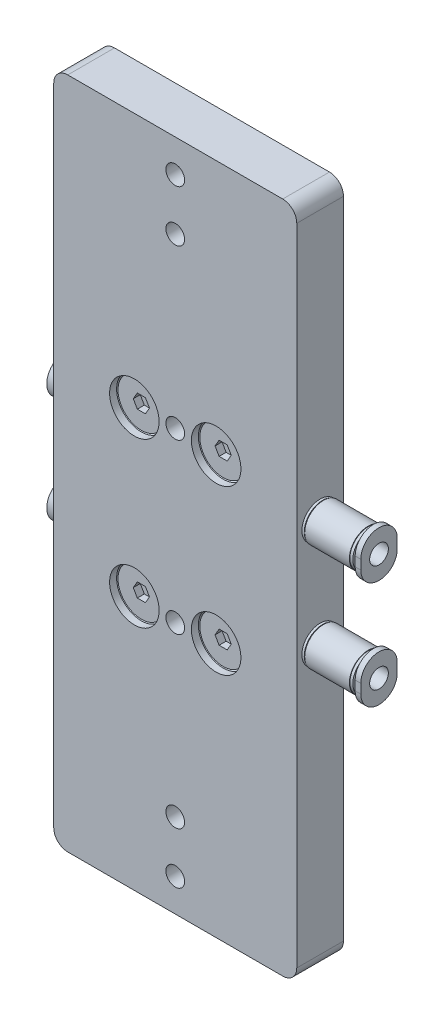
ISO-10303-21;
HEADER;
FILE_DESCRIPTION(('STEP AP214'),'2;1');
FILE_NAME('part.step','',(''),(''),'','','');
FILE_SCHEMA(('AUTOMOTIVE_DESIGN { 1 0 10303 214 1 1 1 1 }'));
ENDSEC;
DATA;
#1=APPLICATION_CONTEXT('core data for automotive mechanical design processes');
#2=APPLICATION_PROTOCOL_DEFINITION('international standard','automotive_design',2000,#1);
#3=PRODUCT_CONTEXT('',#1,'mechanical');
#4=PRODUCT('Part','Part','',(#3));
#5=PRODUCT_RELATED_PRODUCT_CATEGORY('part','',(#4));
#6=PRODUCT_DEFINITION_FORMATION('','',#4);
#7=PRODUCT_DEFINITION_CONTEXT('part definition',#1,'design');
#8=PRODUCT_DEFINITION('design','',#6,#7);
#9=PRODUCT_DEFINITION_SHAPE('','',#8);
#10=(LENGTH_UNIT() NAMED_UNIT(*) SI_UNIT(.MILLI.,.METRE.));
#11=(NAMED_UNIT(*) PLANE_ANGLE_UNIT() SI_UNIT($,.RADIAN.));
#12=(NAMED_UNIT(*) SI_UNIT($,.STERADIAN.) SOLID_ANGLE_UNIT());
#13=UNCERTAINTY_MEASURE_WITH_UNIT(LENGTH_MEASURE(1.E-05),#10,'distance_accuracy_value','');
#14=(GEOMETRIC_REPRESENTATION_CONTEXT(3) GLOBAL_UNCERTAINTY_ASSIGNED_CONTEXT((#13)) GLOBAL_UNIT_ASSIGNED_CONTEXT((#10,
#11,#12)) REPRESENTATION_CONTEXT('',''));
#15=CARTESIAN_POINT('',(0.,0.,0.));
#16=DIRECTION('',(0.,0.,1.));
#17=DIRECTION('',(1.,0.,0.));
#18=AXIS2_PLACEMENT_3D('',#15,#16,#17);
#19=CARTESIAN_POINT('',(-22.5,2.64337269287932,-5.00000000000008));
#20=DIRECTION('',(0.,0.,-1.));
#21=DIRECTION('',(-1.,0.,0.));
#22=AXIS2_PLACEMENT_3D('',#19,#20,#21);
#23=PLANE('',#22);
#24=CARTESIAN_POINT('',(-22.5,3.99999999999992,-5.00000000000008));
#25=DIRECTION('',(0.,0.,-1.));
#26=DIRECTION('',(-1.,0.,0.));
#27=AXIS2_PLACEMENT_3D('',#24,#25,#26);
#28=CIRCLE('',#27,1.5);
#29=CARTESIAN_POINT('',(-24.,3.99999999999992,-5.00000000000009));
#30=VERTEX_POINT('',#29);
#31=EDGE_CURVE('E2311',#30,#30,#28,.T.);
#32=ORIENTED_EDGE('',*,*,#31,.T.);
#33=EDGE_LOOP('',(#32));
#34=FACE_BOUND('',#33,.T.);
#35=ADVANCED_FACE('F19',(#34),#23,.T.);
#36=CARTESIAN_POINT('',(22.5,2.64337269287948,-4.99999999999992));
#37=DIRECTION('',(0.,0.,-1.));
#38=DIRECTION('',(-1.,0.,0.));
#39=AXIS2_PLACEMENT_3D('',#36,#37,#38);
#40=PLANE('',#39);
#41=CARTESIAN_POINT('',(22.5,4.00000000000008,-4.99999999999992));
#42=DIRECTION('',(0.,0.,-1.));
#43=DIRECTION('',(-1.,0.,0.));
#44=AXIS2_PLACEMENT_3D('',#41,#42,#43);
#45=CIRCLE('',#44,1.5);
#46=CARTESIAN_POINT('',(21.,4.00000000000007,-4.99999999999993));
#47=VERTEX_POINT('',#46);
#48=EDGE_CURVE('E547',#47,#47,#45,.T.);
#49=ORIENTED_EDGE('',*,*,#48,.T.);
#50=EDGE_LOOP('',(#49));
#51=FACE_BOUND('',#50,.T.);
#52=ADVANCED_FACE('F966',(#51),#40,.T.);
#53=CARTESIAN_POINT('',(-12.5,0.,0.));
#54=DIRECTION('',(0.,0.,-1.));
#55=DIRECTION('',(-1.,0.,0.));
#56=AXIS2_PLACEMENT_3D('',#53,#54,#55);
#57=PLANE('',#56);
#58=DIRECTION('',(-0.866025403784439,-0.5,0.));
#59=VECTOR('',#58,1.);
#60=CARTESIAN_POINT('',(-12.5,0.866025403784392,0.));
#61=LINE('',#60,#59);
#62=CARTESIAN_POINT('',(-12.5,0.866025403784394,0.));
#63=VERTEX_POINT('',#62);
#64=CARTESIAN_POINT('',(-13.25,0.433012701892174,0.));
#65=VERTEX_POINT('',#64);
#66=EDGE_CURVE('E568',#63,#65,#61,.T.);
#67=ORIENTED_EDGE('',*,*,#66,.T.);
#68=DIRECTION('',(0.,1.,0.));
#69=VECTOR('',#68,1.);
#70=CARTESIAN_POINT('',(-13.25,0.,0.));
#71=LINE('',#70,#69);
#72=CARTESIAN_POINT('',(-13.25,-0.433012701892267,0.));
#73=VERTEX_POINT('',#72);
#74=EDGE_CURVE('E574',#65,#73,#71,.F.);
#75=ORIENTED_EDGE('',*,*,#74,.T.);
#76=DIRECTION('',(0.866025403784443,-0.499999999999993,0.));
#77=VECTOR('',#76,1.);
#78=CARTESIAN_POINT('',(-13.25,-0.433012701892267,0.));
#79=LINE('',#78,#77);
#80=CARTESIAN_POINT('',(-12.5,-0.866025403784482,0.));
#81=VERTEX_POINT('',#80);
#82=EDGE_CURVE('E4178',#73,#81,#79,.T.);
#83=ORIENTED_EDGE('',*,*,#82,.T.);
#84=DIRECTION('',(0.866025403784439,0.5,0.));
#85=VECTOR('',#84,1.);
#86=CARTESIAN_POINT('',(-12.5,-0.86602540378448,0.));
#87=LINE('',#86,#85);
#88=CARTESIAN_POINT('',(-11.75,-0.43301270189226,0.));
#89=VERTEX_POINT('',#88);
#90=EDGE_CURVE('E4193',#81,#89,#87,.T.);
#91=ORIENTED_EDGE('',*,*,#90,.T.);
#92=DIRECTION('',(0.,1.,0.));
#93=VECTOR('',#92,1.);
#94=CARTESIAN_POINT('',(-11.75,0.,0.));
#95=LINE('',#94,#93);
#96=CARTESIAN_POINT('',(-11.75,0.43301270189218,0.));
#97=VERTEX_POINT('',#96);
#98=EDGE_CURVE('E581',#89,#97,#95,.T.);
#99=ORIENTED_EDGE('',*,*,#98,.T.);
#100=DIRECTION('',(-0.866025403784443,0.499999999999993,0.));
#101=VECTOR('',#100,1.);
#102=CARTESIAN_POINT('',(-11.75,0.43301270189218,0.));
#103=LINE('',#102,#101);
#104=EDGE_CURVE('E575',#97,#63,#103,.T.);
#105=ORIENTED_EDGE('',*,*,#104,.T.);
#106=EDGE_LOOP('',(#67,#75,#83,#91,#99,#105));
#107=FACE_BOUND('',#106,.T.);
#108=CARTESIAN_POINT('',(-12.5,0.,0.));
#109=DIRECTION('',(0.,0.,-1.));
#110=DIRECTION('',(-1.,0.,0.));
#111=AXIS2_PLACEMENT_3D('',#108,#109,#110);
#112=CIRCLE('',#111,1.5);
#113=CARTESIAN_POINT('',(-14.,0.,0.));
#114=VERTEX_POINT('',#113);
#115=EDGE_CURVE('E548',#114,#114,#112,.T.);
#116=ORIENTED_EDGE('',*,*,#115,.T.);
#117=EDGE_LOOP('',(#116));
#118=FACE_BOUND('',#117,.T.);
#119=ADVANCED_FACE('F971',(#107,#118),#57,.T.);
#120=CARTESIAN_POINT('',(-12.5,0.,1.49999999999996));
#121=DIRECTION('',(0.,0.,-1.));
#122=DIRECTION('',(-1.,0.,0.));
#123=AXIS2_PLACEMENT_3D('',#120,#121,#122);
#124=PLANE('',#123);
#125=DIRECTION('',(0.,-1.,0.));
#126=VECTOR('',#125,1.);
#127=CARTESIAN_POINT('',(-11.75,-0.433012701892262,1.49999999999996));
#128=LINE('',#127,#126);
#129=CARTESIAN_POINT('',(-11.75,0.43301270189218,1.49999999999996));
#130=VERTEX_POINT('',#129);
#131=CARTESIAN_POINT('',(-11.75,-0.433012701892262,1.49999999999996));
#132=VERTEX_POINT('',#131);
#133=EDGE_CURVE('E4161',#130,#132,#128,.T.);
#134=ORIENTED_EDGE('',*,*,#133,.T.);
#135=DIRECTION('',(-0.866025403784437,-0.5,0.));
#136=VECTOR('',#135,1.);
#137=CARTESIAN_POINT('',(-12.5,-0.86602540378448,1.49999999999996));
#138=LINE('',#137,#136);
#139=CARTESIAN_POINT('',(-12.5,-0.866025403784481,1.49999999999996));
#140=VERTEX_POINT('',#139);
#141=EDGE_CURVE('E4167',#132,#140,#138,.T.);
#142=ORIENTED_EDGE('',*,*,#141,.T.);
#143=DIRECTION('',(-0.86602540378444,0.5,0.));
#144=VECTOR('',#143,1.);
#145=CARTESIAN_POINT('',(-13.25,-0.433012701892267,1.49999999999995));
#146=LINE('',#145,#144);
#147=CARTESIAN_POINT('',(-13.25,-0.433012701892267,1.49999999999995));
#148=VERTEX_POINT('',#147);
#149=EDGE_CURVE('E2079',#140,#148,#146,.T.);
#150=ORIENTED_EDGE('',*,*,#149,.T.);
#151=DIRECTION('',(0.,1.,0.));
#152=VECTOR('',#151,1.);
#153=CARTESIAN_POINT('',(-13.25,0.433012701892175,1.49999999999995));
#154=LINE('',#153,#152);
#155=CARTESIAN_POINT('',(-13.25,0.433012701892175,1.49999999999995));
#156=VERTEX_POINT('',#155);
#157=EDGE_CURVE('E4139',#148,#156,#154,.T.);
#158=ORIENTED_EDGE('',*,*,#157,.T.);
#159=DIRECTION('',(0.866025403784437,0.5,0.));
#160=VECTOR('',#159,1.);
#161=CARTESIAN_POINT('',(-12.5,0.866025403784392,1.49999999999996));
#162=LINE('',#161,#160);
#163=CARTESIAN_POINT('',(-12.5,0.866025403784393,1.49999999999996));
#164=VERTEX_POINT('',#163);
#165=EDGE_CURVE('E4149',#156,#164,#162,.T.);
#166=ORIENTED_EDGE('',*,*,#165,.T.);
#167=DIRECTION('',(0.86602540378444,-0.5,0.));
#168=VECTOR('',#167,1.);
#169=CARTESIAN_POINT('',(-11.75,0.43301270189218,1.49999999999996));
#170=LINE('',#169,#168);
#171=EDGE_CURVE('E4155',#164,#130,#170,.T.);
#172=ORIENTED_EDGE('',*,*,#171,.T.);
#173=EDGE_LOOP('',(#134,#142,#150,#158,#166,#172));
#174=FACE_BOUND('',#173,.T.);
#175=ADVANCED_FACE('F2577',(#174),#124,.T.);
#176=CARTESIAN_POINT('',(-11.75,0.43301270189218,1.49999999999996));
#177=DIRECTION('',(0.5,0.86602540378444,0.));
#178=DIRECTION('',(0.86602540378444,-0.5,0.));
#179=AXIS2_PLACEMENT_3D('',#176,#177,#178);
#180=PLANE('',#179);
#181=DIRECTION('',(0.,0.,-1.));
#182=VECTOR('',#181,1.);
#183=CARTESIAN_POINT('',(-11.75,0.43301270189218,1.49999999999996));
#184=LINE('',#183,#182);
#185=EDGE_CURVE('E4152',#130,#97,#184,.T.);
#186=ORIENTED_EDGE('',*,*,#185,.F.);
#187=ORIENTED_EDGE('',*,*,#171,.F.);
#188=DIRECTION('',(0.,0.,-1.));
#189=VECTOR('',#188,1.);
#190=CARTESIAN_POINT('',(-12.5,0.866025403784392,1.49999999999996));
#191=LINE('',#190,#189);
#192=EDGE_CURVE('E4146',#164,#63,#191,.T.);
#193=ORIENTED_EDGE('',*,*,#192,.T.);
#194=ORIENTED_EDGE('',*,*,#104,.F.);
#195=EDGE_LOOP('',(#186,#187,#193,#194));
#196=FACE_BOUND('',#195,.T.);
#197=ADVANCED_FACE('F2829',(#196),#180,.F.);
#198=CARTESIAN_POINT('',(-11.75,-0.433012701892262,1.49999999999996));
#199=DIRECTION('',(1.,0.,0.));
#200=DIRECTION('',(0.,-1.,0.));
#201=AXIS2_PLACEMENT_3D('',#198,#199,#200);
#202=PLANE('',#201);
#203=DIRECTION('',(0.,0.,-1.));
#204=VECTOR('',#203,1.);
#205=CARTESIAN_POINT('',(-11.75,-0.433012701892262,1.49999999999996));
#206=LINE('',#205,#204);
#207=EDGE_CURVE('E4158',#132,#89,#206,.T.);
#208=ORIENTED_EDGE('',*,*,#207,.F.);
#209=ORIENTED_EDGE('',*,*,#133,.F.);
#210=ORIENTED_EDGE('',*,*,#185,.T.);
#211=ORIENTED_EDGE('',*,*,#98,.F.);
#212=EDGE_LOOP('',(#208,#209,#210,#211));
#213=FACE_BOUND('',#212,.T.);
#214=ADVANCED_FACE('F2928',(#213),#202,.F.);
#215=CARTESIAN_POINT('',(-12.5,-0.86602540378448,1.49999999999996));
#216=DIRECTION('',(0.5,-0.866025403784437,0.));
#217=DIRECTION('',(-0.866025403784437,-0.5,0.));
#218=AXIS2_PLACEMENT_3D('',#215,#216,#217);
#219=PLANE('',#218);
#220=DIRECTION('',(0.,0.,-1.));
#221=VECTOR('',#220,1.);
#222=CARTESIAN_POINT('',(-12.5,-0.86602540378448,1.49999999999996));
#223=LINE('',#222,#221);
#224=EDGE_CURVE('E4164',#140,#81,#223,.T.);
#225=ORIENTED_EDGE('',*,*,#224,.F.);
#226=ORIENTED_EDGE('',*,*,#141,.F.);
#227=ORIENTED_EDGE('',*,*,#207,.T.);
#228=ORIENTED_EDGE('',*,*,#90,.F.);
#229=EDGE_LOOP('',(#225,#226,#227,#228));
#230=FACE_BOUND('',#229,.T.);
#231=ADVANCED_FACE('F2939',(#230),#219,.F.);
#232=CARTESIAN_POINT('',(-13.25,-0.433012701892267,1.49999999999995));
#233=DIRECTION('',(-0.5,-0.86602540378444,0.));
#234=DIRECTION('',(-0.86602540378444,0.5,0.));
#235=AXIS2_PLACEMENT_3D('',#232,#233,#234);
#236=PLANE('',#235);
#237=DIRECTION('',(0.,0.,-1.));
#238=VECTOR('',#237,1.);
#239=CARTESIAN_POINT('',(-13.25,-0.433012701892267,1.49999999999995));
#240=LINE('',#239,#238);
#241=EDGE_CURVE('E4142',#73,#148,#240,.F.);
#242=ORIENTED_EDGE('',*,*,#241,.T.);
#243=ORIENTED_EDGE('',*,*,#149,.F.);
#244=ORIENTED_EDGE('',*,*,#224,.T.);
#245=ORIENTED_EDGE('',*,*,#82,.F.);
#246=EDGE_LOOP('',(#242,#243,#244,#245));
#247=FACE_BOUND('',#246,.T.);
#248=ADVANCED_FACE('F2909',(#247),#236,.F.);
#249=CARTESIAN_POINT('',(-13.25,0.433012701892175,1.49999999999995));
#250=DIRECTION('',(-1.,0.,0.));
#251=DIRECTION('',(0.,1.,0.));
#252=AXIS2_PLACEMENT_3D('',#249,#250,#251);
#253=PLANE('',#252);
#254=DIRECTION('',(0.,0.,-1.));
#255=VECTOR('',#254,1.);
#256=CARTESIAN_POINT('',(-13.25,0.433012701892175,1.49999999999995));
#257=LINE('',#256,#255);
#258=EDGE_CURVE('E4136',#156,#65,#257,.T.);
#259=ORIENTED_EDGE('',*,*,#258,.F.);
#260=ORIENTED_EDGE('',*,*,#157,.F.);
#261=ORIENTED_EDGE('',*,*,#241,.F.);
#262=ORIENTED_EDGE('',*,*,#74,.F.);
#263=EDGE_LOOP('',(#259,#260,#261,#262));
#264=FACE_BOUND('',#263,.T.);
#265=ADVANCED_FACE('F2903',(#264),#253,.F.);
#266=CARTESIAN_POINT('',(-12.5,0.866025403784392,1.49999999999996));
#267=DIRECTION('',(-0.5,0.866025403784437,0.));
#268=DIRECTION('',(0.866025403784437,0.5,0.));
#269=AXIS2_PLACEMENT_3D('',#266,#267,#268);
#270=PLANE('',#269);
#271=ORIENTED_EDGE('',*,*,#192,.F.);
#272=ORIENTED_EDGE('',*,*,#165,.F.);
#273=ORIENTED_EDGE('',*,*,#258,.T.);
#274=ORIENTED_EDGE('',*,*,#66,.F.);
#275=EDGE_LOOP('',(#271,#272,#273,#274));
#276=FACE_BOUND('',#275,.T.);
#277=ADVANCED_FACE('F2603',(#276),#270,.F.);
#278=CARTESIAN_POINT('',(12.5,0.,0.));
#279=DIRECTION('',(0.,0.,-1.));
#280=DIRECTION('',(-1.,0.,0.));
#281=AXIS2_PLACEMENT_3D('',#278,#279,#280);
#282=PLANE('',#281);
#283=DIRECTION('',(0.,1.,0.));
#284=VECTOR('',#283,1.);
#285=CARTESIAN_POINT('',(11.75,0.,0.));
#286=LINE('',#285,#284);
#287=CARTESIAN_POINT('',(11.75,0.433012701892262,0.));
#288=VERTEX_POINT('',#287);
#289=CARTESIAN_POINT('',(11.75,-0.433012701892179,0.));
#290=VERTEX_POINT('',#289);
#291=EDGE_CURVE('E4223',#288,#290,#286,.F.);
#292=ORIENTED_EDGE('',*,*,#291,.T.);
#293=DIRECTION('',(0.866025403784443,-0.499999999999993,0.));
#294=VECTOR('',#293,1.);
#295=CARTESIAN_POINT('',(11.75,-0.43301270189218,0.));
#296=LINE('',#295,#294);
#297=CARTESIAN_POINT('',(12.5,-0.866025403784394,0.));
#298=VERTEX_POINT('',#297);
#299=EDGE_CURVE('E2073',#290,#298,#296,.T.);
#300=ORIENTED_EDGE('',*,*,#299,.T.);
#301=DIRECTION('',(0.866025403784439,0.5,0.));
#302=VECTOR('',#301,1.);
#303=CARTESIAN_POINT('',(12.5,-0.866025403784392,0.));
#304=LINE('',#303,#302);
#305=CARTESIAN_POINT('',(13.25,-0.433012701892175,0.));
#306=VERTEX_POINT('',#305);
#307=EDGE_CURVE('E4209',#298,#306,#304,.T.);
#308=ORIENTED_EDGE('',*,*,#307,.T.);
#309=DIRECTION('',(0.,1.,0.));
#310=VECTOR('',#309,1.);
#311=CARTESIAN_POINT('',(13.25,0.,0.));
#312=LINE('',#311,#310);
#313=CARTESIAN_POINT('',(13.25,0.433012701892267,0.));
#314=VERTEX_POINT('',#313);
#315=EDGE_CURVE('E4212',#306,#314,#312,.T.);
#316=ORIENTED_EDGE('',*,*,#315,.T.);
#317=DIRECTION('',(-0.866025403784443,0.499999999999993,0.));
#318=VECTOR('',#317,1.);
#319=CARTESIAN_POINT('',(13.25,0.433012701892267,0.));
#320=LINE('',#319,#318);
#321=CARTESIAN_POINT('',(12.5,0.866025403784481,0.));
#322=VERTEX_POINT('',#321);
#323=EDGE_CURVE('E4215',#314,#322,#320,.T.);
#324=ORIENTED_EDGE('',*,*,#323,.T.);
#325=DIRECTION('',(-0.866025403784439,-0.5,0.));
#326=VECTOR('',#325,1.);
#327=CARTESIAN_POINT('',(12.5,0.86602540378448,0.));
#328=LINE('',#327,#326);
#329=EDGE_CURVE('E4219',#322,#288,#328,.T.);
#330=ORIENTED_EDGE('',*,*,#329,.T.);
#331=EDGE_LOOP('',(#292,#300,#308,#316,#324,#330));
#332=FACE_BOUND('',#331,.T.);
#333=CARTESIAN_POINT('',(12.5,0.,0.));
#334=DIRECTION('',(0.,0.,-1.));
#335=DIRECTION('',(-1.,0.,0.));
#336=AXIS2_PLACEMENT_3D('',#333,#334,#335);
#337=CIRCLE('',#336,1.5);
#338=CARTESIAN_POINT('',(11.,0.,0.));
#339=VERTEX_POINT('',#338);
#340=EDGE_CURVE('E590',#339,#339,#337,.T.);
#341=ORIENTED_EDGE('',*,*,#340,.T.);
#342=EDGE_LOOP('',(#341));
#343=FACE_BOUND('',#342,.T.);
#344=ADVANCED_FACE('F2596',(#332,#343),#282,.T.);
#345=CARTESIAN_POINT('',(12.5,0.,1.50000000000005));
#346=DIRECTION('',(0.,0.,-1.));
#347=DIRECTION('',(-1.,0.,0.));
#348=AXIS2_PLACEMENT_3D('',#345,#346,#347);
#349=PLANE('',#348);
#350=DIRECTION('',(0.866025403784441,-0.5,0.));
#351=VECTOR('',#350,1.);
#352=CARTESIAN_POINT('',(12.5,0.86602540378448,1.50000000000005));
#353=LINE('',#352,#351);
#354=CARTESIAN_POINT('',(12.5,0.866025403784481,1.50000000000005));
#355=VERTEX_POINT('',#354);
#356=CARTESIAN_POINT('',(13.25,0.433012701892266,1.50000000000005));
#357=VERTEX_POINT('',#356);
#358=EDGE_CURVE('E4124',#355,#357,#353,.T.);
#359=ORIENTED_EDGE('',*,*,#358,.T.);
#360=DIRECTION('',(0.,-1.,0.));
#361=VECTOR('',#360,1.);
#362=CARTESIAN_POINT('',(13.25,0.433012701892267,1.50000000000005));
#363=LINE('',#362,#361);
#364=CARTESIAN_POINT('',(13.25,-0.433012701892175,1.50000000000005));
#365=VERTEX_POINT('',#364);
#366=EDGE_CURVE('E4130',#357,#365,#363,.T.);
#367=ORIENTED_EDGE('',*,*,#366,.T.);
#368=DIRECTION('',(-0.866025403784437,-0.5,0.));
#369=VECTOR('',#368,1.);
#370=CARTESIAN_POINT('',(13.25,-0.433012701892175,1.50000000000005));
#371=LINE('',#370,#369);
#372=CARTESIAN_POINT('',(12.5,-0.866025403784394,1.50000000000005));
#373=VERTEX_POINT('',#372);
#374=EDGE_CURVE('E4133',#365,#373,#371,.T.);
#375=ORIENTED_EDGE('',*,*,#374,.T.);
#376=DIRECTION('',(-0.86602540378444,0.5,0.));
#377=VECTOR('',#376,1.);
#378=CARTESIAN_POINT('',(12.5,-0.866025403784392,1.50000000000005));
#379=LINE('',#378,#377);
#380=CARTESIAN_POINT('',(11.75,-0.433012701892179,1.50000000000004));
#381=VERTEX_POINT('',#380);
#382=EDGE_CURVE('E4104',#373,#381,#379,.T.);
#383=ORIENTED_EDGE('',*,*,#382,.T.);
#384=DIRECTION('',(0.,1.,0.));
#385=VECTOR('',#384,1.);
#386=CARTESIAN_POINT('',(11.75,-0.43301270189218,1.50000000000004));
#387=LINE('',#386,#385);
#388=CARTESIAN_POINT('',(11.75,0.433012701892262,1.50000000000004));
#389=VERTEX_POINT('',#388);
#390=EDGE_CURVE('E4112',#381,#389,#387,.T.);
#391=ORIENTED_EDGE('',*,*,#390,.T.);
#392=DIRECTION('',(0.866025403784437,0.5,0.));
#393=VECTOR('',#392,1.);
#394=CARTESIAN_POINT('',(11.75,0.433012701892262,1.50000000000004));
#395=LINE('',#394,#393);
#396=EDGE_CURVE('E4118',#389,#355,#395,.T.);
#397=ORIENTED_EDGE('',*,*,#396,.T.);
#398=EDGE_LOOP('',(#359,#367,#375,#383,#391,#397));
#399=FACE_BOUND('',#398,.T.);
#400=ADVANCED_FACE('F2602',(#399),#349,.T.);
#401=CARTESIAN_POINT('',(11.75,0.433012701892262,1.50000000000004));
#402=DIRECTION('',(-0.5,0.866025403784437,0.));
#403=DIRECTION('',(0.866025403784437,0.5,0.));
#404=AXIS2_PLACEMENT_3D('',#401,#402,#403);
#405=PLANE('',#404);
#406=DIRECTION('',(0.,0.,-1.));
#407=VECTOR('',#406,1.);
#408=CARTESIAN_POINT('',(12.5,0.866025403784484,1.50000000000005));
#409=LINE('',#408,#407);
#410=EDGE_CURVE('E4115',#355,#322,#409,.T.);
#411=ORIENTED_EDGE('',*,*,#410,.F.);
#412=ORIENTED_EDGE('',*,*,#396,.F.);
#413=DIRECTION('',(0.,0.,-1.));
#414=VECTOR('',#413,1.);
#415=CARTESIAN_POINT('',(11.75,0.433012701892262,1.50000000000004));
#416=LINE('',#415,#414);
#417=EDGE_CURVE('E4109',#389,#288,#416,.T.);
#418=ORIENTED_EDGE('',*,*,#417,.T.);
#419=ORIENTED_EDGE('',*,*,#329,.F.);
#420=EDGE_LOOP('',(#411,#412,#418,#419));
#421=FACE_BOUND('',#420,.T.);
#422=ADVANCED_FACE('F2840',(#421),#405,.F.);
#423=CARTESIAN_POINT('',(12.5,0.86602540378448,1.50000000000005));
#424=DIRECTION('',(0.5,0.866025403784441,0.));
#425=DIRECTION('',(0.866025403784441,-0.5,0.));
#426=AXIS2_PLACEMENT_3D('',#423,#424,#425);
#427=PLANE('',#426);
#428=DIRECTION('',(0.,0.,-1.));
#429=VECTOR('',#428,1.);
#430=CARTESIAN_POINT('',(13.25,0.433012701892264,1.50000000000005));
#431=LINE('',#430,#429);
#432=EDGE_CURVE('E4121',#357,#314,#431,.T.);
#433=ORIENTED_EDGE('',*,*,#432,.F.);
#434=ORIENTED_EDGE('',*,*,#358,.F.);
#435=ORIENTED_EDGE('',*,*,#410,.T.);
#436=ORIENTED_EDGE('',*,*,#323,.F.);
#437=EDGE_LOOP('',(#433,#434,#435,#436));
#438=FACE_BOUND('',#437,.T.);
#439=ADVANCED_FACE('F2850',(#438),#427,.F.);
#440=CARTESIAN_POINT('',(13.25,0.433012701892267,1.50000000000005));
#441=DIRECTION('',(1.,0.,0.));
#442=DIRECTION('',(0.,-1.,0.));
#443=AXIS2_PLACEMENT_3D('',#440,#441,#442);
#444=PLANE('',#443);
#445=DIRECTION('',(0.,0.,-1.));
#446=VECTOR('',#445,1.);
#447=CARTESIAN_POINT('',(13.25,-0.433012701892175,1.50000000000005));
#448=LINE('',#447,#446);
#449=EDGE_CURVE('E4127',#365,#306,#448,.T.);
#450=ORIENTED_EDGE('',*,*,#449,.F.);
#451=ORIENTED_EDGE('',*,*,#366,.F.);
#452=ORIENTED_EDGE('',*,*,#432,.T.);
#453=ORIENTED_EDGE('',*,*,#315,.F.);
#454=EDGE_LOOP('',(#450,#451,#452,#453));
#455=FACE_BOUND('',#454,.T.);
#456=ADVANCED_FACE('F2879',(#455),#444,.F.);
#457=CARTESIAN_POINT('',(13.25,-0.433012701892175,1.50000000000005));
#458=DIRECTION('',(0.5,-0.866025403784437,0.));
#459=DIRECTION('',(-0.866025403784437,-0.5,0.));
#460=AXIS2_PLACEMENT_3D('',#457,#458,#459);
#461=PLANE('',#460);
#462=DIRECTION('',(0.,0.,-1.));
#463=VECTOR('',#462,1.);
#464=CARTESIAN_POINT('',(12.5,-0.866025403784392,1.50000000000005));
#465=LINE('',#464,#463);
#466=EDGE_CURVE('E4106',#298,#373,#465,.F.);
#467=ORIENTED_EDGE('',*,*,#466,.T.);
#468=ORIENTED_EDGE('',*,*,#374,.F.);
#469=ORIENTED_EDGE('',*,*,#449,.T.);
#470=ORIENTED_EDGE('',*,*,#307,.F.);
#471=EDGE_LOOP('',(#467,#468,#469,#470));
#472=FACE_BOUND('',#471,.T.);
#473=ADVANCED_FACE('F2868',(#472),#461,.F.);
#474=CARTESIAN_POINT('',(12.5,-0.866025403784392,1.50000000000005));
#475=DIRECTION('',(-0.5,-0.86602540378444,0.));
#476=DIRECTION('',(-0.86602540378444,0.5,0.));
#477=AXIS2_PLACEMENT_3D('',#474,#475,#476);
#478=PLANE('',#477);
#479=DIRECTION('',(0.,0.,-1.));
#480=VECTOR('',#479,1.);
#481=CARTESIAN_POINT('',(11.75,-0.433012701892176,1.50000000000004));
#482=LINE('',#481,#480);
#483=EDGE_CURVE('E1524',#381,#290,#482,.T.);
#484=ORIENTED_EDGE('',*,*,#483,.F.);
#485=ORIENTED_EDGE('',*,*,#382,.F.);
#486=ORIENTED_EDGE('',*,*,#466,.F.);
#487=ORIENTED_EDGE('',*,*,#299,.F.);
#488=EDGE_LOOP('',(#484,#485,#486,#487));
#489=FACE_BOUND('',#488,.T.);
#490=ADVANCED_FACE('F960',(#489),#478,.F.);
#491=CARTESIAN_POINT('',(11.75,-0.43301270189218,1.50000000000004));
#492=DIRECTION('',(-1.,0.,0.));
#493=DIRECTION('',(0.,1.,0.));
#494=AXIS2_PLACEMENT_3D('',#491,#492,#493);
#495=PLANE('',#494);
#496=ORIENTED_EDGE('',*,*,#417,.F.);
#497=ORIENTED_EDGE('',*,*,#390,.F.);
#498=ORIENTED_EDGE('',*,*,#483,.T.);
#499=ORIENTED_EDGE('',*,*,#291,.F.);
#500=EDGE_LOOP('',(#496,#497,#498,#499));
#501=FACE_BOUND('',#500,.T.);
#502=ADVANCED_FACE('F951',(#501),#495,.F.);
#503=CARTESIAN_POINT('',(-28.5,11.5,3.4999999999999));
#504=DIRECTION('',(1.,0.,0.));
#505=DIRECTION('',(0.,0.,-1.));
#506=AXIS2_PLACEMENT_3D('',#503,#504,#505);
#507=PLANE('',#506);
#508=CARTESIAN_POINT('',(-28.5,11.5,4.9999999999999));
#509=DIRECTION('',(1.,0.,0.));
#510=DIRECTION('',(0.,0.,-1.));
#511=AXIS2_PLACEMENT_3D('',#508,#509,#510);
#512=CIRCLE('',#511,4.);
#513=CARTESIAN_POINT('',(-28.5,11.5,0.9999999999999));
#514=VERTEX_POINT('',#513);
#515=EDGE_CURVE('E621',#514,#514,#512,.T.);
#516=ORIENTED_EDGE('',*,*,#515,.F.);
#517=EDGE_LOOP('',(#516));
#518=FACE_BOUND('',#517,.T.);
#519=DIRECTION('',(0.,0.866025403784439,-0.5));
#520=VECTOR('',#519,1.);
#521=CARTESIAN_POINT('',(-28.5,11.5245190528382,3.54246824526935));
#522=LINE('',#521,#520);
#523=CARTESIAN_POINT('',(-28.5,10.25,4.27831216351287));
#524=VERTEX_POINT('',#523);
#525=CARTESIAN_POINT('',(-28.5,11.5,3.55662432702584));
#526=VERTEX_POINT('',#525);
#527=EDGE_CURVE('E599',#524,#526,#522,.T.);
#528=ORIENTED_EDGE('',*,*,#527,.T.);
#529=DIRECTION('',(0.,0.866025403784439,0.5));
#530=VECTOR('',#529,1.);
#531=CARTESIAN_POINT('',(-28.5,11.4754809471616,3.54246824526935));
#532=LINE('',#531,#530);
#533=CARTESIAN_POINT('',(-28.5,12.75,4.27831216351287));
#534=VERTEX_POINT('',#533);
#535=EDGE_CURVE('E595',#526,#534,#532,.T.);
#536=ORIENTED_EDGE('',*,*,#535,.T.);
#537=DIRECTION('',(0.,0.,1.));
#538=VECTOR('',#537,1.);
#539=CARTESIAN_POINT('',(-28.5,12.75,3.4999999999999));
#540=LINE('',#539,#538);
#541=CARTESIAN_POINT('',(-28.5,12.75,5.72168783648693));
#542=VERTEX_POINT('',#541);
#543=EDGE_CURVE('E647',#534,#542,#540,.T.);
#544=ORIENTED_EDGE('',*,*,#543,.T.);
#545=DIRECTION('',(0.,-0.866025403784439,0.5));
#546=VECTOR('',#545,1.);
#547=CARTESIAN_POINT('',(-28.5,12.7745190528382,5.70753175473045));
#548=LINE('',#547,#546);
#549=CARTESIAN_POINT('',(-28.5,11.5,6.44337567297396));
#550=VERTEX_POINT('',#549);
#551=EDGE_CURVE('E651',#542,#550,#548,.T.);
#552=ORIENTED_EDGE('',*,*,#551,.T.);
#553=DIRECTION('',(0.,-0.866025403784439,-0.5));
#554=VECTOR('',#553,1.);
#555=CARTESIAN_POINT('',(-28.5,10.2254809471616,5.70753175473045));
#556=LINE('',#555,#554);
#557=CARTESIAN_POINT('',(-28.5,10.25,5.72168783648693));
#558=VERTEX_POINT('',#557);
#559=EDGE_CURVE('E654',#550,#558,#556,.T.);
#560=ORIENTED_EDGE('',*,*,#559,.T.);
#561=DIRECTION('',(0.,0.,-1.));
#562=VECTOR('',#561,1.);
#563=CARTESIAN_POINT('',(-28.5,10.25,3.4999999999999));
#564=LINE('',#563,#562);
#565=EDGE_CURVE('E604',#558,#524,#564,.T.);
#566=ORIENTED_EDGE('',*,*,#565,.T.);
#567=EDGE_LOOP('',(#528,#536,#544,#552,#560,#566));
#568=FACE_BOUND('',#567,.T.);
#569=ADVANCED_FACE('F663',(#518,#568),#507,.F.);
#570=CARTESIAN_POINT('',(-28.5,-11.5,3.4999999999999));
#571=DIRECTION('',(1.,0.,0.));
#572=DIRECTION('',(0.,0.,-1.));
#573=AXIS2_PLACEMENT_3D('',#570,#571,#572);
#574=PLANE('',#573);
#575=CARTESIAN_POINT('',(-28.5,-11.5,4.9999999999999));
#576=DIRECTION('',(1.,0.,0.));
#577=DIRECTION('',(0.,0.,-1.));
#578=AXIS2_PLACEMENT_3D('',#575,#576,#577);
#579=CIRCLE('',#578,4.);
#580=CARTESIAN_POINT('',(-28.5,-11.5,0.9999999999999));
#581=VERTEX_POINT('',#580);
#582=EDGE_CURVE('E615',#581,#581,#579,.T.);
#583=ORIENTED_EDGE('',*,*,#582,.F.);
#584=EDGE_LOOP('',(#583));
#585=FACE_BOUND('',#584,.T.);
#586=DIRECTION('',(0.,-0.866025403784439,0.5));
#587=VECTOR('',#586,1.);
#588=CARTESIAN_POINT('',(-28.5,-10.2254809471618,5.70753175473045));
#589=LINE('',#588,#587);
#590=CARTESIAN_POINT('',(-28.5,-10.25,5.72168783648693));
#591=VERTEX_POINT('',#590);
#592=CARTESIAN_POINT('',(-28.5,-11.5,6.44337567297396));
#593=VERTEX_POINT('',#592);
#594=EDGE_CURVE('E638',#591,#593,#589,.T.);
#595=ORIENTED_EDGE('',*,*,#594,.T.);
#596=DIRECTION('',(0.,-0.866025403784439,-0.5));
#597=VECTOR('',#596,1.);
#598=CARTESIAN_POINT('',(-28.5,-12.7745190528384,5.70753175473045));
#599=LINE('',#598,#597);
#600=CARTESIAN_POINT('',(-28.5,-12.75,5.72168783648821));
#601=VERTEX_POINT('',#600);
#602=EDGE_CURVE('E643',#593,#601,#599,.T.);
#603=ORIENTED_EDGE('',*,*,#602,.T.);
#604=DIRECTION('',(0.,0.,-1.));
#605=VECTOR('',#604,1.);
#606=CARTESIAN_POINT('',(-28.5,-12.75,3.4999999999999));
#607=LINE('',#606,#605);
#608=CARTESIAN_POINT('',(-28.5,-12.75,4.27831216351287));
#609=VERTEX_POINT('',#608);
#610=EDGE_CURVE('E620',#601,#609,#607,.T.);
#611=ORIENTED_EDGE('',*,*,#610,.T.);
#612=DIRECTION('',(0.,0.866025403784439,-0.5));
#613=VECTOR('',#612,1.);
#614=CARTESIAN_POINT('',(-28.5,-11.4754809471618,3.54246824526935));
#615=LINE('',#614,#613);
#616=CARTESIAN_POINT('',(-28.5,-11.4999999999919,3.55662432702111));
#617=VERTEX_POINT('',#616);
#618=EDGE_CURVE('E627',#609,#617,#615,.T.);
#619=ORIENTED_EDGE('',*,*,#618,.T.);
#620=DIRECTION('',(0.,0.866025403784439,0.5));
#621=VECTOR('',#620,1.);
#622=CARTESIAN_POINT('',(-28.5,-11.5245190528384,3.54246824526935));
#623=LINE('',#622,#621);
#624=CARTESIAN_POINT('',(-28.5,-10.25,4.27831216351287));
#625=VERTEX_POINT('',#624);
#626=EDGE_CURVE('E631',#617,#625,#623,.T.);
#627=ORIENTED_EDGE('',*,*,#626,.T.);
#628=DIRECTION('',(0.,0.,1.));
#629=VECTOR('',#628,1.);
#630=CARTESIAN_POINT('',(-28.5,-10.25,3.4999999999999));
#631=LINE('',#630,#629);
#632=EDGE_CURVE('E635',#625,#591,#631,.T.);
#633=ORIENTED_EDGE('',*,*,#632,.T.);
#634=EDGE_LOOP('',(#595,#603,#611,#619,#627,#633));
#635=FACE_BOUND('',#634,.T.);
#636=ADVANCED_FACE('F950',(#585,#635),#574,.F.);
#637=CARTESIAN_POINT('',(-22.2,-11.5,4.99999999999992));
#638=DIRECTION('',(1.,0.,0.));
#639=DIRECTION('',(0.,0.,-1.));
#640=AXIS2_PLACEMENT_3D('',#637,#638,#639);
#641=CYLINDRICAL_SURFACE('',#640,4.);
#642=CARTESIAN_POINT('',(-26.8333333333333,-11.5,4.99999999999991));
#643=DIRECTION('',(1.,0.,0.));
#644=DIRECTION('',(0.,0.,-1.));
#645=AXIS2_PLACEMENT_3D('',#642,#643,#644);
#646=CIRCLE('',#645,4.);
#647=CARTESIAN_POINT('',(-26.8333333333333,-11.5,0.99999999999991));
#648=VERTEX_POINT('',#647);
#649=EDGE_CURVE('E1511',#648,#648,#646,.F.);
#650=ORIENTED_EDGE('',*,*,#649,.T.);
#651=EDGE_LOOP('',(#650));
#652=FACE_BOUND('',#651,.T.);
#653=ORIENTED_EDGE('',*,*,#582,.T.);
#654=EDGE_LOOP('',(#653));
#655=FACE_BOUND('',#654,.T.);
#656=ADVANCED_FACE('F957',(#652,#655),#641,.T.);
#657=CARTESIAN_POINT('',(-22.2,11.5,4.99999999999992));
#658=DIRECTION('',(1.,0.,0.));
#659=DIRECTION('',(0.,0.,-1.));
#660=AXIS2_PLACEMENT_3D('',#657,#658,#659);
#661=CYLINDRICAL_SURFACE('',#660,4.);
#662=CARTESIAN_POINT('',(-26.8333333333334,11.5,4.99999999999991));
#663=DIRECTION('',(1.,0.,0.));
#664=DIRECTION('',(0.,0.,-1.));
#665=AXIS2_PLACEMENT_3D('',#662,#663,#664);
#666=CIRCLE('',#665,4.);
#667=CARTESIAN_POINT('',(-26.8333333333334,11.5,0.99999999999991));
#668=VERTEX_POINT('',#667);
#669=EDGE_CURVE('E1519',#668,#668,#666,.F.);
#670=ORIENTED_EDGE('',*,*,#669,.T.);
#671=EDGE_LOOP('',(#670));
#672=FACE_BOUND('',#671,.T.);
#673=ORIENTED_EDGE('',*,*,#515,.T.);
#674=EDGE_LOOP('',(#673));
#675=FACE_BOUND('',#674,.T.);
#676=ADVANCED_FACE('F947',(#672,#675),#661,.T.);
#677=CARTESIAN_POINT('',(36.8,11.5000000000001,5.00000000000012));
#678=DIRECTION('',(1.,0.,0.));
#679=DIRECTION('',(0.,-1.,0.));
#680=AXIS2_PLACEMENT_3D('',#677,#678,#679);
#681=CYLINDRICAL_SURFACE('',#680,2.6);
#682=CARTESIAN_POINT('',(37.4,11.5000000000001,5.00000000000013));
#683=DIRECTION('',(-1.,0.,0.));
#684=DIRECTION('',(0.,1.,0.));
#685=AXIS2_PLACEMENT_3D('',#682,#683,#684);
#686=CIRCLE('',#685,2.6);
#687=CARTESIAN_POINT('',(37.4,14.1000000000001,5.00000000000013));
#688=VERTEX_POINT('',#687);
#689=EDGE_CURVE('E2317',#688,#688,#686,.F.);
#690=ORIENTED_EDGE('',*,*,#689,.F.);
#691=EDGE_LOOP('',(#690));
#692=FACE_BOUND('',#691,.T.);
#693=CARTESIAN_POINT('',(36.8,11.5000000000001,5.00000000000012));
#694=DIRECTION('',(1.,0.,0.));
#695=DIRECTION('',(0.,-1.,0.));
#696=AXIS2_PLACEMENT_3D('',#693,#694,#695);
#697=CIRCLE('',#696,2.6);
#698=CARTESIAN_POINT('',(36.8,8.90000000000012,5.00000000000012));
#699=VERTEX_POINT('',#698);
#700=EDGE_CURVE('E2156',#699,#699,#697,.F.);
#701=ORIENTED_EDGE('',*,*,#700,.F.);
#702=EDGE_LOOP('',(#701));
#703=FACE_BOUND('',#702,.T.);
#704=ADVANCED_FACE('F2335',(#692,#703),#681,.T.);
#705=CARTESIAN_POINT('',(36.8,-11.4999999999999,5.00000000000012));
#706=DIRECTION('',(1.,0.,0.));
#707=DIRECTION('',(0.,-1.,0.));
#708=AXIS2_PLACEMENT_3D('',#705,#706,#707);
#709=CYLINDRICAL_SURFACE('',#708,2.6);
#710=CARTESIAN_POINT('',(37.4,-11.4999999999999,5.00000000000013));
#711=DIRECTION('',(-1.,0.,0.));
#712=DIRECTION('',(0.,1.,0.));
#713=AXIS2_PLACEMENT_3D('',#710,#711,#712);
#714=CIRCLE('',#713,2.6);
#715=CARTESIAN_POINT('',(37.4,-8.89999999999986,5.00000000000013));
#716=VERTEX_POINT('',#715);
#717=EDGE_CURVE('E2321',#716,#716,#714,.F.);
#718=ORIENTED_EDGE('',*,*,#717,.F.);
#719=EDGE_LOOP('',(#718));
#720=FACE_BOUND('',#719,.T.);
#721=CARTESIAN_POINT('',(36.8,-11.4999999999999,5.00000000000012));
#722=DIRECTION('',(1.,0.,0.));
#723=DIRECTION('',(0.,-1.,0.));
#724=AXIS2_PLACEMENT_3D('',#721,#722,#723);
#725=CIRCLE('',#724,2.6);
#726=CARTESIAN_POINT('',(36.8,-14.0999999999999,5.00000000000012));
#727=VERTEX_POINT('',#726);
#728=EDGE_CURVE('E2339',#727,#727,#725,.F.);
#729=ORIENTED_EDGE('',*,*,#728,.F.);
#730=EDGE_LOOP('',(#729));
#731=FACE_BOUND('',#730,.T.);
#732=ADVANCED_FACE('F2331',(#720,#731),#709,.T.);
#733=CARTESIAN_POINT('',(0.,-12.5,0.));
#734=DIRECTION('',(0.,0.,-1.));
#735=DIRECTION('',(-1.,0.,0.));
#736=AXIS2_PLACEMENT_3D('',#733,#734,#735);
#737=CYLINDRICAL_SURFACE('',#736,1.5);
#738=CARTESIAN_POINT('',(0.,-12.5,0.7));
#739=DIRECTION('',(0.,0.,-1.));
#740=DIRECTION('',(-1.,0.,0.));
#741=AXIS2_PLACEMENT_3D('',#738,#739,#740);
#742=CIRCLE('',#741,1.5);
#743=CARTESIAN_POINT('',(-1.49999999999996,-12.5,0.699999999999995));
#744=VERTEX_POINT('',#743);
#745=EDGE_CURVE('E2342',#744,#744,#742,.F.);
#746=ORIENTED_EDGE('',*,*,#745,.F.);
#747=EDGE_LOOP('',(#746));
#748=FACE_BOUND('',#747,.T.);
#749=CARTESIAN_POINT('',(0.,-12.5,7.5));
#750=DIRECTION('',(0.,0.,-1.));
#751=DIRECTION('',(-1.,0.,0.));
#752=AXIS2_PLACEMENT_3D('',#749,#750,#751);
#753=CIRCLE('',#752,1.5);
#754=CARTESIAN_POINT('',(-1.49999999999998,-12.5,7.49999999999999));
#755=VERTEX_POINT('',#754);
#756=EDGE_CURVE('E2157',#755,#755,#753,.T.);
#757=ORIENTED_EDGE('',*,*,#756,.F.);
#758=EDGE_LOOP('',(#757));
#759=FACE_BOUND('',#758,.T.);
#760=ADVANCED_FACE('F2334',(#748,#759),#737,.F.);
#761=CARTESIAN_POINT('',(0.,12.5,0.));
#762=DIRECTION('',(0.,0.,-1.));
#763=DIRECTION('',(-1.,0.,0.));
#764=AXIS2_PLACEMENT_3D('',#761,#762,#763);
#765=CYLINDRICAL_SURFACE('',#764,1.5);
#766=CARTESIAN_POINT('',(0.,12.5,0.7));
#767=DIRECTION('',(0.,0.,-1.));
#768=DIRECTION('',(-1.,0.,0.));
#769=AXIS2_PLACEMENT_3D('',#766,#767,#768);
#770=CIRCLE('',#769,1.5);
#771=CARTESIAN_POINT('',(-1.50000000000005,12.5,0.699999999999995));
#772=VERTEX_POINT('',#771);
#773=EDGE_CURVE('E2346',#772,#772,#770,.F.);
#774=ORIENTED_EDGE('',*,*,#773,.F.);
#775=EDGE_LOOP('',(#774));
#776=FACE_BOUND('',#775,.T.);
#777=CARTESIAN_POINT('',(0.,12.5,7.5));
#778=DIRECTION('',(0.,0.,-1.));
#779=DIRECTION('',(-1.,0.,0.));
#780=AXIS2_PLACEMENT_3D('',#777,#778,#779);
#781=CIRCLE('',#780,1.5);
#782=CARTESIAN_POINT('',(-1.50000000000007,12.5,7.49999999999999));
#783=VERTEX_POINT('',#782);
#784=EDGE_CURVE('E2147',#783,#783,#781,.T.);
#785=ORIENTED_EDGE('',*,*,#784,.F.);
#786=EDGE_LOOP('',(#785));
#787=FACE_BOUND('',#786,.T.);
#788=ADVANCED_FACE('F2363',(#776,#787),#765,.F.);
#789=CARTESIAN_POINT('',(36.8,13.8249197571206,10.6191412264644));
#790=DIRECTION('',(1.,0.,0.));
#791=DIRECTION('',(0.,-1.,0.));
#792=AXIS2_PLACEMENT_3D('',#789,#790,#791);
#793=PLANE('',#792);
#794=CARTESIAN_POINT('',(36.8000000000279,11.5000000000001,5.00000000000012));
#795=DIRECTION('',(-1.,0.,0.));
#796=DIRECTION('',(0.,1.,0.));
#797=AXIS2_PLACEMENT_3D('',#794,#795,#796);
#798=CIRCLE('',#797,3.80000000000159);
#799=CARTESIAN_POINT('',(36.8000000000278,15.3000000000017,5.00000000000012));
#800=VERTEX_POINT('',#799);
#801=EDGE_CURVE('E2080',#800,#800,#798,.T.);
#802=ORIENTED_EDGE('',*,*,#801,.F.);
#803=EDGE_LOOP('',(#802));
#804=FACE_BOUND('',#803,.T.);
#805=ORIENTED_EDGE('',*,*,#700,.T.);
#806=EDGE_LOOP('',(#805));
#807=FACE_BOUND('',#806,.T.);
#808=ADVANCED_FACE('F2359',(#804,#807),#793,.T.);
#809=CARTESIAN_POINT('',(36.8,-13.8249197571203,10.6191412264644));
#810=DIRECTION('',(1.,0.,0.));
#811=DIRECTION('',(0.,-1.,0.));
#812=AXIS2_PLACEMENT_3D('',#809,#810,#811);
#813=PLANE('',#812);
#814=CARTESIAN_POINT('',(36.8000000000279,-11.4999999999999,5.00000000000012));
#815=DIRECTION('',(-1.,0.,0.));
#816=DIRECTION('',(0.,1.,0.));
#817=AXIS2_PLACEMENT_3D('',#814,#815,#816);
#818=CIRCLE('',#817,3.80000000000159);
#819=CARTESIAN_POINT('',(36.8000000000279,-7.69999999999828,5.00000000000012));
#820=VERTEX_POINT('',#819);
#821=EDGE_CURVE('E2074',#820,#820,#818,.T.);
#822=ORIENTED_EDGE('',*,*,#821,.F.);
#823=EDGE_LOOP('',(#822));
#824=FACE_BOUND('',#823,.T.);
#825=ORIENTED_EDGE('',*,*,#728,.T.);
#826=EDGE_LOOP('',(#825));
#827=FACE_BOUND('',#826,.T.);
#828=ADVANCED_FACE('F2362',(#824,#827),#813,.T.);
#829=CARTESIAN_POINT('',(0.,-12.5,0.7));
#830=DIRECTION('',(0.,0.,-1.));
#831=DIRECTION('',(-1.,0.,0.));
#832=AXIS2_PLACEMENT_3D('',#829,#830,#831);
#833=PLANE('',#832);
#834=CARTESIAN_POINT('',(0.,-12.5,0.7));
#835=DIRECTION('',(0.,0.,1.));
#836=DIRECTION('',(-1.,0.,0.));
#837=AXIS2_PLACEMENT_3D('',#834,#835,#836);
#838=CIRCLE('',#837,1.89999999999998);
#839=CARTESIAN_POINT('',(-1.89999999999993,-12.5,0.7));
#840=VERTEX_POINT('',#839);
#841=CARTESIAN_POINT('',(1.90000000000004,-12.5,0.7));
#842=VERTEX_POINT('',#841);
#843=EDGE_CURVE('E2133',#840,#842,#838,.T.);
#844=ORIENTED_EDGE('',*,*,#843,.F.);
#845=CARTESIAN_POINT('',(0.,-12.5,0.7));
#846=DIRECTION('',(0.,0.,1.));
#847=DIRECTION('',(1.,0.,0.));
#848=AXIS2_PLACEMENT_3D('',#845,#846,#847);
#849=CIRCLE('',#848,1.89999999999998);
#850=EDGE_CURVE('E2143',#842,#840,#849,.T.);
#851=ORIENTED_EDGE('',*,*,#850,.F.);
#852=EDGE_LOOP('',(#844,#851));
#853=FACE_BOUND('',#852,.T.);
#854=ORIENTED_EDGE('',*,*,#745,.T.);
#855=EDGE_LOOP('',(#854));
#856=FACE_BOUND('',#855,.T.);
#857=ADVANCED_FACE('F2116',(#853,#856),#833,.T.);
#858=CARTESIAN_POINT('',(0.,12.5,0.7));
#859=DIRECTION('',(0.,0.,-1.));
#860=DIRECTION('',(-1.,0.,0.));
#861=AXIS2_PLACEMENT_3D('',#858,#859,#860);
#862=PLANE('',#861);
#863=CARTESIAN_POINT('',(0.,12.5,0.7));
#864=DIRECTION('',(0.,0.,1.));
#865=DIRECTION('',(1.,0.,0.));
#866=AXIS2_PLACEMENT_3D('',#863,#864,#865);
#867=CIRCLE('',#866,1.89999999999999);
#868=CARTESIAN_POINT('',(1.89999999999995,12.5,0.7));
#869=VERTEX_POINT('',#868);
#870=CARTESIAN_POINT('',(-1.9,12.5,0.7));
#871=VERTEX_POINT('',#870);
#872=EDGE_CURVE('E2094',#869,#871,#867,.T.);
#873=ORIENTED_EDGE('',*,*,#872,.F.);
#874=CARTESIAN_POINT('',(0.,12.5,0.7));
#875=DIRECTION('',(0.,0.,1.));
#876=DIRECTION('',(-1.,0.,0.));
#877=AXIS2_PLACEMENT_3D('',#874,#875,#876);
#878=CIRCLE('',#877,1.89999999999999);
#879=EDGE_CURVE('E4091',#871,#869,#878,.T.);
#880=ORIENTED_EDGE('',*,*,#879,.F.);
#881=EDGE_LOOP('',(#873,#880));
#882=FACE_BOUND('',#881,.T.);
#883=ORIENTED_EDGE('',*,*,#773,.T.);
#884=EDGE_LOOP('',(#883));
#885=FACE_BOUND('',#884,.T.);
#886=ADVANCED_FACE('F2105',(#882,#885),#862,.T.);
#887=CARTESIAN_POINT('',(36.3000000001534,11.5000000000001,5.00000000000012));
#888=DIRECTION('',(-1.,0.,0.));
#889=DIRECTION('',(0.,1.,0.));
#890=AXIS2_PLACEMENT_3D('',#887,#888,#889);
#891=CONICAL_SURFACE('',#890,3.93397459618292,0.261799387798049);
#892=ORIENTED_EDGE('',*,*,#801,.T.);
#893=EDGE_LOOP('',(#892));
#894=FACE_BOUND('',#893,.T.);
#895=CARTESIAN_POINT('',(36.3000000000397,11.5000000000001,5.00000000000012));
#896=DIRECTION('',(-1.,0.,0.));
#897=DIRECTION('',(0.,-0.923728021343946,-0.383049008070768));
#898=AXIS2_PLACEMENT_3D('',#895,#896,#897);
#899=CIRCLE('',#898,3.93397459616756);
#900=CARTESIAN_POINT('',(36.3000000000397,7.86607743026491,3.49309493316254));
#901=VERTEX_POINT('',#900);
#902=EDGE_CURVE('E2088',#901,#901,#899,.T.);
#903=ORIENTED_EDGE('',*,*,#902,.F.);
#904=EDGE_LOOP('',(#903));
#905=FACE_BOUND('',#904,.T.);
#906=ADVANCED_FACE('F2115',(#894,#905),#891,.T.);
#907=CARTESIAN_POINT('',(36.3000000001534,-11.4999999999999,5.00000000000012));
#908=DIRECTION('',(-1.,0.,0.));
#909=DIRECTION('',(0.,1.,0.));
#910=AXIS2_PLACEMENT_3D('',#907,#908,#909);
#911=CONICAL_SURFACE('',#910,3.93397459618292,0.261799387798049);
#912=ORIENTED_EDGE('',*,*,#821,.T.);
#913=EDGE_LOOP('',(#912));
#914=FACE_BOUND('',#913,.T.);
#915=CARTESIAN_POINT('',(36.3000000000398,-11.4999999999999,5.00000000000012));
#916=DIRECTION('',(-1.,0.,0.));
#917=DIRECTION('',(0.,0.923728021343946,-0.383049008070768));
#918=AXIS2_PLACEMENT_3D('',#915,#916,#917);
#919=CIRCLE('',#918,3.93397459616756);
#920=CARTESIAN_POINT('',(36.3000000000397,-7.86607743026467,3.49309493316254));
#921=VERTEX_POINT('',#920);
#922=EDGE_CURVE('E2093',#921,#921,#919,.T.);
#923=ORIENTED_EDGE('',*,*,#922,.F.);
#924=EDGE_LOOP('',(#923));
#925=FACE_BOUND('',#924,.T.);
#926=ADVANCED_FACE('F2963',(#914,#925),#911,.T.);
#927=CARTESIAN_POINT('',(36.261880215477,11.5000000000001,5.00000000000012));
#928=DIRECTION('',(-1.,0.,0.));
#929=DIRECTION('',(0.,1.,0.));
#930=AXIS2_PLACEMENT_3D('',#927,#928,#929);
#931=CONICAL_SURFACE('',#930,3.9999999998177,1.04719755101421);
#932=ORIENTED_EDGE('',*,*,#902,.T.);
#933=EDGE_LOOP('',(#932));
#934=FACE_BOUND('',#933,.T.);
#935=CARTESIAN_POINT('',(36.2618802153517,11.5000000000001,5.00000000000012));
#936=DIRECTION('',(-1.,0.,0.));
#937=DIRECTION('',(0.,1.,0.));
#938=AXIS2_PLACEMENT_3D('',#935,#936,#937);
#939=CIRCLE('',#938,4.);
#940=CARTESIAN_POINT('',(36.2618802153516,15.5000000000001,5.00000000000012));
#941=VERTEX_POINT('',#940);
#942=EDGE_CURVE('E1507',#941,#941,#939,.T.);
#943=ORIENTED_EDGE('',*,*,#942,.F.);
#944=EDGE_LOOP('',(#943));
#945=FACE_BOUND('',#944,.T.);
#946=ADVANCED_FACE('F2969',(#934,#945),#931,.T.);
#947=CARTESIAN_POINT('',(36.261880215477,-11.4999999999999,5.00000000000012));
#948=DIRECTION('',(-1.,0.,0.));
#949=DIRECTION('',(0.,1.,0.));
#950=AXIS2_PLACEMENT_3D('',#947,#948,#949);
#951=CONICAL_SURFACE('',#950,3.9999999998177,1.04719755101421);
#952=ORIENTED_EDGE('',*,*,#922,.T.);
#953=EDGE_LOOP('',(#952));
#954=FACE_BOUND('',#953,.T.);
#955=CARTESIAN_POINT('',(36.2618802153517,-11.4999999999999,5.00000000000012));
#956=DIRECTION('',(-1.,0.,0.));
#957=DIRECTION('',(0.,1.,0.));
#958=AXIS2_PLACEMENT_3D('',#955,#956,#957);
#959=CIRCLE('',#958,4.);
#960=CARTESIAN_POINT('',(36.2618802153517,-7.49999999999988,5.00000000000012));
#961=VERTEX_POINT('',#960);
#962=EDGE_CURVE('E1510',#961,#961,#959,.T.);
#963=ORIENTED_EDGE('',*,*,#962,.F.);
#964=EDGE_LOOP('',(#963));
#965=FACE_BOUND('',#964,.T.);
#966=ADVANCED_FACE('F2981',(#954,#965),#951,.T.);
#967=CARTESIAN_POINT('',(11.1183375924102,21.1250485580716,8.5));
#968=DIRECTION('',(0.,0.,-1.));
#969=DIRECTION('',(-1.,0.,0.));
#970=AXIS2_PLACEMENT_3D('',#967,#968,#969);
#971=PLANE('',#970);
#972=DIRECTION('',(1.,0.,0.));
#973=VECTOR('',#972,1.);
#974=CARTESIAN_POINT('',(7.88397459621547,16.,8.5));
#975=LINE('',#974,#973);
#976=CARTESIAN_POINT('',(7.88397459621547,16.,8.5));
#977=VERTEX_POINT('',#976);
#978=CARTESIAN_POINT('',(9.61602540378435,16.,8.5));
#979=VERTEX_POINT('',#978);
#980=EDGE_CURVE('E1864',#977,#979,#975,.T.);
#981=ORIENTED_EDGE('',*,*,#980,.F.);
#982=DIRECTION('',(0.5,-0.866025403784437,0.));
#983=VECTOR('',#982,1.);
#984=CARTESIAN_POINT('',(7.01794919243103,17.5,8.5));
#985=LINE('',#984,#983);
#986=CARTESIAN_POINT('',(7.01794919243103,17.5,8.5));
#987=VERTEX_POINT('',#986);
#988=EDGE_CURVE('E35',#987,#977,#985,.T.);
#989=ORIENTED_EDGE('',*,*,#988,.F.);
#990=DIRECTION('',(-0.5,-0.866025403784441,0.));
#991=VECTOR('',#990,1.);
#992=CARTESIAN_POINT('',(7.88397459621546,19.,8.5));
#993=LINE('',#992,#991);
#994=CARTESIAN_POINT('',(7.88397459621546,19.,8.5));
#995=VERTEX_POINT('',#994);
#996=EDGE_CURVE('E1888',#995,#987,#993,.T.);
#997=ORIENTED_EDGE('',*,*,#996,.F.);
#998=DIRECTION('',(-1.,0.,0.));
#999=VECTOR('',#998,1.);
#1000=CARTESIAN_POINT('',(9.61602540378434,19.,8.5));
#1001=LINE('',#1000,#999);
#1002=CARTESIAN_POINT('',(9.61602540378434,19.,8.5));
#1003=VERTEX_POINT('',#1002);
#1004=EDGE_CURVE('E1892',#1003,#995,#1001,.T.);
#1005=ORIENTED_EDGE('',*,*,#1004,.F.);
#1006=DIRECTION('',(-0.5,0.866025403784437,0.));
#1007=VECTOR('',#1006,1.);
#1008=CARTESIAN_POINT('',(10.4820508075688,17.5,8.5));
#1009=LINE('',#1008,#1007);
#1010=CARTESIAN_POINT('',(10.4820508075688,17.5,8.5));
#1011=VERTEX_POINT('',#1010);
#1012=EDGE_CURVE('E1896',#1011,#1003,#1009,.T.);
#1013=ORIENTED_EDGE('',*,*,#1012,.F.);
#1014=DIRECTION('',(0.5,0.866025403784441,0.));
#1015=VECTOR('',#1014,1.);
#1016=CARTESIAN_POINT('',(9.61602540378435,16.,8.5));
#1017=LINE('',#1016,#1015);
#1018=EDGE_CURVE('E1909',#979,#1011,#1017,.T.);
#1019=ORIENTED_EDGE('',*,*,#1018,.F.);
#1020=EDGE_LOOP('',(#981,#989,#997,#1005,#1013,#1019));
#1021=FACE_BOUND('',#1020,.T.);
#1022=CARTESIAN_POINT('',(8.75,17.5,8.5));
#1023=DIRECTION('',(0.,0.,-1.));
#1024=DIRECTION('',(-1.,0.,0.));
#1025=AXIS2_PLACEMENT_3D('',#1022,#1023,#1024);
#1026=CIRCLE('',#1025,5.);
#1027=CARTESIAN_POINT('',(3.75,17.5,8.49999999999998));
#1028=VERTEX_POINT('',#1027);
#1029=EDGE_CURVE('E1516',#1028,#1028,#1026,.T.);
#1030=ORIENTED_EDGE('',*,*,#1029,.F.);
#1031=EDGE_LOOP('',(#1030));
#1032=FACE_BOUND('',#1031,.T.);
#1033=ADVANCED_FACE('F1926',(#1021,#1032),#971,.F.);
#1034=CARTESIAN_POINT('',(11.1183375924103,-21.1250485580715,8.5));
#1035=DIRECTION('',(0.,0.,-1.));
#1036=DIRECTION('',(-1.,0.,0.));
#1037=AXIS2_PLACEMENT_3D('',#1034,#1035,#1036);
#1038=PLANE('',#1037);
#1039=DIRECTION('',(1.,0.,0.));
#1040=VECTOR('',#1039,1.);
#1041=CARTESIAN_POINT('',(7.88397459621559,-19.,8.5));
#1042=LINE('',#1041,#1040);
#1043=CARTESIAN_POINT('',(7.88397459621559,-19.,8.5));
#1044=VERTEX_POINT('',#1043);
#1045=CARTESIAN_POINT('',(9.61602540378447,-19.,8.5));
#1046=VERTEX_POINT('',#1045);
#1047=EDGE_CURVE('E1820',#1044,#1046,#1042,.T.);
#1048=ORIENTED_EDGE('',*,*,#1047,.F.);
#1049=DIRECTION('',(0.5,-0.866025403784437,0.));
#1050=VECTOR('',#1049,1.);
#1051=CARTESIAN_POINT('',(7.01794919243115,-17.5,8.5));
#1052=LINE('',#1051,#1050);
#1053=CARTESIAN_POINT('',(7.01794919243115,-17.5,8.5));
#1054=VERTEX_POINT('',#1053);
#1055=EDGE_CURVE('E43',#1054,#1044,#1052,.T.);
#1056=ORIENTED_EDGE('',*,*,#1055,.F.);
#1057=DIRECTION('',(-0.5,-0.866025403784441,0.));
#1058=VECTOR('',#1057,1.);
#1059=CARTESIAN_POINT('',(7.88397459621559,-16.,8.5));
#1060=LINE('',#1059,#1058);
#1061=CARTESIAN_POINT('',(7.88397459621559,-16.,8.5));
#1062=VERTEX_POINT('',#1061);
#1063=EDGE_CURVE('E1848',#1062,#1054,#1060,.T.);
#1064=ORIENTED_EDGE('',*,*,#1063,.F.);
#1065=DIRECTION('',(-1.,0.,0.));
#1066=VECTOR('',#1065,1.);
#1067=CARTESIAN_POINT('',(9.61602540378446,-16.,8.5));
#1068=LINE('',#1067,#1066);
#1069=CARTESIAN_POINT('',(9.61602540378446,-16.,8.5));
#1070=VERTEX_POINT('',#1069);
#1071=EDGE_CURVE('E2017',#1070,#1062,#1068,.T.);
#1072=ORIENTED_EDGE('',*,*,#1071,.F.);
#1073=DIRECTION('',(-0.5,0.866025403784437,0.));
#1074=VECTOR('',#1073,1.);
#1075=CARTESIAN_POINT('',(10.4820508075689,-17.5,8.5));
#1076=LINE('',#1075,#1074);
#1077=CARTESIAN_POINT('',(10.4820508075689,-17.5,8.5));
#1078=VERTEX_POINT('',#1077);
#1079=EDGE_CURVE('E2014',#1078,#1070,#1076,.T.);
#1080=ORIENTED_EDGE('',*,*,#1079,.F.);
#1081=DIRECTION('',(0.5,0.866025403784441,0.));
#1082=VECTOR('',#1081,1.);
#1083=CARTESIAN_POINT('',(9.61602540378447,-19.,8.5));
#1084=LINE('',#1083,#1082);
#1085=EDGE_CURVE('E2011',#1046,#1078,#1084,.T.);
#1086=ORIENTED_EDGE('',*,*,#1085,.F.);
#1087=EDGE_LOOP('',(#1048,#1056,#1064,#1072,#1080,#1086));
#1088=FACE_BOUND('',#1087,.T.);
#1089=CARTESIAN_POINT('',(8.75,-17.5,8.5));
#1090=DIRECTION('',(0.,0.,-1.));
#1091=DIRECTION('',(-1.,0.,0.));
#1092=AXIS2_PLACEMENT_3D('',#1089,#1090,#1091);
#1093=CIRCLE('',#1092,5.);
#1094=CARTESIAN_POINT('',(3.75,-17.5,8.49999999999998));
#1095=VERTEX_POINT('',#1094);
#1096=EDGE_CURVE('E1659',#1095,#1095,#1093,.T.);
#1097=ORIENTED_EDGE('',*,*,#1096,.F.);
#1098=EDGE_LOOP('',(#1097));
#1099=FACE_BOUND('',#1098,.T.);
#1100=ADVANCED_FACE('F2047',(#1088,#1099),#1038,.F.);
#1101=CARTESIAN_POINT('',(-11.1183375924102,-21.1250485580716,8.5));
#1102=DIRECTION('',(0.,0.,-1.));
#1103=DIRECTION('',(-1.,0.,0.));
#1104=AXIS2_PLACEMENT_3D('',#1101,#1102,#1103);
#1105=PLANE('',#1104);
#1106=DIRECTION('',(1.,0.,0.));
#1107=VECTOR('',#1106,1.);
#1108=CARTESIAN_POINT('',(-9.6160254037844,-19.,8.5));
#1109=LINE('',#1108,#1107);
#1110=CARTESIAN_POINT('',(-9.6160254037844,-19.,8.5));
#1111=VERTEX_POINT('',#1110);
#1112=CARTESIAN_POINT('',(-7.88397459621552,-19.,8.5));
#1113=VERTEX_POINT('',#1112);
#1114=EDGE_CURVE('E1768',#1111,#1113,#1109,.T.);
#1115=ORIENTED_EDGE('',*,*,#1114,.F.);
#1116=DIRECTION('',(0.5,-0.866025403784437,0.));
#1117=VECTOR('',#1116,1.);
#1118=CARTESIAN_POINT('',(-10.4820508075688,-17.5,8.5));
#1119=LINE('',#1118,#1117);
#1120=CARTESIAN_POINT('',(-10.4820508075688,-17.5,8.5));
#1121=VERTEX_POINT('',#1120);
#1122=EDGE_CURVE('E1766',#1121,#1111,#1119,.T.);
#1123=ORIENTED_EDGE('',*,*,#1122,.F.);
#1124=DIRECTION('',(-0.5,-0.866025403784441,0.));
#1125=VECTOR('',#1124,1.);
#1126=CARTESIAN_POINT('',(-9.61602540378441,-16.,8.5));
#1127=LINE('',#1126,#1125);
#1128=CARTESIAN_POINT('',(-9.61602540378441,-16.,8.5));
#1129=VERTEX_POINT('',#1128);
#1130=EDGE_CURVE('E1804',#1129,#1121,#1127,.T.);
#1131=ORIENTED_EDGE('',*,*,#1130,.F.);
#1132=DIRECTION('',(-1.,0.,0.));
#1133=VECTOR('',#1132,1.);
#1134=CARTESIAN_POINT('',(-7.88397459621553,-16.,8.5));
#1135=LINE('',#1134,#1133);
#1136=CARTESIAN_POINT('',(-7.88397459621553,-16.,8.5));
#1137=VERTEX_POINT('',#1136);
#1138=EDGE_CURVE('E1981',#1137,#1129,#1135,.T.);
#1139=ORIENTED_EDGE('',*,*,#1138,.F.);
#1140=DIRECTION('',(-0.5,0.866025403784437,0.));
#1141=VECTOR('',#1140,1.);
#1142=CARTESIAN_POINT('',(-7.01794919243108,-17.5,8.5));
#1143=LINE('',#1142,#1141);
#1144=CARTESIAN_POINT('',(-7.01794919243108,-17.5,8.5));
#1145=VERTEX_POINT('',#1144);
#1146=EDGE_CURVE('E1985',#1145,#1137,#1143,.T.);
#1147=ORIENTED_EDGE('',*,*,#1146,.F.);
#1148=DIRECTION('',(0.5,0.866025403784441,0.));
#1149=VECTOR('',#1148,1.);
#1150=CARTESIAN_POINT('',(-7.88397459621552,-19.,8.5));
#1151=LINE('',#1150,#1149);
#1152=EDGE_CURVE('E1773',#1113,#1145,#1151,.T.);
#1153=ORIENTED_EDGE('',*,*,#1152,.F.);
#1154=EDGE_LOOP('',(#1115,#1123,#1131,#1139,#1147,#1153));
#1155=FACE_BOUND('',#1154,.T.);
#1156=CARTESIAN_POINT('',(-8.75,-17.5,8.5));
#1157=DIRECTION('',(0.,0.,-1.));
#1158=DIRECTION('',(-1.,0.,0.));
#1159=AXIS2_PLACEMENT_3D('',#1156,#1157,#1158);
#1160=CIRCLE('',#1159,5.);
#1161=CARTESIAN_POINT('',(-13.75,-17.5,8.49999999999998));
#1162=VERTEX_POINT('',#1161);
#1163=EDGE_CURVE('E1654',#1162,#1162,#1160,.T.);
#1164=ORIENTED_EDGE('',*,*,#1163,.F.);
#1165=EDGE_LOOP('',(#1164));
#1166=FACE_BOUND('',#1165,.T.);
#1167=ADVANCED_FACE('F1999',(#1155,#1166),#1105,.F.);
#1168=CARTESIAN_POINT('',(-11.1183375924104,21.1250485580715,8.5));
#1169=DIRECTION('',(0.,0.,-1.));
#1170=DIRECTION('',(-1.,0.,0.));
#1171=AXIS2_PLACEMENT_3D('',#1168,#1169,#1170);
#1172=PLANE('',#1171);
#1173=DIRECTION('',(0.5,-0.866025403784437,0.));
#1174=VECTOR('',#1173,1.);
#1175=CARTESIAN_POINT('',(-10.482050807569,17.5,8.5));
#1176=LINE('',#1175,#1174);
#1177=CARTESIAN_POINT('',(-10.482050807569,17.5,8.5));
#1178=VERTEX_POINT('',#1177);
#1179=CARTESIAN_POINT('',(-9.61602540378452,16.,8.5));
#1180=VERTEX_POINT('',#1179);
#1181=EDGE_CURVE('E1669',#1178,#1180,#1176,.T.);
#1182=ORIENTED_EDGE('',*,*,#1181,.F.);
#1183=DIRECTION('',(-0.5,-0.866025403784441,0.));
#1184=VECTOR('',#1183,1.);
#1185=CARTESIAN_POINT('',(-9.61602540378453,19.,8.5));
#1186=LINE('',#1185,#1184);
#1187=CARTESIAN_POINT('',(-9.61602540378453,19.,8.5));
#1188=VERTEX_POINT('',#1187);
#1189=EDGE_CURVE('E1676',#1188,#1178,#1186,.T.);
#1190=ORIENTED_EDGE('',*,*,#1189,.F.);
#1191=DIRECTION('',(-1.,0.,0.));
#1192=VECTOR('',#1191,1.);
#1193=CARTESIAN_POINT('',(-7.88397459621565,19.,8.5));
#1194=LINE('',#1193,#1192);
#1195=CARTESIAN_POINT('',(-7.88397459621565,19.,8.5));
#1196=VERTEX_POINT('',#1195);
#1197=EDGE_CURVE('E1701',#1196,#1188,#1194,.T.);
#1198=ORIENTED_EDGE('',*,*,#1197,.F.);
#1199=DIRECTION('',(-0.5,0.866025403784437,0.));
#1200=VECTOR('',#1199,1.);
#1201=CARTESIAN_POINT('',(-7.01794919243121,17.5,8.5));
#1202=LINE('',#1201,#1200);
#1203=CARTESIAN_POINT('',(-7.01794919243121,17.5,8.5));
#1204=VERTEX_POINT('',#1203);
#1205=EDGE_CURVE('E1747',#1204,#1196,#1202,.T.);
#1206=ORIENTED_EDGE('',*,*,#1205,.F.);
#1207=DIRECTION('',(0.5,0.866025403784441,0.));
#1208=VECTOR('',#1207,1.);
#1209=CARTESIAN_POINT('',(-7.88397459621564,16.,8.5));
#1210=LINE('',#1209,#1208);
#1211=CARTESIAN_POINT('',(-7.88397459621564,16.,8.5));
#1212=VERTEX_POINT('',#1211);
#1213=EDGE_CURVE('E1683',#1212,#1204,#1210,.T.);
#1214=ORIENTED_EDGE('',*,*,#1213,.F.);
#1215=DIRECTION('',(1.,0.,0.));
#1216=VECTOR('',#1215,1.);
#1217=CARTESIAN_POINT('',(-9.61602540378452,16.,8.5));
#1218=LINE('',#1217,#1216);
#1219=EDGE_CURVE('E1675',#1180,#1212,#1218,.T.);
#1220=ORIENTED_EDGE('',*,*,#1219,.F.);
#1221=EDGE_LOOP('',(#1182,#1190,#1198,#1206,#1214,#1220));
#1222=FACE_BOUND('',#1221,.T.);
#1223=CARTESIAN_POINT('',(-8.75,17.5,8.5));
#1224=DIRECTION('',(0.,0.,-1.));
#1225=DIRECTION('',(-1.,0.,0.));
#1226=AXIS2_PLACEMENT_3D('',#1223,#1224,#1225);
#1227=CIRCLE('',#1226,5.);
#1228=CARTESIAN_POINT('',(-13.75,17.5,8.49999999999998));
#1229=VERTEX_POINT('',#1228);
#1230=EDGE_CURVE('E1650',#1229,#1229,#1227,.T.);
#1231=ORIENTED_EDGE('',*,*,#1230,.F.);
#1232=EDGE_LOOP('',(#1231));
#1233=FACE_BOUND('',#1232,.T.);
#1234=ADVANCED_FACE('F1761',(#1222,#1233),#1172,.F.);
#1235=CARTESIAN_POINT('',(0.,-12.5,0.35));
#1236=DIRECTION('',(0.,0.,1.));
#1237=DIRECTION('',(1.,0.,0.));
#1238=AXIS2_PLACEMENT_3D('',#1235,#1236,#1237);
#1239=TOROIDAL_SURFACE('',#1238,1.9,0.35);
#1240=ORIENTED_EDGE('',*,*,#850,.T.);
#1241=ORIENTED_EDGE('',*,*,#843,.T.);
#1242=EDGE_LOOP('',(#1240,#1241));
#1243=FACE_BOUND('',#1242,.T.);
#1244=CARTESIAN_POINT('',(0.,-12.5,0.));
#1245=DIRECTION('',(0.,0.,-1.));
#1246=DIRECTION('',(1.,0.,0.));
#1247=AXIS2_PLACEMENT_3D('',#1244,#1245,#1246);
#1248=CIRCLE('',#1247,1.89999999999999);
#1249=CARTESIAN_POINT('',(1.90000000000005,-12.5,0.));
#1250=VERTEX_POINT('',#1249);
#1251=CARTESIAN_POINT('',(-1.89999999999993,-12.5,0.));
#1252=VERTEX_POINT('',#1251);
#1253=EDGE_CURVE('E1637',#1250,#1252,#1248,.T.);
#1254=ORIENTED_EDGE('',*,*,#1253,.T.);
#1255=CARTESIAN_POINT('',(0.,-12.5,0.));
#1256=DIRECTION('',(0.,0.,-1.));
#1257=DIRECTION('',(-1.,0.,0.));
#1258=AXIS2_PLACEMENT_3D('',#1255,#1256,#1257);
#1259=CIRCLE('',#1258,1.89999999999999);
#1260=EDGE_CURVE('E1628',#1252,#1250,#1259,.T.);
#1261=ORIENTED_EDGE('',*,*,#1260,.T.);
#1262=EDGE_LOOP('',(#1254,#1261));
#1263=FACE_BOUND('',#1262,.T.);
#1264=ADVANCED_FACE('F1370',(#1243,#1263),#1239,.T.);
#1265=CARTESIAN_POINT('',(0.,12.5,0.35));
#1266=DIRECTION('',(0.,0.,1.));
#1267=DIRECTION('',(1.,0.,0.));
#1268=AXIS2_PLACEMENT_3D('',#1265,#1266,#1267);
#1269=TOROIDAL_SURFACE('',#1268,1.9,0.35);
#1270=ORIENTED_EDGE('',*,*,#879,.T.);
#1271=ORIENTED_EDGE('',*,*,#872,.T.);
#1272=EDGE_LOOP('',(#1270,#1271));
#1273=FACE_BOUND('',#1272,.T.);
#1274=CARTESIAN_POINT('',(0.,12.5,0.));
#1275=DIRECTION('',(0.,0.,-1.));
#1276=DIRECTION('',(-1.,0.,0.));
#1277=AXIS2_PLACEMENT_3D('',#1274,#1275,#1276);
#1278=CIRCLE('',#1277,1.9);
#1279=CARTESIAN_POINT('',(-1.90000000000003,12.5,0.));
#1280=VERTEX_POINT('',#1279);
#1281=CARTESIAN_POINT('',(1.89999999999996,12.5,0.));
#1282=VERTEX_POINT('',#1281);
#1283=EDGE_CURVE('E1386',#1280,#1282,#1278,.T.);
#1284=ORIENTED_EDGE('',*,*,#1283,.T.);
#1285=CARTESIAN_POINT('',(0.,12.5,0.));
#1286=DIRECTION('',(0.,0.,-1.));
#1287=DIRECTION('',(1.,0.,0.));
#1288=AXIS2_PLACEMENT_3D('',#1285,#1286,#1287);
#1289=CIRCLE('',#1288,1.89999999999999);
#1290=EDGE_CURVE('E1647',#1282,#1280,#1289,.T.);
#1291=ORIENTED_EDGE('',*,*,#1290,.T.);
#1292=EDGE_LOOP('',(#1284,#1291));
#1293=FACE_BOUND('',#1292,.T.);
#1294=ADVANCED_FACE('F1358',(#1273,#1293),#1269,.T.);
#1295=CARTESIAN_POINT('',(-26.8333333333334,11.5,0.999999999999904));
#1296=DIRECTION('',(-1.,0.,0.));
#1297=DIRECTION('',(0.,0.,1.));
#1298=AXIS2_PLACEMENT_3D('',#1295,#1296,#1297);
#1299=PLANE('',#1298);
#1300=CARTESIAN_POINT('',(-26.8333333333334,11.5,4.99999999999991));
#1301=DIRECTION('',(1.,0.,0.));
#1302=DIRECTION('',(0.,0.,-1.));
#1303=AXIS2_PLACEMENT_3D('',#1300,#1301,#1302);
#1304=CIRCLE('',#1303,3.6);
#1305=CARTESIAN_POINT('',(-26.8333333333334,11.5,1.39999999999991));
#1306=VERTEX_POINT('',#1305);
#1307=EDGE_CURVE('E1443',#1306,#1306,#1304,.T.);
#1308=ORIENTED_EDGE('',*,*,#1307,.F.);
#1309=EDGE_LOOP('',(#1308));
#1310=FACE_BOUND('',#1309,.T.);
#1311=ORIENTED_EDGE('',*,*,#669,.F.);
#1312=EDGE_LOOP('',(#1311));
#1313=FACE_BOUND('',#1312,.T.);
#1314=ADVANCED_FACE('F1369',(#1310,#1313),#1299,.F.);
#1315=CARTESIAN_POINT('',(-26.8333333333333,-11.5,0.999999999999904));
#1316=DIRECTION('',(-1.,0.,0.));
#1317=DIRECTION('',(0.,0.,1.));
#1318=AXIS2_PLACEMENT_3D('',#1315,#1316,#1317);
#1319=PLANE('',#1318);
#1320=CARTESIAN_POINT('',(-26.8333333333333,-11.5,4.99999999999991));
#1321=DIRECTION('',(1.,0.,0.));
#1322=DIRECTION('',(0.,0.,-1.));
#1323=AXIS2_PLACEMENT_3D('',#1320,#1321,#1322);
#1324=CIRCLE('',#1323,3.6);
#1325=CARTESIAN_POINT('',(-26.8333333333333,-11.5,1.39999999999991));
#1326=VERTEX_POINT('',#1325);
#1327=EDGE_CURVE('E1438',#1326,#1326,#1324,.T.);
#1328=ORIENTED_EDGE('',*,*,#1327,.F.);
#1329=EDGE_LOOP('',(#1328));
#1330=FACE_BOUND('',#1329,.T.);
#1331=ORIENTED_EDGE('',*,*,#649,.F.);
#1332=EDGE_LOOP('',(#1331));
#1333=FACE_BOUND('',#1332,.T.);
#1334=ADVANCED_FACE('F1503',(#1330,#1333),#1319,.F.);
#1335=CARTESIAN_POINT('',(36.2618802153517,11.5000000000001,5.00000000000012));
#1336=DIRECTION('',(-1.,0.,0.));
#1337=DIRECTION('',(0.,1.,0.));
#1338=AXIS2_PLACEMENT_3D('',#1335,#1336,#1337);
#1339=CYLINDRICAL_SURFACE('',#1338,4.);
#1340=CARTESIAN_POINT('',(26.7000000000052,11.5,5.00000000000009));
#1341=DIRECTION('',(1.,0.,0.));
#1342=DIRECTION('',(0.,0.87905289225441,0.476724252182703));
#1343=AXIS2_PLACEMENT_3D('',#1340,#1341,#1342);
#1344=CIRCLE('',#1343,4.00000000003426);
#1345=CARTESIAN_POINT('',(26.7000000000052,15.0162115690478,6.90689700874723));
#1346=VERTEX_POINT('',#1345);
#1347=EDGE_CURVE('E1382',#1346,#1346,#1344,.F.);
#1348=ORIENTED_EDGE('',*,*,#1347,.F.);
#1349=EDGE_LOOP('',(#1348));
#1350=FACE_BOUND('',#1349,.T.);
#1351=ORIENTED_EDGE('',*,*,#942,.T.);
#1352=EDGE_LOOP('',(#1351));
#1353=FACE_BOUND('',#1352,.T.);
#1354=ADVANCED_FACE('F1499',(#1350,#1353),#1339,.T.);
#1355=CARTESIAN_POINT('',(36.2618802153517,-11.4999999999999,5.00000000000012));
#1356=DIRECTION('',(-1.,0.,0.));
#1357=DIRECTION('',(0.,1.,0.));
#1358=AXIS2_PLACEMENT_3D('',#1355,#1356,#1357);
#1359=CYLINDRICAL_SURFACE('',#1358,4.);
#1360=CARTESIAN_POINT('',(26.7000000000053,-11.5,5.00000000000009));
#1361=DIRECTION('',(1.,0.,0.));
#1362=DIRECTION('',(0.,-0.87905289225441,0.476724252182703));
#1363=AXIS2_PLACEMENT_3D('',#1360,#1361,#1362);
#1364=CIRCLE('',#1363,4.00000000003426);
#1365=CARTESIAN_POINT('',(26.7000000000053,-15.0162115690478,6.90689700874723));
#1366=VERTEX_POINT('',#1365);
#1367=EDGE_CURVE('E1487',#1366,#1366,#1364,.F.);
#1368=ORIENTED_EDGE('',*,*,#1367,.F.);
#1369=EDGE_LOOP('',(#1368));
#1370=FACE_BOUND('',#1369,.T.);
#1371=ORIENTED_EDGE('',*,*,#962,.T.);
#1372=EDGE_LOOP('',(#1371));
#1373=FACE_BOUND('',#1372,.T.);
#1374=ADVANCED_FACE('F1502',(#1370,#1373),#1359,.T.);
#1375=CARTESIAN_POINT('',(8.75,17.5,-7.5));
#1376=DIRECTION('',(0.,0.,-1.));
#1377=DIRECTION('',(-1.,0.,0.));
#1378=AXIS2_PLACEMENT_3D('',#1375,#1376,#1377);
#1379=CYLINDRICAL_SURFACE('',#1378,5.);
#1380=ORIENTED_EDGE('',*,*,#1029,.T.);
#1381=EDGE_LOOP('',(#1380));
#1382=FACE_BOUND('',#1381,.T.);
#1383=CARTESIAN_POINT('',(8.75,17.5,8.19999999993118));
#1384=DIRECTION('',(0.,0.,1.));
#1385=DIRECTION('',(1.,0.,0.));
#1386=AXIS2_PLACEMENT_3D('',#1383,#1384,#1385);
#1387=CIRCLE('',#1386,4.99999999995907);
#1388=CARTESIAN_POINT('',(13.7499999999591,17.5,8.1999999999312));
#1389=VERTEX_POINT('',#1388);
#1390=EDGE_CURVE('E1483',#1389,#1389,#1387,.T.);
#1391=ORIENTED_EDGE('',*,*,#1390,.T.);
#1392=EDGE_LOOP('',(#1391));
#1393=FACE_BOUND('',#1392,.T.);
#1394=ADVANCED_FACE('F3012',(#1382,#1393),#1379,.T.);
#1395=CARTESIAN_POINT('',(8.75,-17.5,-7.5));
#1396=DIRECTION('',(0.,0.,-1.));
#1397=DIRECTION('',(-1.,0.,0.));
#1398=AXIS2_PLACEMENT_3D('',#1395,#1396,#1397);
#1399=CYLINDRICAL_SURFACE('',#1398,5.);
#1400=CARTESIAN_POINT('',(8.75,-17.5,8.19999999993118));
#1401=DIRECTION('',(0.,0.,1.));
#1402=DIRECTION('',(1.,0.,0.));
#1403=AXIS2_PLACEMENT_3D('',#1400,#1401,#1402);
#1404=CIRCLE('',#1403,4.99999999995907);
#1405=CARTESIAN_POINT('',(13.7499999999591,-17.5,8.1999999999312));
#1406=VERTEX_POINT('',#1405);
#1407=EDGE_CURVE('E1479',#1406,#1406,#1404,.T.);
#1408=ORIENTED_EDGE('',*,*,#1407,.T.);
#1409=EDGE_LOOP('',(#1408));
#1410=FACE_BOUND('',#1409,.T.);
#1411=ORIENTED_EDGE('',*,*,#1096,.T.);
#1412=EDGE_LOOP('',(#1411));
#1413=FACE_BOUND('',#1412,.T.);
#1414=ADVANCED_FACE('F3025',(#1410,#1413),#1399,.T.);
#1415=CARTESIAN_POINT('',(-8.75,-17.5,-7.5));
#1416=DIRECTION('',(0.,0.,-1.));
#1417=DIRECTION('',(-1.,0.,0.));
#1418=AXIS2_PLACEMENT_3D('',#1415,#1416,#1417);
#1419=CYLINDRICAL_SURFACE('',#1418,5.);
#1420=CARTESIAN_POINT('',(-8.75,-17.5,8.19999999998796));
#1421=DIRECTION('',(0.,0.,1.));
#1422=DIRECTION('',(1.,0.,0.));
#1423=AXIS2_PLACEMENT_3D('',#1420,#1421,#1422);
#1424=CIRCLE('',#1423,4.99999999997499);
#1425=CARTESIAN_POINT('',(-3.75000000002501,-17.5,8.19999999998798));
#1426=VERTEX_POINT('',#1425);
#1427=EDGE_CURVE('E1471',#1426,#1426,#1424,.T.);
#1428=ORIENTED_EDGE('',*,*,#1427,.T.);
#1429=EDGE_LOOP('',(#1428));
#1430=FACE_BOUND('',#1429,.T.);
#1431=ORIENTED_EDGE('',*,*,#1163,.T.);
#1432=EDGE_LOOP('',(#1431));
#1433=FACE_BOUND('',#1432,.T.);
#1434=ADVANCED_FACE('F3741',(#1430,#1433),#1419,.T.);
#1435=CARTESIAN_POINT('',(-8.75,17.5,-7.5));
#1436=DIRECTION('',(0.,0.,-1.));
#1437=DIRECTION('',(-1.,0.,0.));
#1438=AXIS2_PLACEMENT_3D('',#1435,#1436,#1437);
#1439=CYLINDRICAL_SURFACE('',#1438,5.);
#1440=ORIENTED_EDGE('',*,*,#1230,.T.);
#1441=EDGE_LOOP('',(#1440));
#1442=FACE_BOUND('',#1441,.T.);
#1443=CARTESIAN_POINT('',(-8.75,17.5,8.19999999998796));
#1444=DIRECTION('',(0.,0.,1.));
#1445=DIRECTION('',(1.,0.,0.));
#1446=AXIS2_PLACEMENT_3D('',#1443,#1444,#1445);
#1447=CIRCLE('',#1446,4.99999999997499);
#1448=CARTESIAN_POINT('',(-3.75000000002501,17.5,8.19999999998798));
#1449=VERTEX_POINT('',#1448);
#1450=EDGE_CURVE('E1459',#1449,#1449,#1447,.T.);
#1451=ORIENTED_EDGE('',*,*,#1450,.T.);
#1452=EDGE_LOOP('',(#1451));
#1453=FACE_BOUND('',#1452,.T.);
#1454=ADVANCED_FACE('F3752',(#1442,#1453),#1439,.T.);
#1455=CARTESIAN_POINT('',(0.,-10.4,0.));
#1456=DIRECTION('',(0.,0.,1.));
#1457=DIRECTION('',(0.,1.,0.));
#1458=AXIS2_PLACEMENT_3D('',#1455,#1456,#1457);
#1459=PLANE('',#1458);
#1460=ORIENTED_EDGE('',*,*,#1260,.F.);
#1461=ORIENTED_EDGE('',*,*,#1253,.F.);
#1462=EDGE_LOOP('',(#1460,#1461));
#1463=FACE_BOUND('',#1462,.T.);
#1464=CARTESIAN_POINT('',(0.,-12.5,0.));
#1465=DIRECTION('',(0.,0.,1.));
#1466=DIRECTION('',(1.,0.,0.));
#1467=AXIS2_PLACEMENT_3D('',#1464,#1465,#1466);
#1468=CIRCLE('',#1467,2.09999999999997);
#1469=CARTESIAN_POINT('',(2.10000000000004,-12.5,0.));
#1470=VERTEX_POINT('',#1469);
#1471=CARTESIAN_POINT('',(-2.09999999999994,-12.5,0.));
#1472=VERTEX_POINT('',#1471);
#1473=EDGE_CURVE('E1589',#1470,#1472,#1468,.T.);
#1474=ORIENTED_EDGE('',*,*,#1473,.F.);
#1475=CARTESIAN_POINT('',(0.,-12.5,0.));
#1476=DIRECTION('',(0.,0.,1.));
#1477=DIRECTION('',(-1.,0.,0.));
#1478=AXIS2_PLACEMENT_3D('',#1475,#1476,#1477);
#1479=CIRCLE('',#1478,2.10000000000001);
#1480=EDGE_CURVE('E1470',#1472,#1470,#1479,.T.);
#1481=ORIENTED_EDGE('',*,*,#1480,.F.);
#1482=EDGE_LOOP('',(#1474,#1481));
#1483=FACE_BOUND('',#1482,.T.);
#1484=ADVANCED_FACE('F1559',(#1463,#1483),#1459,.F.);
#1485=CARTESIAN_POINT('',(0.,10.4,0.));
#1486=DIRECTION('',(0.,0.,1.));
#1487=DIRECTION('',(0.,1.,0.));
#1488=AXIS2_PLACEMENT_3D('',#1485,#1486,#1487);
#1489=PLANE('',#1488);
#1490=ORIENTED_EDGE('',*,*,#1290,.F.);
#1491=ORIENTED_EDGE('',*,*,#1283,.F.);
#1492=EDGE_LOOP('',(#1490,#1491));
#1493=FACE_BOUND('',#1492,.T.);
#1494=CARTESIAN_POINT('',(0.,12.5,0.));
#1495=DIRECTION('',(0.,0.,1.));
#1496=DIRECTION('',(-1.,0.,0.));
#1497=AXIS2_PLACEMENT_3D('',#1494,#1495,#1496);
#1498=CIRCLE('',#1497,2.10000000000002);
#1499=CARTESIAN_POINT('',(-2.10000000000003,12.5,0.));
#1500=VERTEX_POINT('',#1499);
#1501=CARTESIAN_POINT('',(2.09999999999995,12.5,0.));
#1502=VERTEX_POINT('',#1501);
#1503=EDGE_CURVE('E1330',#1500,#1502,#1498,.T.);
#1504=ORIENTED_EDGE('',*,*,#1503,.F.);
#1505=CARTESIAN_POINT('',(0.,12.5,0.));
#1506=DIRECTION('',(0.,0.,1.));
#1507=DIRECTION('',(1.,0.,0.));
#1508=AXIS2_PLACEMENT_3D('',#1505,#1506,#1507);
#1509=CIRCLE('',#1508,2.09999999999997);
#1510=EDGE_CURVE('E1437',#1502,#1500,#1509,.T.);
#1511=ORIENTED_EDGE('',*,*,#1510,.F.);
#1512=EDGE_LOOP('',(#1504,#1511));
#1513=FACE_BOUND('',#1512,.T.);
#1514=ADVANCED_FACE('F1548',(#1493,#1513),#1489,.F.);
#1515=CARTESIAN_POINT('',(-22.2,11.5,4.99999999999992));
#1516=DIRECTION('',(1.,0.,0.));
#1517=DIRECTION('',(0.,0.,-1.));
#1518=AXIS2_PLACEMENT_3D('',#1515,#1516,#1517);
#1519=CYLINDRICAL_SURFACE('',#1518,3.6);
#1520=ORIENTED_EDGE('',*,*,#1307,.T.);
#1521=EDGE_LOOP('',(#1520));
#1522=FACE_BOUND('',#1521,.T.);
#1523=CARTESIAN_POINT('',(-26.6833333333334,11.5,4.99999999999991));
#1524=DIRECTION('',(1.,0.,0.));
#1525=DIRECTION('',(0.,0.,-1.));
#1526=AXIS2_PLACEMENT_3D('',#1523,#1524,#1525);
#1527=CIRCLE('',#1526,3.6);
#1528=CARTESIAN_POINT('',(-26.6833333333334,11.5,1.39999999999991));
#1529=VERTEX_POINT('',#1528);
#1530=EDGE_CURVE('E1433',#1529,#1529,#1527,.F.);
#1531=ORIENTED_EDGE('',*,*,#1530,.T.);
#1532=EDGE_LOOP('',(#1531));
#1533=FACE_BOUND('',#1532,.T.);
#1534=ADVANCED_FACE('F1558',(#1522,#1533),#1519,.T.);
#1535=CARTESIAN_POINT('',(-22.2,-11.5,4.99999999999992));
#1536=DIRECTION('',(1.,0.,0.));
#1537=DIRECTION('',(0.,0.,-1.));
#1538=AXIS2_PLACEMENT_3D('',#1535,#1536,#1537);
#1539=CYLINDRICAL_SURFACE('',#1538,3.6);
#1540=CARTESIAN_POINT('',(-26.6833333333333,-11.5,4.99999999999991));
#1541=DIRECTION('',(1.,0.,0.));
#1542=DIRECTION('',(0.,0.,-1.));
#1543=AXIS2_PLACEMENT_3D('',#1540,#1541,#1542);
#1544=CIRCLE('',#1543,3.6);
#1545=CARTESIAN_POINT('',(-26.6833333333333,-11.5,1.39999999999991));
#1546=VERTEX_POINT('',#1545);
#1547=EDGE_CURVE('E1429',#1546,#1546,#1544,.F.);
#1548=ORIENTED_EDGE('',*,*,#1547,.T.);
#1549=EDGE_LOOP('',(#1548));
#1550=FACE_BOUND('',#1549,.T.);
#1551=ORIENTED_EDGE('',*,*,#1327,.T.);
#1552=EDGE_LOOP('',(#1551));
#1553=FACE_BOUND('',#1552,.T.);
#1554=ADVANCED_FACE('F3168',(#1550,#1553),#1539,.T.);
#1555=CARTESIAN_POINT('',(26.7000000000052,11.5,5.00000000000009));
#1556=DIRECTION('',(1.,0.,0.));
#1557=DIRECTION('',(0.,0.,-1.));
#1558=AXIS2_PLACEMENT_3D('',#1555,#1556,#1557);
#1559=CONICAL_SURFACE('',#1558,4.00000000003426,0.785398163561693);
#1560=ORIENTED_EDGE('',*,*,#1347,.T.);
#1561=EDGE_LOOP('',(#1560));
#1562=FACE_BOUND('',#1561,.T.);
#1563=CARTESIAN_POINT('',(26.4999999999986,11.5,5.00000000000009));
#1564=DIRECTION('',(1.,0.,0.));
#1565=DIRECTION('',(0.,0.,-1.));
#1566=AXIS2_PLACEMENT_3D('',#1563,#1564,#1565);
#1567=CIRCLE('',#1566,3.79999999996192);
#1568=CARTESIAN_POINT('',(26.4999999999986,11.5,1.20000000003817));
#1569=VERTEX_POINT('',#1568);
#1570=EDGE_CURVE('E1425',#1569,#1569,#1567,.F.);
#1571=ORIENTED_EDGE('',*,*,#1570,.F.);
#1572=EDGE_LOOP('',(#1571));
#1573=FACE_BOUND('',#1572,.T.);
#1574=ADVANCED_FACE('F1496',(#1562,#1573),#1559,.T.);
#1575=CARTESIAN_POINT('',(26.7000000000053,-11.5,5.00000000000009));
#1576=DIRECTION('',(1.,0.,0.));
#1577=DIRECTION('',(0.,0.,-1.));
#1578=AXIS2_PLACEMENT_3D('',#1575,#1576,#1577);
#1579=CONICAL_SURFACE('',#1578,4.00000000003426,0.785398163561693);
#1580=CARTESIAN_POINT('',(26.4999999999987,-11.5,5.00000000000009));
#1581=DIRECTION('',(1.,0.,0.));
#1582=DIRECTION('',(0.,0.,-1.));
#1583=AXIS2_PLACEMENT_3D('',#1580,#1581,#1582);
#1584=CIRCLE('',#1583,3.79999999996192);
#1585=CARTESIAN_POINT('',(26.4999999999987,-11.5,1.20000000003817));
#1586=VERTEX_POINT('',#1585);
#1587=EDGE_CURVE('E1420',#1586,#1586,#1584,.F.);
#1588=ORIENTED_EDGE('',*,*,#1587,.F.);
#1589=EDGE_LOOP('',(#1588));
#1590=FACE_BOUND('',#1589,.T.);
#1591=ORIENTED_EDGE('',*,*,#1367,.T.);
#1592=EDGE_LOOP('',(#1591));
#1593=FACE_BOUND('',#1592,.T.);
#1594=ADVANCED_FACE('F3185',(#1590,#1593),#1579,.T.);
#1595=CARTESIAN_POINT('',(8.75,17.5,8.49999999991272));
#1596=DIRECTION('',(0.,0.,1.));
#1597=DIRECTION('',(1.,0.,0.));
#1598=AXIS2_PLACEMENT_3D('',#1595,#1596,#1597);
#1599=CONICAL_SURFACE('',#1598,5.29999999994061,0.785398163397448);
#1600=ORIENTED_EDGE('',*,*,#1390,.F.);
#1601=EDGE_LOOP('',(#1600));
#1602=FACE_BOUND('',#1601,.T.);
#1603=CARTESIAN_POINT('',(8.75,17.5,8.5));
#1604=DIRECTION('',(0.,0.,1.));
#1605=DIRECTION('',(1.,0.,0.));
#1606=AXIS2_PLACEMENT_3D('',#1603,#1604,#1605);
#1607=CIRCLE('',#1606,5.3);
#1608=CARTESIAN_POINT('',(14.05,17.5,8.50000000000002));
#1609=VERTEX_POINT('',#1608);
#1610=EDGE_CURVE('E1424',#1609,#1609,#1607,.T.);
#1611=ORIENTED_EDGE('',*,*,#1610,.T.);
#1612=EDGE_LOOP('',(#1611));
#1613=FACE_BOUND('',#1612,.T.);
#1614=ADVANCED_FACE('F3211',(#1602,#1613),#1599,.F.);
#1615=CARTESIAN_POINT('',(8.75,-17.5,8.49999999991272));
#1616=DIRECTION('',(0.,0.,1.));
#1617=DIRECTION('',(1.,0.,0.));
#1618=AXIS2_PLACEMENT_3D('',#1615,#1616,#1617);
#1619=CONICAL_SURFACE('',#1618,5.29999999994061,0.785398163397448);
#1620=ORIENTED_EDGE('',*,*,#1407,.F.);
#1621=EDGE_LOOP('',(#1620));
#1622=FACE_BOUND('',#1621,.T.);
#1623=CARTESIAN_POINT('',(8.75,-17.5,8.5));
#1624=DIRECTION('',(0.,0.,1.));
#1625=DIRECTION('',(1.,0.,0.));
#1626=AXIS2_PLACEMENT_3D('',#1623,#1624,#1625);
#1627=CIRCLE('',#1626,5.3);
#1628=CARTESIAN_POINT('',(14.05,-17.5,8.50000000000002));
#1629=VERTEX_POINT('',#1628);
#1630=EDGE_CURVE('E1538',#1629,#1629,#1627,.T.);
#1631=ORIENTED_EDGE('',*,*,#1630,.T.);
#1632=EDGE_LOOP('',(#1631));
#1633=FACE_BOUND('',#1632,.T.);
#1634=ADVANCED_FACE('F3222',(#1622,#1633),#1619,.F.);
#1635=CARTESIAN_POINT('',(-8.75,-17.5,8.4999999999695));
#1636=DIRECTION('',(0.,0.,1.));
#1637=DIRECTION('',(1.,0.,0.));
#1638=AXIS2_PLACEMENT_3D('',#1635,#1636,#1637);
#1639=CONICAL_SURFACE('',#1638,5.29999999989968,0.78539816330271);
#1640=ORIENTED_EDGE('',*,*,#1427,.F.);
#1641=EDGE_LOOP('',(#1640));
#1642=FACE_BOUND('',#1641,.T.);
#1643=CARTESIAN_POINT('',(-8.75,-17.5,8.5));
#1644=DIRECTION('',(0.,0.,1.));
#1645=DIRECTION('',(1.,0.,0.));
#1646=AXIS2_PLACEMENT_3D('',#1643,#1644,#1645);
#1647=CIRCLE('',#1646,5.3);
#1648=CARTESIAN_POINT('',(-3.45,-17.5,8.50000000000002));
#1649=VERTEX_POINT('',#1648);
#1650=EDGE_CURVE('E3976',#1649,#1649,#1647,.T.);
#1651=ORIENTED_EDGE('',*,*,#1650,.T.);
#1652=EDGE_LOOP('',(#1651));
#1653=FACE_BOUND('',#1652,.T.);
#1654=ADVANCED_FACE('F3233',(#1642,#1653),#1639,.F.);
#1655=CARTESIAN_POINT('',(-8.75,17.5,8.4999999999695));
#1656=DIRECTION('',(0.,0.,1.));
#1657=DIRECTION('',(1.,0.,0.));
#1658=AXIS2_PLACEMENT_3D('',#1655,#1656,#1657);
#1659=CONICAL_SURFACE('',#1658,5.29999999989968,0.78539816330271);
#1660=ORIENTED_EDGE('',*,*,#1450,.F.);
#1661=EDGE_LOOP('',(#1660));
#1662=FACE_BOUND('',#1661,.T.);
#1663=CARTESIAN_POINT('',(-8.75,17.5,8.5));
#1664=DIRECTION('',(0.,0.,1.));
#1665=DIRECTION('',(1.,0.,0.));
#1666=AXIS2_PLACEMENT_3D('',#1663,#1664,#1665);
#1667=CIRCLE('',#1666,5.3);
#1668=CARTESIAN_POINT('',(-3.45,17.5,8.50000000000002));
#1669=VERTEX_POINT('',#1668);
#1670=EDGE_CURVE('E1419',#1669,#1669,#1667,.T.);
#1671=ORIENTED_EDGE('',*,*,#1670,.T.);
#1672=EDGE_LOOP('',(#1671));
#1673=FACE_BOUND('',#1672,.T.);
#1674=ADVANCED_FACE('F2563',(#1662,#1673),#1659,.F.);
#1675=CARTESIAN_POINT('',(-12.5,0.,5.));
#1676=DIRECTION('',(0.,0.,-1.));
#1677=DIRECTION('',(-1.,0.,0.));
#1678=AXIS2_PLACEMENT_3D('',#1675,#1676,#1677);
#1679=CYLINDRICAL_SURFACE('',#1678,1.5);
#1680=ORIENTED_EDGE('',*,*,#115,.F.);
#1681=EDGE_LOOP('',(#1680));
#1682=FACE_BOUND('',#1681,.T.);
#1683=CARTESIAN_POINT('',(-12.5,0.,0.699999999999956));
#1684=DIRECTION('',(0.,0.,-1.));
#1685=DIRECTION('',(-1.,0.,0.));
#1686=AXIS2_PLACEMENT_3D('',#1683,#1684,#1685);
#1687=CIRCLE('',#1686,1.5);
#1688=CARTESIAN_POINT('',(-14.,0.,0.699999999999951));
#1689=VERTEX_POINT('',#1688);
#1690=EDGE_CURVE('E1415',#1689,#1689,#1687,.F.);
#1691=ORIENTED_EDGE('',*,*,#1690,.F.);
#1692=EDGE_LOOP('',(#1691));
#1693=FACE_BOUND('',#1692,.T.);
#1694=ADVANCED_FACE('F2475',(#1682,#1693),#1679,.T.);
#1695=CARTESIAN_POINT('',(12.5,0.,5.));
#1696=DIRECTION('',(0.,0.,-1.));
#1697=DIRECTION('',(-1.,0.,0.));
#1698=AXIS2_PLACEMENT_3D('',#1695,#1696,#1697);
#1699=CYLINDRICAL_SURFACE('',#1698,1.5);
#1700=ORIENTED_EDGE('',*,*,#340,.F.);
#1701=EDGE_LOOP('',(#1700));
#1702=FACE_BOUND('',#1701,.T.);
#1703=CARTESIAN_POINT('',(12.5,0.,0.700000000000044));
#1704=DIRECTION('',(0.,0.,-1.));
#1705=DIRECTION('',(-1.,0.,0.));
#1706=AXIS2_PLACEMENT_3D('',#1703,#1704,#1705);
#1707=CIRCLE('',#1706,1.5);
#1708=CARTESIAN_POINT('',(11.,0.,0.700000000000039));
#1709=VERTEX_POINT('',#1708);
#1710=EDGE_CURVE('E1411',#1709,#1709,#1707,.F.);
#1711=ORIENTED_EDGE('',*,*,#1710,.F.);
#1712=EDGE_LOOP('',(#1711));
#1713=FACE_BOUND('',#1712,.T.);
#1714=ADVANCED_FACE('F2562',(#1702,#1713),#1699,.T.);
#1715=CARTESIAN_POINT('',(0.,-12.5,0.350000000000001));
#1716=DIRECTION('',(0.,0.,1.));
#1717=DIRECTION('',(1.,0.,0.));
#1718=AXIS2_PLACEMENT_3D('',#1715,#1716,#1717);
#1719=TOROIDAL_SURFACE('',#1718,2.1,0.35);
#1720=CARTESIAN_POINT('',(0.,-12.5,0.700000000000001));
#1721=DIRECTION('',(0.,0.,-1.));
#1722=DIRECTION('',(1.,0.,0.));
#1723=AXIS2_PLACEMENT_3D('',#1720,#1721,#1722);
#1724=CIRCLE('',#1723,2.1);
#1725=CARTESIAN_POINT('',(-2.09999999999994,-12.5,0.7));
#1726=VERTEX_POINT('',#1725);
#1727=CARTESIAN_POINT('',(2.10000000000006,-12.5,0.700000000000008));
#1728=VERTEX_POINT('',#1727);
#1729=EDGE_CURVE('E1269',#1726,#1728,#1724,.F.);
#1730=ORIENTED_EDGE('',*,*,#1729,.F.);
#1731=CARTESIAN_POINT('',(0.,-12.5,0.700000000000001));
#1732=DIRECTION('',(0.,0.,-1.));
#1733=DIRECTION('',(-1.,0.,0.));
#1734=AXIS2_PLACEMENT_3D('',#1731,#1732,#1733);
#1735=CIRCLE('',#1734,2.1);
#1736=EDGE_CURVE('E1280',#1728,#1726,#1735,.F.);
#1737=ORIENTED_EDGE('',*,*,#1736,.F.);
#1738=EDGE_LOOP('',(#1730,#1737));
#1739=FACE_BOUND('',#1738,.T.);
#1740=ORIENTED_EDGE('',*,*,#1473,.T.);
#1741=ORIENTED_EDGE('',*,*,#1480,.T.);
#1742=EDGE_LOOP('',(#1740,#1741));
#1743=FACE_BOUND('',#1742,.T.);
#1744=ADVANCED_FACE('F1299',(#1739,#1743),#1719,.T.);
#1745=CARTESIAN_POINT('',(0.,12.5,0.350000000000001));
#1746=DIRECTION('',(0.,0.,1.));
#1747=DIRECTION('',(1.,0.,0.));
#1748=AXIS2_PLACEMENT_3D('',#1745,#1746,#1747);
#1749=TOROIDAL_SURFACE('',#1748,2.1,0.35);
#1750=CARTESIAN_POINT('',(0.,12.5,0.700000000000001));
#1751=DIRECTION('',(0.,0.,-1.));
#1752=DIRECTION('',(1.,0.,0.));
#1753=AXIS2_PLACEMENT_3D('',#1750,#1751,#1752);
#1754=CIRCLE('',#1753,2.1);
#1755=CARTESIAN_POINT('',(-2.10000000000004,12.5,0.7));
#1756=VERTEX_POINT('',#1755);
#1757=CARTESIAN_POINT('',(2.09999999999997,12.5,0.700000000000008));
#1758=VERTEX_POINT('',#1757);
#1759=EDGE_CURVE('E3853',#1756,#1758,#1754,.F.);
#1760=ORIENTED_EDGE('',*,*,#1759,.F.);
#1761=CARTESIAN_POINT('',(0.,12.5,0.700000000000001));
#1762=DIRECTION('',(0.,0.,-1.));
#1763=DIRECTION('',(-1.,0.,0.));
#1764=AXIS2_PLACEMENT_3D('',#1761,#1762,#1763);
#1765=CIRCLE('',#1764,2.1);
#1766=EDGE_CURVE('E1408',#1758,#1756,#1765,.F.);
#1767=ORIENTED_EDGE('',*,*,#1766,.F.);
#1768=EDGE_LOOP('',(#1760,#1767));
#1769=FACE_BOUND('',#1768,.T.);
#1770=ORIENTED_EDGE('',*,*,#1510,.T.);
#1771=ORIENTED_EDGE('',*,*,#1503,.T.);
#1772=EDGE_LOOP('',(#1770,#1771));
#1773=FACE_BOUND('',#1772,.T.);
#1774=ADVANCED_FACE('F1293',(#1769,#1773),#1749,.T.);
#1775=CARTESIAN_POINT('',(-26.6833333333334,11.5,1.39999999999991));
#1776=DIRECTION('',(1.,0.,0.));
#1777=DIRECTION('',(0.,0.,-1.));
#1778=AXIS2_PLACEMENT_3D('',#1775,#1776,#1777);
#1779=PLANE('',#1778);
#1780=CARTESIAN_POINT('',(-26.6833333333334,11.5,4.99999999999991));
#1781=DIRECTION('',(1.,0.,0.));
#1782=DIRECTION('',(0.,0.,-1.));
#1783=AXIS2_PLACEMENT_3D('',#1780,#1781,#1782);
#1784=CIRCLE('',#1783,4.);
#1785=CARTESIAN_POINT('',(-26.6833333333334,11.5,0.99999999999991));
#1786=VERTEX_POINT('',#1785);
#1787=EDGE_CURVE('E1402',#1786,#1786,#1784,.T.);
#1788=ORIENTED_EDGE('',*,*,#1787,.F.);
#1789=EDGE_LOOP('',(#1788));
#1790=FACE_BOUND('',#1789,.T.);
#1791=ORIENTED_EDGE('',*,*,#1530,.F.);
#1792=EDGE_LOOP('',(#1791));
#1793=FACE_BOUND('',#1792,.T.);
#1794=ADVANCED_FACE('F1298',(#1790,#1793),#1779,.F.);
#1795=CARTESIAN_POINT('',(-26.6833333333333,-11.5,1.39999999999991));
#1796=DIRECTION('',(1.,0.,0.));
#1797=DIRECTION('',(0.,0.,-1.));
#1798=AXIS2_PLACEMENT_3D('',#1795,#1796,#1797);
#1799=PLANE('',#1798);
#1800=CARTESIAN_POINT('',(-26.6833333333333,-11.5,4.99999999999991));
#1801=DIRECTION('',(1.,0.,0.));
#1802=DIRECTION('',(0.,0.,-1.));
#1803=AXIS2_PLACEMENT_3D('',#1800,#1801,#1802);
#1804=CIRCLE('',#1803,4.);
#1805=CARTESIAN_POINT('',(-26.6833333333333,-11.5,0.99999999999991));
#1806=VERTEX_POINT('',#1805);
#1807=EDGE_CURVE('E1407',#1806,#1806,#1804,.T.);
#1808=ORIENTED_EDGE('',*,*,#1807,.F.);
#1809=EDGE_LOOP('',(#1808));
#1810=FACE_BOUND('',#1809,.T.);
#1811=ORIENTED_EDGE('',*,*,#1547,.F.);
#1812=EDGE_LOOP('',(#1811));
#1813=FACE_BOUND('',#1812,.T.);
#1814=ADVANCED_FACE('F3142',(#1810,#1813),#1799,.F.);
#1815=CARTESIAN_POINT('',(26.5,13.8789876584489,10.7498189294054));
#1816=DIRECTION('',(1.,0.,0.));
#1817=DIRECTION('',(0.,-1.,0.));
#1818=AXIS2_PLACEMENT_3D('',#1815,#1816,#1817);
#1819=PLANE('',#1818);
#1820=CARTESIAN_POINT('',(26.5,11.5,5.00000000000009));
#1821=DIRECTION('',(-1.,0.,0.));
#1822=DIRECTION('',(0.,1.,0.));
#1823=AXIS2_PLACEMENT_3D('',#1820,#1821,#1822);
#1824=CIRCLE('',#1823,3.9);
#1825=CARTESIAN_POINT('',(26.5,15.4,5.00000000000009));
#1826=VERTEX_POINT('',#1825);
#1827=EDGE_CURVE('E3861',#1826,#1826,#1824,.T.);
#1828=ORIENTED_EDGE('',*,*,#1827,.F.);
#1829=EDGE_LOOP('',(#1828));
#1830=FACE_BOUND('',#1829,.T.);
#1831=ORIENTED_EDGE('',*,*,#1570,.T.);
#1832=EDGE_LOOP('',(#1831));
#1833=FACE_BOUND('',#1832,.T.);
#1834=ADVANCED_FACE('F3131',(#1830,#1833),#1819,.T.);
#1835=CARTESIAN_POINT('',(26.5,-13.8789876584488,10.7498189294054));
#1836=DIRECTION('',(1.,0.,0.));
#1837=DIRECTION('',(0.,-1.,0.));
#1838=AXIS2_PLACEMENT_3D('',#1835,#1836,#1837);
#1839=PLANE('',#1838);
#1840=CARTESIAN_POINT('',(26.5,-11.5,5.00000000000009));
#1841=DIRECTION('',(-1.,0.,0.));
#1842=DIRECTION('',(0.,1.,0.));
#1843=AXIS2_PLACEMENT_3D('',#1840,#1841,#1842);
#1844=CIRCLE('',#1843,3.9);
#1845=CARTESIAN_POINT('',(26.5,-7.6,5.00000000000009));
#1846=VERTEX_POINT('',#1845);
#1847=EDGE_CURVE('E3864',#1846,#1846,#1844,.T.);
#1848=ORIENTED_EDGE('',*,*,#1847,.F.);
#1849=EDGE_LOOP('',(#1848));
#1850=FACE_BOUND('',#1849,.T.);
#1851=ORIENTED_EDGE('',*,*,#1587,.T.);
#1852=EDGE_LOOP('',(#1851));
#1853=FACE_BOUND('',#1852,.T.);
#1854=ADVANCED_FACE('F3120',(#1850,#1853),#1839,.T.);
#1855=CARTESIAN_POINT('',(8.75,17.5,10.));
#1856=DIRECTION('',(0.,0.,1.));
#1857=DIRECTION('',(1.,0.,0.));
#1858=AXIS2_PLACEMENT_3D('',#1855,#1856,#1857);
#1859=CYLINDRICAL_SURFACE('',#1858,5.3);
#1860=ORIENTED_EDGE('',*,*,#1610,.F.);
#1861=EDGE_LOOP('',(#1860));
#1862=FACE_BOUND('',#1861,.T.);
#1863=CARTESIAN_POINT('',(8.75,17.5,10.));
#1864=DIRECTION('',(0.,0.,1.));
#1865=DIRECTION('',(1.,0.,0.));
#1866=AXIS2_PLACEMENT_3D('',#1863,#1864,#1865);
#1867=CIRCLE('',#1866,5.3);
#1868=CARTESIAN_POINT('',(14.05,17.5,10.));
#1869=VERTEX_POINT('',#1868);
#1870=EDGE_CURVE('E3867',#1869,#1869,#1867,.T.);
#1871=ORIENTED_EDGE('',*,*,#1870,.T.);
#1872=EDGE_LOOP('',(#1871));
#1873=FACE_BOUND('',#1872,.T.);
#1874=ADVANCED_FACE('F3109',(#1862,#1873),#1859,.F.);
#1875=CARTESIAN_POINT('',(8.75,-17.5,10.));
#1876=DIRECTION('',(0.,0.,1.));
#1877=DIRECTION('',(1.,0.,0.));
#1878=AXIS2_PLACEMENT_3D('',#1875,#1876,#1877);
#1879=CYLINDRICAL_SURFACE('',#1878,5.3);
#1880=ORIENTED_EDGE('',*,*,#1630,.F.);
#1881=EDGE_LOOP('',(#1880));
#1882=FACE_BOUND('',#1881,.T.);
#1883=CARTESIAN_POINT('',(8.75,-17.5,10.));
#1884=DIRECTION('',(0.,0.,1.));
#1885=DIRECTION('',(1.,0.,0.));
#1886=AXIS2_PLACEMENT_3D('',#1883,#1884,#1885);
#1887=CIRCLE('',#1886,5.3);
#1888=CARTESIAN_POINT('',(14.05,-17.5,10.));
#1889=VERTEX_POINT('',#1888);
#1890=EDGE_CURVE('E3870',#1889,#1889,#1887,.T.);
#1891=ORIENTED_EDGE('',*,*,#1890,.T.);
#1892=EDGE_LOOP('',(#1891));
#1893=FACE_BOUND('',#1892,.T.);
#1894=ADVANCED_FACE('F3098',(#1882,#1893),#1879,.F.);
#1895=CARTESIAN_POINT('',(-8.75,-17.5,10.));
#1896=DIRECTION('',(0.,0.,1.));
#1897=DIRECTION('',(1.,0.,0.));
#1898=AXIS2_PLACEMENT_3D('',#1895,#1896,#1897);
#1899=CYLINDRICAL_SURFACE('',#1898,5.3);
#1900=ORIENTED_EDGE('',*,*,#1650,.F.);
#1901=EDGE_LOOP('',(#1900));
#1902=FACE_BOUND('',#1901,.T.);
#1903=CARTESIAN_POINT('',(-8.75,-17.5,10.));
#1904=DIRECTION('',(0.,0.,1.));
#1905=DIRECTION('',(1.,0.,0.));
#1906=AXIS2_PLACEMENT_3D('',#1903,#1904,#1905);
#1907=CIRCLE('',#1906,5.3);
#1908=CARTESIAN_POINT('',(-3.45,-17.5,10.));
#1909=VERTEX_POINT('',#1908);
#1910=EDGE_CURVE('E3874',#1909,#1909,#1907,.T.);
#1911=ORIENTED_EDGE('',*,*,#1910,.T.);
#1912=EDGE_LOOP('',(#1911));
#1913=FACE_BOUND('',#1912,.T.);
#1914=ADVANCED_FACE('F3087',(#1902,#1913),#1899,.F.);
#1915=CARTESIAN_POINT('',(-8.7500000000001,17.5,10.));
#1916=DIRECTION('',(0.,0.,1.));
#1917=DIRECTION('',(1.,0.,0.));
#1918=AXIS2_PLACEMENT_3D('',#1915,#1916,#1917);
#1919=CYLINDRICAL_SURFACE('',#1918,5.3);
#1920=ORIENTED_EDGE('',*,*,#1670,.F.);
#1921=EDGE_LOOP('',(#1920));
#1922=FACE_BOUND('',#1921,.T.);
#1923=CARTESIAN_POINT('',(-8.7500000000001,17.5,10.));
#1924=DIRECTION('',(0.,0.,1.));
#1925=DIRECTION('',(1.,0.,0.));
#1926=AXIS2_PLACEMENT_3D('',#1923,#1924,#1925);
#1927=CIRCLE('',#1926,5.3);
#1928=CARTESIAN_POINT('',(-3.4500000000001,17.5,10.));
#1929=VERTEX_POINT('',#1928);
#1930=EDGE_CURVE('E3878',#1929,#1929,#1927,.T.);
#1931=ORIENTED_EDGE('',*,*,#1930,.T.);
#1932=EDGE_LOOP('',(#1931));
#1933=FACE_BOUND('',#1932,.T.);
#1934=ADVANCED_FACE('F3065',(#1922,#1933),#1919,.F.);
#1935=CARTESIAN_POINT('',(-12.5,0.,0.699999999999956));
#1936=DIRECTION('',(0.,0.,-1.));
#1937=DIRECTION('',(-1.,0.,0.));
#1938=AXIS2_PLACEMENT_3D('',#1935,#1936,#1937);
#1939=PLANE('',#1938);
#1940=CARTESIAN_POINT('',(-12.5,0.,0.699999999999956));
#1941=DIRECTION('',(0.,0.,-1.));
#1942=DIRECTION('',(-1.,0.,0.));
#1943=AXIS2_PLACEMENT_3D('',#1940,#1941,#1942);
#1944=CIRCLE('',#1943,2.5);
#1945=CARTESIAN_POINT('',(-15.,0.,0.699999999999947));
#1946=VERTEX_POINT('',#1945);
#1947=EDGE_CURVE('E3890',#1946,#1946,#1944,.T.);
#1948=ORIENTED_EDGE('',*,*,#1947,.T.);
#1949=EDGE_LOOP('',(#1948));
#1950=FACE_BOUND('',#1949,.T.);
#1951=ORIENTED_EDGE('',*,*,#1690,.T.);
#1952=EDGE_LOOP('',(#1951));
#1953=FACE_BOUND('',#1952,.T.);
#1954=ADVANCED_FACE('F3058',(#1950,#1953),#1939,.T.);
#1955=CARTESIAN_POINT('',(12.5,0.,0.700000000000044));
#1956=DIRECTION('',(0.,0.,-1.));
#1957=DIRECTION('',(-1.,0.,0.));
#1958=AXIS2_PLACEMENT_3D('',#1955,#1956,#1957);
#1959=PLANE('',#1958);
#1960=CARTESIAN_POINT('',(12.5,0.,0.700000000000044));
#1961=DIRECTION('',(0.,0.,-1.));
#1962=DIRECTION('',(-1.,0.,0.));
#1963=AXIS2_PLACEMENT_3D('',#1960,#1961,#1962);
#1964=CIRCLE('',#1963,2.5);
#1965=CARTESIAN_POINT('',(10.,0.,0.700000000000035));
#1966=VERTEX_POINT('',#1965);
#1967=EDGE_CURVE('E3894',#1966,#1966,#1964,.T.);
#1968=ORIENTED_EDGE('',*,*,#1967,.T.);
#1969=EDGE_LOOP('',(#1968));
#1970=FACE_BOUND('',#1969,.T.);
#1971=ORIENTED_EDGE('',*,*,#1710,.T.);
#1972=EDGE_LOOP('',(#1971));
#1973=FACE_BOUND('',#1972,.T.);
#1974=ADVANCED_FACE('F3064',(#1970,#1973),#1959,.T.);
#1975=CARTESIAN_POINT('',(0.,-12.5,0.7));
#1976=DIRECTION('',(0.,0.,-1.));
#1977=DIRECTION('',(-1.,0.,0.));
#1978=AXIS2_PLACEMENT_3D('',#1975,#1976,#1977);
#1979=PLANE('',#1978);
#1980=CARTESIAN_POINT('',(0.,-12.5,0.7));
#1981=DIRECTION('',(0.,0.,-1.));
#1982=DIRECTION('',(-1.,0.,0.));
#1983=AXIS2_PLACEMENT_3D('',#1980,#1981,#1982);
#1984=CIRCLE('',#1983,2.5);
#1985=CARTESIAN_POINT('',(-2.49999999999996,-12.5,0.699999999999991));
#1986=VERTEX_POINT('',#1985);
#1987=EDGE_CURVE('E3898',#1986,#1986,#1984,.T.);
#1988=ORIENTED_EDGE('',*,*,#1987,.T.);
#1989=EDGE_LOOP('',(#1988));
#1990=FACE_BOUND('',#1989,.T.);
#1991=ORIENTED_EDGE('',*,*,#1729,.T.);
#1992=ORIENTED_EDGE('',*,*,#1736,.T.);
#1993=EDGE_LOOP('',(#1991,#1992));
#1994=FACE_BOUND('',#1993,.T.);
#1995=ADVANCED_FACE('F1246',(#1990,#1994),#1979,.T.);
#1996=CARTESIAN_POINT('',(0.,12.5,0.7));
#1997=DIRECTION('',(0.,0.,-1.));
#1998=DIRECTION('',(-1.,0.,0.));
#1999=AXIS2_PLACEMENT_3D('',#1996,#1997,#1998);
#2000=PLANE('',#1999);
#2001=CARTESIAN_POINT('',(0.,12.5,0.7));
#2002=DIRECTION('',(0.,0.,-1.));
#2003=DIRECTION('',(-1.,0.,0.));
#2004=AXIS2_PLACEMENT_3D('',#2001,#2002,#2003);
#2005=CIRCLE('',#2004,2.5);
#2006=CARTESIAN_POINT('',(-2.50000000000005,12.5,0.699999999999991));
#2007=VERTEX_POINT('',#2006);
#2008=EDGE_CURVE('E3902',#2007,#2007,#2005,.T.);
#2009=ORIENTED_EDGE('',*,*,#2008,.T.);
#2010=EDGE_LOOP('',(#2009));
#2011=FACE_BOUND('',#2010,.T.);
#2012=ORIENTED_EDGE('',*,*,#1759,.T.);
#2013=ORIENTED_EDGE('',*,*,#1766,.T.);
#2014=EDGE_LOOP('',(#2012,#2013));
#2015=FACE_BOUND('',#2014,.T.);
#2016=ADVANCED_FACE('F1241',(#2011,#2015),#2000,.T.);
#2017=CARTESIAN_POINT('',(-22.2,11.5,4.99999999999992));
#2018=DIRECTION('',(1.,0.,0.));
#2019=DIRECTION('',(0.,0.,-1.));
#2020=AXIS2_PLACEMENT_3D('',#2017,#2018,#2019);
#2021=CYLINDRICAL_SURFACE('',#2020,4.);
#2022=CARTESIAN_POINT('',(-26.,11.5,4.99999999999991));
#2023=DIRECTION('',(1.,0.,0.));
#2024=DIRECTION('',(0.,0.,-1.));
#2025=AXIS2_PLACEMENT_3D('',#2022,#2023,#2024);
#2026=CIRCLE('',#2025,4.);
#2027=CARTESIAN_POINT('',(-26.,11.5,0.99999999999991));
#2028=VERTEX_POINT('',#2027);
#2029=EDGE_CURVE('E3906',#2028,#2028,#2026,.T.);
#2030=ORIENTED_EDGE('',*,*,#2029,.F.);
#2031=EDGE_LOOP('',(#2030));
#2032=FACE_BOUND('',#2031,.T.);
#2033=ORIENTED_EDGE('',*,*,#1787,.T.);
#2034=EDGE_LOOP('',(#2033));
#2035=FACE_BOUND('',#2034,.T.);
#2036=ADVANCED_FACE('F1237',(#2032,#2035),#2021,.T.);
#2037=CARTESIAN_POINT('',(-22.2,-11.5,4.99999999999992));
#2038=DIRECTION('',(1.,0.,0.));
#2039=DIRECTION('',(0.,0.,-1.));
#2040=AXIS2_PLACEMENT_3D('',#2037,#2038,#2039);
#2041=CYLINDRICAL_SURFACE('',#2040,4.);
#2042=CARTESIAN_POINT('',(-26.,-11.5,4.99999999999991));
#2043=DIRECTION('',(1.,0.,0.));
#2044=DIRECTION('',(0.,0.,-1.));
#2045=AXIS2_PLACEMENT_3D('',#2042,#2043,#2044);
#2046=CIRCLE('',#2045,4.);
#2047=CARTESIAN_POINT('',(-26.,-11.5,0.99999999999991));
#2048=VERTEX_POINT('',#2047);
#2049=EDGE_CURVE('E853',#2048,#2048,#2046,.T.);
#2050=ORIENTED_EDGE('',*,*,#2049,.F.);
#2051=EDGE_LOOP('',(#2050));
#2052=FACE_BOUND('',#2051,.T.);
#2053=ORIENTED_EDGE('',*,*,#1807,.T.);
#2054=EDGE_LOOP('',(#2053));
#2055=FACE_BOUND('',#2054,.T.);
#2056=ADVANCED_FACE('F1233',(#2052,#2055),#2041,.T.);
#2057=CARTESIAN_POINT('',(26.5,11.5,5.00000000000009));
#2058=DIRECTION('',(-1.,0.,0.));
#2059=DIRECTION('',(0.,1.,0.));
#2060=AXIS2_PLACEMENT_3D('',#2057,#2058,#2059);
#2061=CYLINDRICAL_SURFACE('',#2060,3.9);
#2062=ORIENTED_EDGE('',*,*,#1827,.T.);
#2063=EDGE_LOOP('',(#2062));
#2064=FACE_BOUND('',#2063,.T.);
#2065=CARTESIAN_POINT('',(26.,11.5,5.00000000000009));
#2066=DIRECTION('',(-1.,0.,0.));
#2067=DIRECTION('',(0.,1.,0.));
#2068=AXIS2_PLACEMENT_3D('',#2065,#2066,#2067);
#2069=CIRCLE('',#2068,3.9);
#2070=CARTESIAN_POINT('',(26.,15.4,5.00000000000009));
#2071=VERTEX_POINT('',#2070);
#2072=EDGE_CURVE('E3918',#2071,#2071,#2069,.F.);
#2073=ORIENTED_EDGE('',*,*,#2072,.T.);
#2074=EDGE_LOOP('',(#2073));
#2075=FACE_BOUND('',#2074,.T.);
#2076=ADVANCED_FACE('F1229',(#2064,#2075),#2061,.T.);
#2077=CARTESIAN_POINT('',(26.5,-11.5,5.00000000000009));
#2078=DIRECTION('',(-1.,0.,0.));
#2079=DIRECTION('',(0.,1.,0.));
#2080=AXIS2_PLACEMENT_3D('',#2077,#2078,#2079);
#2081=CYLINDRICAL_SURFACE('',#2080,3.9);
#2082=CARTESIAN_POINT('',(26.,-11.5,5.00000000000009));
#2083=DIRECTION('',(-1.,0.,0.));
#2084=DIRECTION('',(0.,1.,0.));
#2085=AXIS2_PLACEMENT_3D('',#2082,#2083,#2084);
#2086=CIRCLE('',#2085,3.9);
#2087=CARTESIAN_POINT('',(26.,-7.6,5.00000000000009));
#2088=VERTEX_POINT('',#2087);
#2089=EDGE_CURVE('E3922',#2088,#2088,#2086,.F.);
#2090=ORIENTED_EDGE('',*,*,#2089,.T.);
#2091=EDGE_LOOP('',(#2090));
#2092=FACE_BOUND('',#2091,.T.);
#2093=ORIENTED_EDGE('',*,*,#1847,.T.);
#2094=EDGE_LOOP('',(#2093));
#2095=FACE_BOUND('',#2094,.T.);
#2096=ADVANCED_FACE('F1225',(#2092,#2095),#2081,.T.);
#2097=CARTESIAN_POINT('',(0.,0.,10.));
#2098=DIRECTION('',(0.,0.,-1.));
#2099=DIRECTION('',(-1.,0.,0.));
#2100=AXIS2_PLACEMENT_3D('',#2097,#2098,#2099);
#2101=PLANE('',#2100);
#2102=CARTESIAN_POINT('',(-2.2345480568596E-13,54.,10.));
#2103=DIRECTION('',(0.,0.,-1.));
#2104=DIRECTION('',(-1.,0.,0.));
#2105=AXIS2_PLACEMENT_3D('',#2102,#2103,#2104);
#2106=CIRCLE('',#2105,2.);
#2107=CARTESIAN_POINT('',(-2.00000000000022,54.,9.99999999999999));
#2108=VERTEX_POINT('',#2107);
#2109=EDGE_CURVE('E481',#2108,#2108,#2106,.T.);
#2110=ORIENTED_EDGE('',*,*,#2109,.T.);
#2111=EDGE_LOOP('',(#2110));
#2112=FACE_BOUND('',#2111,.T.);
#2113=CARTESIAN_POINT('',(0.,18.,10.));
#2114=DIRECTION('',(0.,0.,-1.));
#2115=DIRECTION('',(-1.,0.,0.));
#2116=AXIS2_PLACEMENT_3D('',#2113,#2114,#2115);
#2117=CIRCLE('',#2116,2.);
#2118=CARTESIAN_POINT('',(-2.0000000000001,18.,9.99999999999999));
#2119=VERTEX_POINT('',#2118);
#2120=EDGE_CURVE('E2448',#2119,#2119,#2117,.T.);
#2121=ORIENTED_EDGE('',*,*,#2120,.T.);
#2122=EDGE_LOOP('',(#2121));
#2123=FACE_BOUND('',#2122,.T.);
#2124=CARTESIAN_POINT('',(0.,-18.,10.));
#2125=DIRECTION('',(0.,0.,-1.));
#2126=DIRECTION('',(-1.,0.,0.));
#2127=AXIS2_PLACEMENT_3D('',#2124,#2125,#2126);
#2128=CIRCLE('',#2127,2.);
#2129=CARTESIAN_POINT('',(-1.99999999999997,-18.,9.99999999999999));
#2130=VERTEX_POINT('',#2129);
#2131=EDGE_CURVE('E2245',#2130,#2130,#2128,.T.);
#2132=ORIENTED_EDGE('',*,*,#2131,.T.);
#2133=EDGE_LOOP('',(#2132));
#2134=FACE_BOUND('',#2133,.T.);
#2135=CARTESIAN_POINT('',(1.53625178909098E-13,-54.,10.));
#2136=DIRECTION('',(0.,0.,-1.));
#2137=DIRECTION('',(-1.,0.,0.));
#2138=AXIS2_PLACEMENT_3D('',#2135,#2136,#2137);
#2139=CIRCLE('',#2138,2.);
#2140=CARTESIAN_POINT('',(-1.99999999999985,-54.,9.99999999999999));
#2141=VERTEX_POINT('',#2140);
#2142=EDGE_CURVE('E1012',#2141,#2141,#2139,.T.);
#2143=ORIENTED_EDGE('',*,*,#2142,.T.);
#2144=EDGE_LOOP('',(#2143));
#2145=FACE_BOUND('',#2144,.T.);
#2146=CARTESIAN_POINT('',(-23.,-69.,10.));
#2147=DIRECTION('',(0.,0.,-1.));
#2148=DIRECTION('',(-1.,0.,0.));
#2149=AXIS2_PLACEMENT_3D('',#2146,#2147,#2148);
#2150=CIRCLE('',#2149,3.);
#2151=CARTESIAN_POINT('',(-23.,-72.,10.));
#2152=VERTEX_POINT('',#2151);
#2153=CARTESIAN_POINT('',(-26.,-69.,10.));
#2154=VERTEX_POINT('',#2153);
#2155=EDGE_CURVE('E829',#2152,#2154,#2150,.T.);
#2156=ORIENTED_EDGE('',*,*,#2155,.F.);
#2157=DIRECTION('',(-1.,0.,0.));
#2158=VECTOR('',#2157,1.);
#2159=CARTESIAN_POINT('',(2.16471843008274E-13,-72.,10.));
#2160=LINE('',#2159,#2158);
#2161=CARTESIAN_POINT('',(23.,-72.,10.));
#2162=VERTEX_POINT('',#2161);
#2163=EDGE_CURVE('E855',#2162,#2152,#2160,.T.);
#2164=ORIENTED_EDGE('',*,*,#2163,.F.);
#2165=CARTESIAN_POINT('',(23.,-69.,10.));
#2166=DIRECTION('',(0.,0.,-1.));
#2167=DIRECTION('',(-1.,0.,0.));
#2168=AXIS2_PLACEMENT_3D('',#2165,#2166,#2167);
#2169=CIRCLE('',#2168,3.);
#2170=CARTESIAN_POINT('',(26.,-69.,10.));
#2171=VERTEX_POINT('',#2170);
#2172=EDGE_CURVE('E835',#2171,#2162,#2169,.T.);
#2173=ORIENTED_EDGE('',*,*,#2172,.F.);
#2174=DIRECTION('',(0.,1.,0.));
#2175=VECTOR('',#2174,1.);
#2176=CARTESIAN_POINT('',(26.,0.,10.));
#2177=LINE('',#2176,#2175);
#2178=CARTESIAN_POINT('',(26.,69.,10.));
#2179=VERTEX_POINT('',#2178);
#2180=EDGE_CURVE('E860',#2171,#2179,#2177,.T.);
#2181=ORIENTED_EDGE('',*,*,#2180,.T.);
#2182=CARTESIAN_POINT('',(22.9999999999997,69.,10.));
#2183=DIRECTION('',(0.,0.,-1.));
#2184=DIRECTION('',(-1.,0.,0.));
#2185=AXIS2_PLACEMENT_3D('',#2182,#2183,#2184);
#2186=CIRCLE('',#2185,3.);
#2187=CARTESIAN_POINT('',(22.9999999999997,72.,10.));
#2188=VERTEX_POINT('',#2187);
#2189=EDGE_CURVE('E902',#2188,#2179,#2186,.T.);
#2190=ORIENTED_EDGE('',*,*,#2189,.F.);
#2191=DIRECTION('',(-1.,0.,0.));
#2192=VECTOR('',#2191,1.);
#2193=CARTESIAN_POINT('',(-2.86301469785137E-13,72.,10.));
#2194=LINE('',#2193,#2192);
#2195=CARTESIAN_POINT('',(-23.0000000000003,72.,10.));
#2196=VERTEX_POINT('',#2195);
#2197=EDGE_CURVE('E899',#2188,#2196,#2194,.T.);
#2198=ORIENTED_EDGE('',*,*,#2197,.T.);
#2199=CARTESIAN_POINT('',(-23.0000000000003,69.,10.));
#2200=DIRECTION('',(0.,0.,-1.));
#2201=DIRECTION('',(-1.,0.,0.));
#2202=AXIS2_PLACEMENT_3D('',#2199,#2200,#2201);
#2203=CIRCLE('',#2202,3.);
#2204=CARTESIAN_POINT('',(-26.,69.,10.));
#2205=VERTEX_POINT('',#2204);
#2206=EDGE_CURVE('E932',#2205,#2196,#2203,.T.);
#2207=ORIENTED_EDGE('',*,*,#2206,.F.);
#2208=DIRECTION('',(0.,1.,0.));
#2209=VECTOR('',#2208,1.);
#2210=CARTESIAN_POINT('',(-26.,0.,10.));
#2211=LINE('',#2210,#2209);
#2212=EDGE_CURVE('E847',#2154,#2205,#2211,.T.);
#2213=ORIENTED_EDGE('',*,*,#2212,.F.);
#2214=EDGE_LOOP('',(#2156,#2164,#2173,#2181,#2190,#2198,#2207,#2213));
#2215=FACE_BOUND('',#2214,.T.);
#2216=CARTESIAN_POINT('',(-2.61861100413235E-13,65.,10.));
#2217=DIRECTION('',(0.,0.,-1.));
#2218=DIRECTION('',(-1.,0.,0.));
#2219=AXIS2_PLACEMENT_3D('',#2216,#2217,#2218);
#2220=CIRCLE('',#2219,2.);
#2221=CARTESIAN_POINT('',(-2.00000000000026,65.,9.99999999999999));
#2222=VERTEX_POINT('',#2221);
#2223=EDGE_CURVE('E3886',#2222,#2222,#2220,.T.);
#2224=ORIENTED_EDGE('',*,*,#2223,.T.);
#2225=EDGE_LOOP('',(#2224));
#2226=FACE_BOUND('',#2225,.T.);
#2227=CARTESIAN_POINT('',(1.92013049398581E-13,-65.,10.));
#2228=DIRECTION('',(0.,0.,-1.));
#2229=DIRECTION('',(-1.,0.,0.));
#2230=AXIS2_PLACEMENT_3D('',#2227,#2228,#2229);
#2231=CIRCLE('',#2230,2.);
#2232=CARTESIAN_POINT('',(-1.99999999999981,-65.,9.99999999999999));
#2233=VERTEX_POINT('',#2232);
#2234=EDGE_CURVE('E3882',#2233,#2233,#2231,.T.);
#2235=ORIENTED_EDGE('',*,*,#2234,.T.);
#2236=EDGE_LOOP('',(#2235));
#2237=FACE_BOUND('',#2236,.T.);
#2238=ORIENTED_EDGE('',*,*,#1930,.F.);
#2239=EDGE_LOOP('',(#2238));
#2240=FACE_BOUND('',#2239,.T.);
#2241=ORIENTED_EDGE('',*,*,#1910,.F.);
#2242=EDGE_LOOP('',(#2241));
#2243=FACE_BOUND('',#2242,.T.);
#2244=ORIENTED_EDGE('',*,*,#1890,.F.);
#2245=EDGE_LOOP('',(#2244));
#2246=FACE_BOUND('',#2245,.T.);
#2247=ORIENTED_EDGE('',*,*,#1870,.F.);
#2248=EDGE_LOOP('',(#2247));
#2249=FACE_BOUND('',#2248,.T.);
#2250=ADVANCED_FACE('F927',(#2112,#2123,#2134,#2145,#2215,#2226,#2237,#2240,#2243,#2246,#2249),
#2101,.F.);
#2251=CARTESIAN_POINT('',(2.26927862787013E-13,-65.,0.));
#2252=DIRECTION('',(0.,0.,-1.));
#2253=DIRECTION('',(-1.,0.,0.));
#2254=AXIS2_PLACEMENT_3D('',#2251,#2252,#2253);
#2255=CYLINDRICAL_SURFACE('',#2254,2.);
#2256=CARTESIAN_POINT('',(2.26927862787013E-13,-65.,0.));
#2257=DIRECTION('',(0.,0.,-1.));
#2258=DIRECTION('',(-1.,0.,0.));
#2259=AXIS2_PLACEMENT_3D('',#2256,#2257,#2258);
#2260=CIRCLE('',#2259,2.);
#2261=CARTESIAN_POINT('',(-1.99999999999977,-65.,0.));
#2262=VERTEX_POINT('',#2261);
#2263=EDGE_CURVE('E824',#2262,#2262,#2260,.F.);
#2264=ORIENTED_EDGE('',*,*,#2263,.F.);
#2265=EDGE_LOOP('',(#2264));
#2266=FACE_BOUND('',#2265,.T.);
#2267=ORIENTED_EDGE('',*,*,#2234,.F.);
#2268=EDGE_LOOP('',(#2267));
#2269=FACE_BOUND('',#2268,.T.);
#2270=ADVANCED_FACE('F1218',(#2266,#2269),#2255,.F.);
#2271=CARTESIAN_POINT('',(-2.26946287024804E-13,65.,0.));
#2272=DIRECTION('',(0.,0.,-1.));
#2273=DIRECTION('',(-1.,0.,0.));
#2274=AXIS2_PLACEMENT_3D('',#2271,#2272,#2273);
#2275=CYLINDRICAL_SURFACE('',#2274,2.);
#2276=CARTESIAN_POINT('',(-2.26946287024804E-13,65.,0.));
#2277=DIRECTION('',(0.,0.,-1.));
#2278=DIRECTION('',(-1.,0.,0.));
#2279=AXIS2_PLACEMENT_3D('',#2276,#2277,#2278);
#2280=CIRCLE('',#2279,2.);
#2281=CARTESIAN_POINT('',(-2.00000000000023,65.,0.));
#2282=VERTEX_POINT('',#2281);
#2283=EDGE_CURVE('E820',#2282,#2282,#2280,.F.);
#2284=ORIENTED_EDGE('',*,*,#2283,.F.);
#2285=EDGE_LOOP('',(#2284));
#2286=FACE_BOUND('',#2285,.T.);
#2287=ORIENTED_EDGE('',*,*,#2223,.F.);
#2288=EDGE_LOOP('',(#2287));
#2289=FACE_BOUND('',#2288,.T.);
#2290=ADVANCED_FACE('F1215',(#2286,#2289),#2275,.F.);
#2291=CARTESIAN_POINT('',(22.5,4.00000000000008,5.00000000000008));
#2292=DIRECTION('',(0.,0.,-1.));
#2293=DIRECTION('',(-1.,0.,0.));
#2294=AXIS2_PLACEMENT_3D('',#2291,#2292,#2293);
#2295=CYLINDRICAL_SURFACE('',#2294,1.5);
#2296=ORIENTED_EDGE('',*,*,#48,.F.);
#2297=EDGE_LOOP('',(#2296));
#2298=FACE_BOUND('',#2297,.T.);
#2299=CARTESIAN_POINT('',(22.5,4.00000000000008,0.));
#2300=DIRECTION('',(0.,0.,-1.));
#2301=DIRECTION('',(-1.,0.,0.));
#2302=AXIS2_PLACEMENT_3D('',#2299,#2300,#2301);
#2303=CIRCLE('',#2302,1.5);
#2304=CARTESIAN_POINT('',(21.,4.00000000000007,0.));
#2305=VERTEX_POINT('',#2304);
#2306=EDGE_CURVE('E816',#2305,#2305,#2303,.F.);
#2307=ORIENTED_EDGE('',*,*,#2306,.F.);
#2308=EDGE_LOOP('',(#2307));
#2309=FACE_BOUND('',#2308,.T.);
#2310=ADVANCED_FACE('F982',(#2298,#2309),#2295,.T.);
#2311=CARTESIAN_POINT('',(-22.5,3.99999999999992,4.99999999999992));
#2312=DIRECTION('',(0.,0.,-1.));
#2313=DIRECTION('',(-1.,0.,0.));
#2314=AXIS2_PLACEMENT_3D('',#2311,#2312,#2313);
#2315=CYLINDRICAL_SURFACE('',#2314,1.5);
#2316=ORIENTED_EDGE('',*,*,#31,.F.);
#2317=EDGE_LOOP('',(#2316));
#2318=FACE_BOUND('',#2317,.T.);
#2319=CARTESIAN_POINT('',(-22.5,3.99999999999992,0.));
#2320=DIRECTION('',(0.,0.,-1.));
#2321=DIRECTION('',(-1.,0.,0.));
#2322=AXIS2_PLACEMENT_3D('',#2319,#2320,#2321);
#2323=CIRCLE('',#2322,1.5);
#2324=CARTESIAN_POINT('',(-24.,3.99999999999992,0.));
#2325=VERTEX_POINT('',#2324);
#2326=EDGE_CURVE('E812',#2325,#2325,#2323,.F.);
#2327=ORIENTED_EDGE('',*,*,#2326,.F.);
#2328=EDGE_LOOP('',(#2327));
#2329=FACE_BOUND('',#2328,.T.);
#2330=ADVANCED_FACE('F979',(#2318,#2329),#2315,.T.);
#2331=CARTESIAN_POINT('',(-12.5,0.,0.699999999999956));
#2332=DIRECTION('',(0.,0.,-1.));
#2333=DIRECTION('',(-1.,0.,0.));
#2334=AXIS2_PLACEMENT_3D('',#2331,#2332,#2333);
#2335=CYLINDRICAL_SURFACE('',#2334,2.5);
#2336=CARTESIAN_POINT('',(-12.5,0.,0.));
#2337=DIRECTION('',(0.,0.,-1.));
#2338=DIRECTION('',(-1.,0.,0.));
#2339=AXIS2_PLACEMENT_3D('',#2336,#2337,#2338);
#2340=CIRCLE('',#2339,2.5);
#2341=CARTESIAN_POINT('',(-15.,0.,0.));
#2342=VERTEX_POINT('',#2341);
#2343=EDGE_CURVE('E808',#2342,#2342,#2340,.F.);
#2344=ORIENTED_EDGE('',*,*,#2343,.F.);
#2345=EDGE_LOOP('',(#2344));
#2346=FACE_BOUND('',#2345,.T.);
#2347=ORIENTED_EDGE('',*,*,#1947,.F.);
#2348=EDGE_LOOP('',(#2347));
#2349=FACE_BOUND('',#2348,.T.);
#2350=ADVANCED_FACE('F981',(#2346,#2349),#2335,.F.);
#2351=CARTESIAN_POINT('',(12.5,0.,0.700000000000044));
#2352=DIRECTION('',(0.,0.,-1.));
#2353=DIRECTION('',(-1.,0.,0.));
#2354=AXIS2_PLACEMENT_3D('',#2351,#2352,#2353);
#2355=CYLINDRICAL_SURFACE('',#2354,2.5);
#2356=CARTESIAN_POINT('',(12.5,0.,0.));
#2357=DIRECTION('',(0.,0.,-1.));
#2358=DIRECTION('',(-1.,0.,0.));
#2359=AXIS2_PLACEMENT_3D('',#2356,#2357,#2358);
#2360=CIRCLE('',#2359,2.5);
#2361=CARTESIAN_POINT('',(10.,0.,0.));
#2362=VERTEX_POINT('',#2361);
#2363=EDGE_CURVE('E804',#2362,#2362,#2360,.F.);
#2364=ORIENTED_EDGE('',*,*,#2363,.F.);
#2365=EDGE_LOOP('',(#2364));
#2366=FACE_BOUND('',#2365,.T.);
#2367=ORIENTED_EDGE('',*,*,#1967,.F.);
#2368=EDGE_LOOP('',(#2367));
#2369=FACE_BOUND('',#2368,.T.);
#2370=ADVANCED_FACE('F1207',(#2366,#2369),#2355,.F.);
#2371=CARTESIAN_POINT('',(0.,-12.5,0.7));
#2372=DIRECTION('',(0.,0.,-1.));
#2373=DIRECTION('',(-1.,0.,0.));
#2374=AXIS2_PLACEMENT_3D('',#2371,#2372,#2373);
#2375=CYLINDRICAL_SURFACE('',#2374,2.5);
#2376=CARTESIAN_POINT('',(0.,-12.5,0.));
#2377=DIRECTION('',(0.,0.,-1.));
#2378=DIRECTION('',(-1.,0.,0.));
#2379=AXIS2_PLACEMENT_3D('',#2376,#2377,#2378);
#2380=CIRCLE('',#2379,2.5);
#2381=CARTESIAN_POINT('',(-2.49999999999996,-12.5,0.));
#2382=VERTEX_POINT('',#2381);
#2383=EDGE_CURVE('E800',#2382,#2382,#2380,.F.);
#2384=ORIENTED_EDGE('',*,*,#2383,.F.);
#2385=EDGE_LOOP('',(#2384));
#2386=FACE_BOUND('',#2385,.T.);
#2387=ORIENTED_EDGE('',*,*,#1987,.F.);
#2388=EDGE_LOOP('',(#2387));
#2389=FACE_BOUND('',#2388,.T.);
#2390=ADVANCED_FACE('F1203',(#2386,#2389),#2375,.F.);
#2391=CARTESIAN_POINT('',(0.,12.5,0.7));
#2392=DIRECTION('',(0.,0.,-1.));
#2393=DIRECTION('',(-1.,0.,0.));
#2394=AXIS2_PLACEMENT_3D('',#2391,#2392,#2393);
#2395=CYLINDRICAL_SURFACE('',#2394,2.5);
#2396=CARTESIAN_POINT('',(0.,12.5,0.));
#2397=DIRECTION('',(0.,0.,-1.));
#2398=DIRECTION('',(-1.,0.,0.));
#2399=AXIS2_PLACEMENT_3D('',#2396,#2397,#2398);
#2400=CIRCLE('',#2399,2.5);
#2401=CARTESIAN_POINT('',(-2.50000000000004,12.5,0.));
#2402=VERTEX_POINT('',#2401);
#2403=EDGE_CURVE('E796',#2402,#2402,#2400,.F.);
#2404=ORIENTED_EDGE('',*,*,#2403,.F.);
#2405=EDGE_LOOP('',(#2404));
#2406=FACE_BOUND('',#2405,.T.);
#2407=ORIENTED_EDGE('',*,*,#2008,.F.);
#2408=EDGE_LOOP('',(#2407));
#2409=FACE_BOUND('',#2408,.T.);
#2410=ADVANCED_FACE('F1200',(#2406,#2409),#2395,.F.);
#2411=CARTESIAN_POINT('',(-26.,0.,10.));
#2412=DIRECTION('',(-1.,0.,0.));
#2413=DIRECTION('',(0.,1.,0.));
#2414=AXIS2_PLACEMENT_3D('',#2411,#2412,#2413);
#2415=PLANE('',#2414);
#2416=ORIENTED_EDGE('',*,*,#2212,.T.);
#2417=DIRECTION('',(0.,0.,-1.));
#2418=VECTOR('',#2417,1.);
#2419=CARTESIAN_POINT('',(-26.,69.,10.));
#2420=LINE('',#2419,#2418);
#2421=CARTESIAN_POINT('',(-26.,69.,0.));
#2422=VERTEX_POINT('',#2421);
#2423=EDGE_CURVE('E852',#2422,#2205,#2420,.F.);
#2424=ORIENTED_EDGE('',*,*,#2423,.F.);
#2425=DIRECTION('',(0.,1.,0.));
#2426=VECTOR('',#2425,1.);
#2427=CARTESIAN_POINT('',(-26.,0.,0.));
#2428=LINE('',#2427,#2426);
#2429=CARTESIAN_POINT('',(-26.,-69.,0.));
#2430=VERTEX_POINT('',#2429);
#2431=EDGE_CURVE('E793',#2430,#2422,#2428,.T.);
#2432=ORIENTED_EDGE('',*,*,#2431,.F.);
#2433=DIRECTION('',(0.,0.,-1.));
#2434=VECTOR('',#2433,1.);
#2435=CARTESIAN_POINT('',(-26.,-69.,10.));
#2436=LINE('',#2435,#2434);
#2437=EDGE_CURVE('E828',#2154,#2430,#2436,.T.);
#2438=ORIENTED_EDGE('',*,*,#2437,.F.);
#2439=EDGE_LOOP('',(#2416,#2424,#2432,#2438));
#2440=FACE_BOUND('',#2439,.T.);
#2441=ORIENTED_EDGE('',*,*,#2049,.T.);
#2442=EDGE_LOOP('',(#2441));
#2443=FACE_BOUND('',#2442,.T.);
#2444=ORIENTED_EDGE('',*,*,#2029,.T.);
#2445=EDGE_LOOP('',(#2444));
#2446=FACE_BOUND('',#2445,.T.);
#2447=ADVANCED_FACE('F935',(#2440,#2443,#2446),#2415,.T.);
#2448=CARTESIAN_POINT('',(-23.0000000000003,69.,10.));
#2449=DIRECTION('',(0.,0.,-1.));
#2450=DIRECTION('',(-1.,0.,0.));
#2451=AXIS2_PLACEMENT_3D('',#2448,#2449,#2450);
#2452=CYLINDRICAL_SURFACE('',#2451,3.);
#2453=ORIENTED_EDGE('',*,*,#2206,.T.);
#2454=DIRECTION('',(0.,0.,-1.));
#2455=VECTOR('',#2454,1.);
#2456=CARTESIAN_POINT('',(-23.0000000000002,72.,10.));
#2457=LINE('',#2456,#2455);
#2458=CARTESIAN_POINT('',(-23.0000000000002,72.,0.));
#2459=VERTEX_POINT('',#2458);
#2460=EDGE_CURVE('E894',#2196,#2459,#2457,.T.);
#2461=ORIENTED_EDGE('',*,*,#2460,.T.);
#2462=CARTESIAN_POINT('',(-23.0000000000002,69.,0.));
#2463=DIRECTION('',(0.,0.,-1.));
#2464=DIRECTION('',(-1.,0.,0.));
#2465=AXIS2_PLACEMENT_3D('',#2462,#2463,#2464);
#2466=CIRCLE('',#2465,3.);
#2467=EDGE_CURVE('E787',#2422,#2459,#2466,.T.);
#2468=ORIENTED_EDGE('',*,*,#2467,.F.);
#2469=ORIENTED_EDGE('',*,*,#2423,.T.);
#2470=EDGE_LOOP('',(#2453,#2461,#2468,#2469));
#2471=FACE_BOUND('',#2470,.T.);
#2472=ADVANCED_FACE('F1193',(#2471),#2452,.T.);
#2473=CARTESIAN_POINT('',(-2.86301469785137E-13,72.,10.));
#2474=DIRECTION('',(0.,-1.,0.));
#2475=DIRECTION('',(-1.,0.,0.));
#2476=AXIS2_PLACEMENT_3D('',#2473,#2474,#2475);
#2477=PLANE('',#2476);
#2478=ORIENTED_EDGE('',*,*,#2460,.F.);
#2479=ORIENTED_EDGE('',*,*,#2197,.F.);
#2480=DIRECTION('',(0.,0.,-1.));
#2481=VECTOR('',#2480,1.);
#2482=CARTESIAN_POINT('',(22.9999999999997,72.,10.));
#2483=LINE('',#2482,#2481);
#2484=CARTESIAN_POINT('',(22.9999999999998,72.,0.));
#2485=VERTEX_POINT('',#2484);
#2486=EDGE_CURVE('E898',#2485,#2188,#2483,.F.);
#2487=ORIENTED_EDGE('',*,*,#2486,.F.);
#2488=DIRECTION('',(-1.,0.,0.));
#2489=VECTOR('',#2488,1.);
#2490=CARTESIAN_POINT('',(-2.51386656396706E-13,72.,0.));
#2491=LINE('',#2490,#2489);
#2492=EDGE_CURVE('E792',#2459,#2485,#2491,.F.);
#2493=ORIENTED_EDGE('',*,*,#2492,.F.);
#2494=EDGE_LOOP('',(#2478,#2479,#2487,#2493));
#2495=FACE_BOUND('',#2494,.T.);
#2496=ADVANCED_FACE('F1189',(#2495),#2477,.F.);
#2497=CARTESIAN_POINT('',(22.9999999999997,69.,10.));
#2498=DIRECTION('',(0.,0.,-1.));
#2499=DIRECTION('',(-1.,0.,0.));
#2500=AXIS2_PLACEMENT_3D('',#2497,#2498,#2499);
#2501=CYLINDRICAL_SURFACE('',#2500,3.);
#2502=ORIENTED_EDGE('',*,*,#2189,.T.);
#2503=DIRECTION('',(0.,0.,-1.));
#2504=VECTOR('',#2503,1.);
#2505=CARTESIAN_POINT('',(26.,69.,10.));
#2506=LINE('',#2505,#2504);
#2507=CARTESIAN_POINT('',(26.,69.,0.));
#2508=VERTEX_POINT('',#2507);
#2509=EDGE_CURVE('E903',#2179,#2508,#2506,.T.);
#2510=ORIENTED_EDGE('',*,*,#2509,.T.);
#2511=CARTESIAN_POINT('',(22.9999999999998,69.,0.));
#2512=DIRECTION('',(0.,0.,-1.));
#2513=DIRECTION('',(-1.,0.,0.));
#2514=AXIS2_PLACEMENT_3D('',#2511,#2512,#2513);
#2515=CIRCLE('',#2514,3.);
#2516=EDGE_CURVE('E794',#2485,#2508,#2515,.T.);
#2517=ORIENTED_EDGE('',*,*,#2516,.F.);
#2518=ORIENTED_EDGE('',*,*,#2486,.T.);
#2519=EDGE_LOOP('',(#2502,#2510,#2517,#2518));
#2520=FACE_BOUND('',#2519,.T.);
#2521=ADVANCED_FACE('F1185',(#2520),#2501,.T.);
#2522=CARTESIAN_POINT('',(26.,0.,10.));
#2523=DIRECTION('',(-1.,0.,0.));
#2524=DIRECTION('',(0.,1.,0.));
#2525=AXIS2_PLACEMENT_3D('',#2522,#2523,#2524);
#2526=PLANE('',#2525);
#2527=ORIENTED_EDGE('',*,*,#2509,.F.);
#2528=ORIENTED_EDGE('',*,*,#2180,.F.);
#2529=DIRECTION('',(0.,0.,-1.));
#2530=VECTOR('',#2529,1.);
#2531=CARTESIAN_POINT('',(26.,-69.,10.));
#2532=LINE('',#2531,#2530);
#2533=CARTESIAN_POINT('',(26.,-69.,0.));
#2534=VERTEX_POINT('',#2533);
#2535=EDGE_CURVE('E907',#2534,#2171,#2532,.F.);
#2536=ORIENTED_EDGE('',*,*,#2535,.F.);
#2537=DIRECTION('',(0.,1.,0.));
#2538=VECTOR('',#2537,1.);
#2539=CARTESIAN_POINT('',(26.,0.,0.));
#2540=LINE('',#2539,#2538);
#2541=EDGE_CURVE('E878',#2508,#2534,#2540,.F.);
#2542=ORIENTED_EDGE('',*,*,#2541,.F.);
#2543=EDGE_LOOP('',(#2527,#2528,#2536,#2542));
#2544=FACE_BOUND('',#2543,.T.);
#2545=ORIENTED_EDGE('',*,*,#2089,.F.);
#2546=EDGE_LOOP('',(#2545));
#2547=FACE_BOUND('',#2546,.T.);
#2548=ORIENTED_EDGE('',*,*,#2072,.F.);
#2549=EDGE_LOOP('',(#2548));
#2550=FACE_BOUND('',#2549,.T.);
#2551=ADVANCED_FACE('F1181',(#2544,#2547,#2550),#2526,.F.);
#2552=CARTESIAN_POINT('',(23.,-69.,10.));
#2553=DIRECTION('',(0.,0.,-1.));
#2554=DIRECTION('',(-1.,0.,0.));
#2555=AXIS2_PLACEMENT_3D('',#2552,#2553,#2554);
#2556=CYLINDRICAL_SURFACE('',#2555,3.);
#2557=ORIENTED_EDGE('',*,*,#2172,.T.);
#2558=DIRECTION('',(0.,0.,-1.));
#2559=VECTOR('',#2558,1.);
#2560=CARTESIAN_POINT('',(23.,-72.,10.));
#2561=LINE('',#2560,#2559);
#2562=CARTESIAN_POINT('',(23.0000000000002,-72.,0.));
#2563=VERTEX_POINT('',#2562);
#2564=EDGE_CURVE('E859',#2563,#2162,#2561,.F.);
#2565=ORIENTED_EDGE('',*,*,#2564,.F.);
#2566=CARTESIAN_POINT('',(23.0000000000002,-69.,0.));
#2567=DIRECTION('',(0.,0.,-1.));
#2568=DIRECTION('',(-1.,0.,0.));
#2569=AXIS2_PLACEMENT_3D('',#2566,#2567,#2568);
#2570=CIRCLE('',#2569,3.);
#2571=EDGE_CURVE('E776',#2534,#2563,#2570,.T.);
#2572=ORIENTED_EDGE('',*,*,#2571,.F.);
#2573=ORIENTED_EDGE('',*,*,#2535,.T.);
#2574=EDGE_LOOP('',(#2557,#2565,#2572,#2573));
#2575=FACE_BOUND('',#2574,.T.);
#2576=ADVANCED_FACE('F1178',(#2575),#2556,.T.);
#2577=CARTESIAN_POINT('',(2.16471843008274E-13,-72.,10.));
#2578=DIRECTION('',(0.,-1.,0.));
#2579=DIRECTION('',(-1.,0.,0.));
#2580=AXIS2_PLACEMENT_3D('',#2577,#2578,#2579);
#2581=PLANE('',#2580);
#2582=ORIENTED_EDGE('',*,*,#2163,.T.);
#2583=DIRECTION('',(0.,0.,-1.));
#2584=VECTOR('',#2583,1.);
#2585=CARTESIAN_POINT('',(-22.9999999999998,-72.,10.));
#2586=LINE('',#2585,#2584);
#2587=CARTESIAN_POINT('',(-22.9999999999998,-72.,0.));
#2588=VERTEX_POINT('',#2587);
#2589=EDGE_CURVE('E834',#2588,#2152,#2586,.F.);
#2590=ORIENTED_EDGE('',*,*,#2589,.F.);
#2591=DIRECTION('',(-1.,0.,0.));
#2592=VECTOR('',#2591,1.);
#2593=CARTESIAN_POINT('',(2.51386656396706E-13,-72.,0.));
#2594=LINE('',#2593,#2592);
#2595=EDGE_CURVE('E775',#2563,#2588,#2594,.T.);
#2596=ORIENTED_EDGE('',*,*,#2595,.F.);
#2597=ORIENTED_EDGE('',*,*,#2564,.T.);
#2598=EDGE_LOOP('',(#2582,#2590,#2596,#2597));
#2599=FACE_BOUND('',#2598,.T.);
#2600=ADVANCED_FACE('F922',(#2599),#2581,.T.);
#2601=CARTESIAN_POINT('',(-23.,-69.,10.));
#2602=DIRECTION('',(0.,0.,-1.));
#2603=DIRECTION('',(-1.,0.,0.));
#2604=AXIS2_PLACEMENT_3D('',#2601,#2602,#2603);
#2605=CYLINDRICAL_SURFACE('',#2604,3.);
#2606=ORIENTED_EDGE('',*,*,#2155,.T.);
#2607=ORIENTED_EDGE('',*,*,#2437,.T.);
#2608=CARTESIAN_POINT('',(-22.9999999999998,-69.,0.));
#2609=DIRECTION('',(0.,0.,-1.));
#2610=DIRECTION('',(-1.,0.,0.));
#2611=AXIS2_PLACEMENT_3D('',#2608,#2609,#2610);
#2612=CIRCLE('',#2611,3.);
#2613=EDGE_CURVE('E770',#2588,#2430,#2612,.T.);
#2614=ORIENTED_EDGE('',*,*,#2613,.F.);
#2615=ORIENTED_EDGE('',*,*,#2589,.T.);
#2616=EDGE_LOOP('',(#2606,#2607,#2614,#2615));
#2617=FACE_BOUND('',#2616,.T.);
#2618=ADVANCED_FACE('F917',(#2617),#2605,.T.);
#2619=CARTESIAN_POINT('',(0.,0.,0.));
#2620=DIRECTION('',(0.,0.,-1.));
#2621=DIRECTION('',(-1.,0.,0.));
#2622=AXIS2_PLACEMENT_3D('',#2619,#2620,#2621);
#2623=PLANE('',#2622);
#2624=CARTESIAN_POINT('',(-1.88539992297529E-13,54.,0.));
#2625=DIRECTION('',(0.,0.,-1.));
#2626=DIRECTION('',(-1.,0.,0.));
#2627=AXIS2_PLACEMENT_3D('',#2624,#2625,#2626);
#2628=CIRCLE('',#2627,2.);
#2629=CARTESIAN_POINT('',(-2.00000000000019,54.,0.));
#2630=VERTEX_POINT('',#2629);
#2631=EDGE_CURVE('E2442',#2630,#2630,#2628,.T.);
#2632=ORIENTED_EDGE('',*,*,#2631,.F.);
#2633=EDGE_LOOP('',(#2632));
#2634=FACE_BOUND('',#2633,.T.);
#2635=CARTESIAN_POINT('',(0.,18.,0.));
#2636=DIRECTION('',(0.,0.,-1.));
#2637=DIRECTION('',(-1.,0.,0.));
#2638=AXIS2_PLACEMENT_3D('',#2635,#2636,#2637);
#2639=CIRCLE('',#2638,2.);
#2640=CARTESIAN_POINT('',(-2.00000000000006,18.,0.));
#2641=VERTEX_POINT('',#2640);
#2642=EDGE_CURVE('E2444',#2641,#2641,#2639,.T.);
#2643=ORIENTED_EDGE('',*,*,#2642,.F.);
#2644=EDGE_LOOP('',(#2643));
#2645=FACE_BOUND('',#2644,.T.);
#2646=CARTESIAN_POINT('',(0.,-18.,0.));
#2647=DIRECTION('',(0.,0.,-1.));
#2648=DIRECTION('',(-1.,0.,0.));
#2649=AXIS2_PLACEMENT_3D('',#2646,#2647,#2648);
#2650=CIRCLE('',#2649,2.);
#2651=CARTESIAN_POINT('',(-1.99999999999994,-18.,0.));
#2652=VERTEX_POINT('',#2651);
#2653=EDGE_CURVE('E2250',#2652,#2652,#2650,.T.);
#2654=ORIENTED_EDGE('',*,*,#2653,.F.);
#2655=EDGE_LOOP('',(#2654));
#2656=FACE_BOUND('',#2655,.T.);
#2657=CARTESIAN_POINT('',(1.88539992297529E-13,-54.,0.));
#2658=DIRECTION('',(0.,0.,-1.));
#2659=DIRECTION('',(-1.,0.,0.));
#2660=AXIS2_PLACEMENT_3D('',#2657,#2658,#2659);
#2661=CIRCLE('',#2660,2.);
#2662=CARTESIAN_POINT('',(-1.99999999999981,-54.,0.));
#2663=VERTEX_POINT('',#2662);
#2664=EDGE_CURVE('E2251',#2663,#2663,#2661,.T.);
#2665=ORIENTED_EDGE('',*,*,#2664,.F.);
#2666=EDGE_LOOP('',(#2665));
#2667=FACE_BOUND('',#2666,.T.);
#2668=ORIENTED_EDGE('',*,*,#2595,.T.);
#2669=ORIENTED_EDGE('',*,*,#2613,.T.);
#2670=ORIENTED_EDGE('',*,*,#2431,.T.);
#2671=ORIENTED_EDGE('',*,*,#2467,.T.);
#2672=ORIENTED_EDGE('',*,*,#2492,.T.);
#2673=ORIENTED_EDGE('',*,*,#2516,.T.);
#2674=ORIENTED_EDGE('',*,*,#2541,.T.);
#2675=ORIENTED_EDGE('',*,*,#2571,.T.);
#2676=EDGE_LOOP('',(#2668,#2669,#2670,#2671,#2672,#2673,#2674,#2675));
#2677=FACE_BOUND('',#2676,.T.);
#2678=ORIENTED_EDGE('',*,*,#2403,.T.);
#2679=EDGE_LOOP('',(#2678));
#2680=FACE_BOUND('',#2679,.T.);
#2681=ORIENTED_EDGE('',*,*,#2383,.T.);
#2682=EDGE_LOOP('',(#2681));
#2683=FACE_BOUND('',#2682,.T.);
#2684=ORIENTED_EDGE('',*,*,#2363,.T.);
#2685=EDGE_LOOP('',(#2684));
#2686=FACE_BOUND('',#2685,.T.);
#2687=ORIENTED_EDGE('',*,*,#2343,.T.);
#2688=EDGE_LOOP('',(#2687));
#2689=FACE_BOUND('',#2688,.T.);
#2690=ORIENTED_EDGE('',*,*,#2326,.T.);
#2691=EDGE_LOOP('',(#2690));
#2692=FACE_BOUND('',#2691,.T.);
#2693=ORIENTED_EDGE('',*,*,#2306,.T.);
#2694=EDGE_LOOP('',(#2693));
#2695=FACE_BOUND('',#2694,.T.);
#2696=ORIENTED_EDGE('',*,*,#2283,.T.);
#2697=EDGE_LOOP('',(#2696));
#2698=FACE_BOUND('',#2697,.T.);
#2699=ORIENTED_EDGE('',*,*,#2263,.T.);
#2700=EDGE_LOOP('',(#2699));
#2701=FACE_BOUND('',#2700,.T.);
#2702=CARTESIAN_POINT('',(-8.75,17.5,0.));
#2703=DIRECTION('',(0.,0.,-1.));
#2704=DIRECTION('',(-1.,0.,0.));
#2705=AXIS2_PLACEMENT_3D('',#2702,#2703,#2704);
#2706=CIRCLE('',#2705,2.5);
#2707=CARTESIAN_POINT('',(-11.25,17.5,0.));
#2708=VERTEX_POINT('',#2707);
#2709=EDGE_CURVE('E2284',#2708,#2708,#2706,.F.);
#2710=ORIENTED_EDGE('',*,*,#2709,.T.);
#2711=EDGE_LOOP('',(#2710));
#2712=FACE_BOUND('',#2711,.T.);
#2713=CARTESIAN_POINT('',(8.75,17.5,0.));
#2714=DIRECTION('',(0.,0.,-1.));
#2715=DIRECTION('',(-1.,0.,0.));
#2716=AXIS2_PLACEMENT_3D('',#2713,#2714,#2715);
#2717=CIRCLE('',#2716,2.5);
#2718=CARTESIAN_POINT('',(6.25,17.5,0.));
#2719=VERTEX_POINT('',#2718);
#2720=EDGE_CURVE('E2288',#2719,#2719,#2717,.F.);
#2721=ORIENTED_EDGE('',*,*,#2720,.T.);
#2722=EDGE_LOOP('',(#2721));
#2723=FACE_BOUND('',#2722,.T.);
#2724=CARTESIAN_POINT('',(8.75,-17.5,0.));
#2725=DIRECTION('',(0.,0.,-1.));
#2726=DIRECTION('',(-1.,0.,0.));
#2727=AXIS2_PLACEMENT_3D('',#2724,#2725,#2726);
#2728=CIRCLE('',#2727,2.5);
#2729=CARTESIAN_POINT('',(6.25,-17.5,0.));
#2730=VERTEX_POINT('',#2729);
#2731=EDGE_CURVE('E28',#2730,#2730,#2728,.F.);
#2732=ORIENTED_EDGE('',*,*,#2731,.T.);
#2733=EDGE_LOOP('',(#2732));
#2734=FACE_BOUND('',#2733,.T.);
#2735=CARTESIAN_POINT('',(-8.75,-17.5,0.));
#2736=DIRECTION('',(0.,0.,-1.));
#2737=DIRECTION('',(-1.,0.,0.));
#2738=AXIS2_PLACEMENT_3D('',#2735,#2736,#2737);
#2739=CIRCLE('',#2738,2.5);
#2740=CARTESIAN_POINT('',(-11.25,-17.5,0.));
#2741=VERTEX_POINT('',#2740);
#2742=EDGE_CURVE('E11',#2741,#2741,#2739,.F.);
#2743=ORIENTED_EDGE('',*,*,#2742,.T.);
#2744=EDGE_LOOP('',(#2743));
#2745=FACE_BOUND('',#2744,.T.);
#2746=ADVANCED_FACE('F1169',(#2634,#2645,#2656,#2667,#2677,#2680,#2683,#2686,#2689,#2692,#2695,
#2698,#2701,#2712,#2723,#2734,#2745),#2623,.T.);
#2747=CARTESIAN_POINT('',(-26.,-11.5,4.99999999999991));
#2748=DIRECTION('',(-1.,0.,0.));
#2749=DIRECTION('',(0.,1.,0.));
#2750=AXIS2_PLACEMENT_3D('',#2747,#2748,#2749);
#2751=PLANE('',#2750);
#2752=DIRECTION('',(0.,-0.86602540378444,-0.5));
#2753=VECTOR('',#2752,1.);
#2754=CARTESIAN_POINT('',(-26.,-10.25,4.27831216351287));
#2755=LINE('',#2754,#2753);
#2756=CARTESIAN_POINT('',(-26.,-10.25,4.27831216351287));
#2757=VERTEX_POINT('',#2756);
#2758=CARTESIAN_POINT('',(-26.,-11.5,3.55662432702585));
#2759=VERTEX_POINT('',#2758);
#2760=EDGE_CURVE('E731',#2757,#2759,#2755,.T.);
#2761=ORIENTED_EDGE('',*,*,#2760,.T.);
#2762=DIRECTION('',(0.,-0.866025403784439,0.5));
#2763=VECTOR('',#2762,1.);
#2764=CARTESIAN_POINT('',(-26.,-11.5,3.55662432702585));
#2765=LINE('',#2764,#2763);
#2766=CARTESIAN_POINT('',(-26.,-12.75,4.27831216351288));
#2767=VERTEX_POINT('',#2766);
#2768=EDGE_CURVE('E737',#2759,#2767,#2765,.T.);
#2769=ORIENTED_EDGE('',*,*,#2768,.T.);
#2770=DIRECTION('',(0.,0.,-1.));
#2771=VECTOR('',#2770,1.);
#2772=CARTESIAN_POINT('',(-26.,-12.75,4.27831216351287));
#2773=LINE('',#2772,#2771);
#2774=CARTESIAN_POINT('',(-26.,-12.75,5.72168783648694));
#2775=VERTEX_POINT('',#2774);
#2776=EDGE_CURVE('E736',#2767,#2775,#2773,.F.);
#2777=ORIENTED_EDGE('',*,*,#2776,.T.);
#2778=DIRECTION('',(0.,0.86602540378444,0.5));
#2779=VECTOR('',#2778,1.);
#2780=CARTESIAN_POINT('',(-26.,-12.75,5.72168783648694));
#2781=LINE('',#2780,#2779);
#2782=CARTESIAN_POINT('',(-26.,-11.5,6.44337567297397));
#2783=VERTEX_POINT('',#2782);
#2784=EDGE_CURVE('E730',#2775,#2783,#2781,.T.);
#2785=ORIENTED_EDGE('',*,*,#2784,.T.);
#2786=DIRECTION('',(0.,0.866025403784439,-0.5));
#2787=VECTOR('',#2786,1.);
#2788=CARTESIAN_POINT('',(-26.,-11.5,6.44337567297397));
#2789=LINE('',#2788,#2787);
#2790=CARTESIAN_POINT('',(-26.,-10.25,5.72168783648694));
#2791=VERTEX_POINT('',#2790);
#2792=EDGE_CURVE('E766',#2783,#2791,#2789,.T.);
#2793=ORIENTED_EDGE('',*,*,#2792,.T.);
#2794=DIRECTION('',(0.,0.,-1.));
#2795=VECTOR('',#2794,1.);
#2796=CARTESIAN_POINT('',(-26.,-10.25,5.72168783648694));
#2797=LINE('',#2796,#2795);
#2798=EDGE_CURVE('E756',#2791,#2757,#2797,.T.);
#2799=ORIENTED_EDGE('',*,*,#2798,.T.);
#2800=EDGE_LOOP('',(#2761,#2769,#2777,#2785,#2793,#2799));
#2801=FACE_BOUND('',#2800,.T.);
#2802=ADVANCED_FACE('F1172',(#2801),#2751,.T.);
#2803=CARTESIAN_POINT('',(-26.,-11.5,3.55662432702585));
#2804=DIRECTION('',(0.,-0.5,-0.866025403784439));
#2805=DIRECTION('',(0.,-0.866025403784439,0.5));
#2806=AXIS2_PLACEMENT_3D('',#2803,#2804,#2805);
#2807=PLANE('',#2806);
#2808=ORIENTED_EDGE('',*,*,#2768,.F.);
#2809=DIRECTION('',(-1.,0.,0.));
#2810=VECTOR('',#2809,1.);
#2811=CARTESIAN_POINT('',(-26.,-11.5,3.55662432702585));
#2812=LINE('',#2811,#2810);
#2813=EDGE_CURVE('E685',#617,#2759,#2812,.F.);
#2814=ORIENTED_EDGE('',*,*,#2813,.F.);
#2815=ORIENTED_EDGE('',*,*,#618,.F.);
#2816=DIRECTION('',(-1.,0.,0.));
#2817=VECTOR('',#2816,1.);
#2818=CARTESIAN_POINT('',(-26.,-12.75,4.27831216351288));
#2819=LINE('',#2818,#2817);
#2820=EDGE_CURVE('E2161',#2767,#609,#2819,.T.);
#2821=ORIENTED_EDGE('',*,*,#2820,.F.);
#2822=EDGE_LOOP('',(#2808,#2814,#2815,#2821));
#2823=FACE_BOUND('',#2822,.T.);
#2824=ADVANCED_FACE('F2180',(#2823),#2807,.F.);
#2825=CARTESIAN_POINT('',(-26.,-12.75,4.27831216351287));
#2826=DIRECTION('',(0.,-1.,0.));
#2827=DIRECTION('',(-1.,0.,0.));
#2828=AXIS2_PLACEMENT_3D('',#2825,#2826,#2827);
#2829=PLANE('',#2828);
#2830=ORIENTED_EDGE('',*,*,#2776,.F.);
#2831=ORIENTED_EDGE('',*,*,#2820,.T.);
#2832=ORIENTED_EDGE('',*,*,#610,.F.);
#2833=DIRECTION('',(-1.,0.,0.));
#2834=VECTOR('',#2833,1.);
#2835=CARTESIAN_POINT('',(-26.,-12.75,5.72168783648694));
#2836=LINE('',#2835,#2834);
#2837=EDGE_CURVE('E687',#2775,#601,#2836,.T.);
#2838=ORIENTED_EDGE('',*,*,#2837,.F.);
#2839=EDGE_LOOP('',(#2830,#2831,#2832,#2838));
#2840=FACE_BOUND('',#2839,.T.);
#2841=ADVANCED_FACE('F2176',(#2840),#2829,.F.);
#2842=CARTESIAN_POINT('',(-26.,-12.75,5.72168783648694));
#2843=DIRECTION('',(0.,-0.5,0.866025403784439));
#2844=DIRECTION('',(0.,0.866025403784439,0.5));
#2845=AXIS2_PLACEMENT_3D('',#2842,#2843,#2844);
#2846=PLANE('',#2845);
#2847=ORIENTED_EDGE('',*,*,#2784,.F.);
#2848=ORIENTED_EDGE('',*,*,#2837,.T.);
#2849=ORIENTED_EDGE('',*,*,#602,.F.);
#2850=DIRECTION('',(-1.,0.,0.));
#2851=VECTOR('',#2850,1.);
#2852=CARTESIAN_POINT('',(-26.,-11.5,6.44337567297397));
#2853=LINE('',#2852,#2851);
#2854=EDGE_CURVE('E712',#2783,#593,#2853,.T.);
#2855=ORIENTED_EDGE('',*,*,#2854,.F.);
#2856=EDGE_LOOP('',(#2847,#2848,#2849,#2855));
#2857=FACE_BOUND('',#2856,.T.);
#2858=ADVANCED_FACE('F2676',(#2857),#2846,.F.);
#2859=CARTESIAN_POINT('',(-26.,-11.5,6.44337567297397));
#2860=DIRECTION('',(0.,0.5,0.866025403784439));
#2861=DIRECTION('',(0.,0.866025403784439,-0.5));
#2862=AXIS2_PLACEMENT_3D('',#2859,#2860,#2861);
#2863=PLANE('',#2862);
#2864=ORIENTED_EDGE('',*,*,#2792,.F.);
#2865=ORIENTED_EDGE('',*,*,#2854,.T.);
#2866=ORIENTED_EDGE('',*,*,#594,.F.);
#2867=DIRECTION('',(1.,0.,0.));
#2868=VECTOR('',#2867,1.);
#2869=CARTESIAN_POINT('',(-26.,-10.25,5.72168783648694));
#2870=LINE('',#2869,#2868);
#2871=EDGE_CURVE('E752',#591,#2791,#2870,.T.);
#2872=ORIENTED_EDGE('',*,*,#2871,.T.);
#2873=EDGE_LOOP('',(#2864,#2865,#2866,#2872));
#2874=FACE_BOUND('',#2873,.T.);
#2875=ADVANCED_FACE('F2190',(#2874),#2863,.F.);
#2876=CARTESIAN_POINT('',(-26.,-10.25,5.72168783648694));
#2877=DIRECTION('',(0.,1.,0.));
#2878=DIRECTION('',(1.,0.,0.));
#2879=AXIS2_PLACEMENT_3D('',#2876,#2877,#2878);
#2880=PLANE('',#2879);
#2881=ORIENTED_EDGE('',*,*,#2798,.F.);
#2882=ORIENTED_EDGE('',*,*,#2871,.F.);
#2883=ORIENTED_EDGE('',*,*,#632,.F.);
#2884=DIRECTION('',(-1.,0.,0.));
#2885=VECTOR('',#2884,1.);
#2886=CARTESIAN_POINT('',(-26.,-10.25,4.27831216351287));
#2887=LINE('',#2886,#2885);
#2888=EDGE_CURVE('E726',#625,#2757,#2887,.F.);
#2889=ORIENTED_EDGE('',*,*,#2888,.T.);
#2890=EDGE_LOOP('',(#2881,#2882,#2883,#2889));
#2891=FACE_BOUND('',#2890,.T.);
#2892=ADVANCED_FACE('F2186',(#2891),#2880,.F.);
#2893=CARTESIAN_POINT('',(-26.,-10.25,4.27831216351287));
#2894=DIRECTION('',(0.,0.5,-0.866025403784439));
#2895=DIRECTION('',(0.,-0.866025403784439,-0.5));
#2896=AXIS2_PLACEMENT_3D('',#2893,#2894,#2895);
#2897=PLANE('',#2896);
#2898=ORIENTED_EDGE('',*,*,#2760,.F.);
#2899=ORIENTED_EDGE('',*,*,#2888,.F.);
#2900=ORIENTED_EDGE('',*,*,#626,.F.);
#2901=ORIENTED_EDGE('',*,*,#2813,.T.);
#2902=EDGE_LOOP('',(#2898,#2899,#2900,#2901));
#2903=FACE_BOUND('',#2902,.T.);
#2904=ADVANCED_FACE('F2183',(#2903),#2897,.F.);
#2905=CARTESIAN_POINT('',(-26.,11.5,4.99999999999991));
#2906=DIRECTION('',(-1.,0.,0.));
#2907=DIRECTION('',(0.,1.,0.));
#2908=AXIS2_PLACEMENT_3D('',#2905,#2906,#2907);
#2909=PLANE('',#2908);
#2910=DIRECTION('',(0.,0.866025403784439,0.5));
#2911=VECTOR('',#2910,1.);
#2912=CARTESIAN_POINT('',(-26.,11.5,6.44337567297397));
#2913=LINE('',#2912,#2911);
#2914=CARTESIAN_POINT('',(-26.,10.25,5.72168783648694));
#2915=VERTEX_POINT('',#2914);
#2916=CARTESIAN_POINT('',(-26.,11.5,6.44337567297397));
#2917=VERTEX_POINT('',#2916);
#2918=EDGE_CURVE('E762',#2915,#2917,#2913,.T.);
#2919=ORIENTED_EDGE('',*,*,#2918,.T.);
#2920=DIRECTION('',(0.,0.86602540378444,-0.5));
#2921=VECTOR('',#2920,1.);
#2922=CARTESIAN_POINT('',(-26.,11.5,6.44337567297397));
#2923=LINE('',#2922,#2921);
#2924=CARTESIAN_POINT('',(-26.,12.75,5.72168783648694));
#2925=VERTEX_POINT('',#2924);
#2926=EDGE_CURVE('E711',#2917,#2925,#2923,.T.);
#2927=ORIENTED_EDGE('',*,*,#2926,.T.);
#2928=DIRECTION('',(0.,0.,-1.));
#2929=VECTOR('',#2928,1.);
#2930=CARTESIAN_POINT('',(-26.,12.75,4.27831216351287));
#2931=LINE('',#2930,#2929);
#2932=CARTESIAN_POINT('',(-26.,12.75,4.27831216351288));
#2933=VERTEX_POINT('',#2932);
#2934=EDGE_CURVE('E705',#2925,#2933,#2931,.T.);
#2935=ORIENTED_EDGE('',*,*,#2934,.T.);
#2936=DIRECTION('',(0.,-0.866025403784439,-0.5));
#2937=VECTOR('',#2936,1.);
#2938=CARTESIAN_POINT('',(-26.,11.5,3.55662432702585));
#2939=LINE('',#2938,#2937);
#2940=CARTESIAN_POINT('',(-26.,11.5,3.55662432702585));
#2941=VERTEX_POINT('',#2940);
#2942=EDGE_CURVE('E680',#2933,#2941,#2939,.T.);
#2943=ORIENTED_EDGE('',*,*,#2942,.T.);
#2944=DIRECTION('',(0.,-0.866025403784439,0.5));
#2945=VECTOR('',#2944,1.);
#2946=CARTESIAN_POINT('',(-26.,10.25,4.27831216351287));
#2947=LINE('',#2946,#2945);
#2948=CARTESIAN_POINT('',(-26.,10.25,4.27831216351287));
#2949=VERTEX_POINT('',#2948);
#2950=EDGE_CURVE('E675',#2941,#2949,#2947,.T.);
#2951=ORIENTED_EDGE('',*,*,#2950,.T.);
#2952=DIRECTION('',(0.,0.,-1.));
#2953=VECTOR('',#2952,1.);
#2954=CARTESIAN_POINT('',(-26.,10.25,4.99999999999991));
#2955=LINE('',#2954,#2953);
#2956=EDGE_CURVE('E2194',#2949,#2915,#2955,.F.);
#2957=ORIENTED_EDGE('',*,*,#2956,.T.);
#2958=EDGE_LOOP('',(#2919,#2927,#2935,#2943,#2951,#2957));
#2959=FACE_BOUND('',#2958,.T.);
#2960=ADVANCED_FACE('F2380',(#2959),#2909,.T.);
#2961=CARTESIAN_POINT('',(-26.,12.75,5.72168783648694));
#2962=DIRECTION('',(0.,0.5,0.866025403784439));
#2963=DIRECTION('',(0.,0.866025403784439,-0.5));
#2964=AXIS2_PLACEMENT_3D('',#2961,#2962,#2963);
#2965=PLANE('',#2964);
#2966=DIRECTION('',(-1.,0.,0.));
#2967=VECTOR('',#2966,1.);
#2968=CARTESIAN_POINT('',(-26.,11.5,6.44337567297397));
#2969=LINE('',#2968,#2967);
#2970=EDGE_CURVE('E757',#550,#2917,#2969,.F.);
#2971=ORIENTED_EDGE('',*,*,#2970,.F.);
#2972=ORIENTED_EDGE('',*,*,#551,.F.);
#2973=DIRECTION('',(1.,0.,0.));
#2974=VECTOR('',#2973,1.);
#2975=CARTESIAN_POINT('',(-26.,12.75,5.72168783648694));
#2976=LINE('',#2975,#2974);
#2977=EDGE_CURVE('E721',#542,#2925,#2976,.T.);
#2978=ORIENTED_EDGE('',*,*,#2977,.T.);
#2979=ORIENTED_EDGE('',*,*,#2926,.F.);
#2980=EDGE_LOOP('',(#2971,#2972,#2978,#2979));
#2981=FACE_BOUND('',#2980,.T.);
#2982=ADVANCED_FACE('F2382',(#2981),#2965,.F.);
#2983=CARTESIAN_POINT('',(-26.,12.75,4.27831216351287));
#2984=DIRECTION('',(0.,1.,0.));
#2985=DIRECTION('',(1.,0.,0.));
#2986=AXIS2_PLACEMENT_3D('',#2983,#2984,#2985);
#2987=PLANE('',#2986);
#2988=ORIENTED_EDGE('',*,*,#2977,.F.);
#2989=ORIENTED_EDGE('',*,*,#543,.F.);
#2990=DIRECTION('',(-1.,0.,0.));
#2991=VECTOR('',#2990,1.);
#2992=CARTESIAN_POINT('',(-26.,12.75,4.27831216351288));
#2993=LINE('',#2992,#2991);
#2994=EDGE_CURVE('E679',#534,#2933,#2993,.F.);
#2995=ORIENTED_EDGE('',*,*,#2994,.T.);
#2996=ORIENTED_EDGE('',*,*,#2934,.F.);
#2997=EDGE_LOOP('',(#2988,#2989,#2995,#2996));
#2998=FACE_BOUND('',#2997,.T.);
#2999=ADVANCED_FACE('F2619',(#2998),#2987,.F.);
#3000=CARTESIAN_POINT('',(-26.,11.5,3.55662432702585));
#3001=DIRECTION('',(0.,0.5,-0.866025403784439));
#3002=DIRECTION('',(0.,-0.866025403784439,-0.5));
#3003=AXIS2_PLACEMENT_3D('',#3000,#3001,#3002);
#3004=PLANE('',#3003);
#3005=ORIENTED_EDGE('',*,*,#2994,.F.);
#3006=ORIENTED_EDGE('',*,*,#535,.F.);
#3007=DIRECTION('',(-1.,0.,0.));
#3008=VECTOR('',#3007,1.);
#3009=CARTESIAN_POINT('',(-26.,11.5,3.55662432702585));
#3010=LINE('',#3009,#3008);
#3011=EDGE_CURVE('E673',#2941,#526,#3010,.T.);
#3012=ORIENTED_EDGE('',*,*,#3011,.F.);
#3013=ORIENTED_EDGE('',*,*,#2942,.F.);
#3014=EDGE_LOOP('',(#3005,#3006,#3012,#3013));
#3015=FACE_BOUND('',#3014,.T.);
#3016=ADVANCED_FACE('F2613',(#3015),#3004,.F.);
#3017=CARTESIAN_POINT('',(-26.,10.25,4.27831216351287));
#3018=DIRECTION('',(0.,-0.5,-0.866025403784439));
#3019=DIRECTION('',(0.,-0.866025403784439,0.5));
#3020=AXIS2_PLACEMENT_3D('',#3017,#3018,#3019);
#3021=PLANE('',#3020);
#3022=ORIENTED_EDGE('',*,*,#3011,.T.);
#3023=ORIENTED_EDGE('',*,*,#527,.F.);
#3024=DIRECTION('',(-1.,0.,0.));
#3025=VECTOR('',#3024,1.);
#3026=CARTESIAN_POINT('',(-26.,10.25,4.27831216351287));
#3027=LINE('',#3026,#3025);
#3028=EDGE_CURVE('E671',#2949,#524,#3027,.T.);
#3029=ORIENTED_EDGE('',*,*,#3028,.F.);
#3030=ORIENTED_EDGE('',*,*,#2950,.F.);
#3031=EDGE_LOOP('',(#3022,#3023,#3029,#3030));
#3032=FACE_BOUND('',#3031,.T.);
#3033=ADVANCED_FACE('F669',(#3032),#3021,.F.);
#3034=CARTESIAN_POINT('',(-26.,10.25,5.72168783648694));
#3035=DIRECTION('',(0.,-1.,0.));
#3036=DIRECTION('',(-1.,0.,0.));
#3037=AXIS2_PLACEMENT_3D('',#3034,#3035,#3036);
#3038=PLANE('',#3037);
#3039=ORIENTED_EDGE('',*,*,#3028,.T.);
#3040=ORIENTED_EDGE('',*,*,#565,.F.);
#3041=DIRECTION('',(-1.,0.,0.));
#3042=VECTOR('',#3041,1.);
#3043=CARTESIAN_POINT('',(-26.,10.25,5.72168783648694));
#3044=LINE('',#3043,#3042);
#3045=EDGE_CURVE('E2199',#2915,#558,#3044,.T.);
#3046=ORIENTED_EDGE('',*,*,#3045,.F.);
#3047=ORIENTED_EDGE('',*,*,#2956,.F.);
#3048=EDGE_LOOP('',(#3039,#3040,#3046,#3047));
#3049=FACE_BOUND('',#3048,.T.);
#3050=ADVANCED_FACE('F2631',(#3049),#3038,.F.);
#3051=CARTESIAN_POINT('',(-26.,11.5,6.44337567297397));
#3052=DIRECTION('',(0.,-0.5,0.866025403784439));
#3053=DIRECTION('',(0.,0.866025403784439,0.5));
#3054=AXIS2_PLACEMENT_3D('',#3051,#3052,#3053);
#3055=PLANE('',#3054);
#3056=ORIENTED_EDGE('',*,*,#3045,.T.);
#3057=ORIENTED_EDGE('',*,*,#559,.F.);
#3058=ORIENTED_EDGE('',*,*,#2970,.T.);
#3059=ORIENTED_EDGE('',*,*,#2918,.F.);
#3060=EDGE_LOOP('',(#3056,#3057,#3058,#3059));
#3061=FACE_BOUND('',#3060,.T.);
#3062=ADVANCED_FACE('F1167',(#3061),#3055,.F.);
#3063=CARTESIAN_POINT('',(-9.61602540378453,19.,7.));
#3064=DIRECTION('',(-0.86602540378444,0.5,0.));
#3065=DIRECTION('',(0.5,0.866025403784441,0.));
#3066=AXIS2_PLACEMENT_3D('',#3063,#3064,#3065);
#3067=PLANE('',#3066);
#3068=ORIENTED_EDGE('',*,*,#1189,.T.);
#3069=DIRECTION('',(0.,0.,1.));
#3070=VECTOR('',#3069,1.);
#3071=CARTESIAN_POINT('',(-10.482050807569,17.5,7.));
#3072=LINE('',#3071,#3070);
#3073=CARTESIAN_POINT('',(-10.482050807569,17.5,7.));
#3074=VERTEX_POINT('',#3073);
#3075=EDGE_CURVE('E876',#3074,#1178,#3072,.T.);
#3076=ORIENTED_EDGE('',*,*,#3075,.F.);
#3077=DIRECTION('',(-0.5,-0.866025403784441,0.));
#3078=VECTOR('',#3077,1.);
#3079=CARTESIAN_POINT('',(-9.61602540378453,19.,7.));
#3080=LINE('',#3079,#3078);
#3081=CARTESIAN_POINT('',(-9.61602540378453,19.,7.));
#3082=VERTEX_POINT('',#3081);
#3083=EDGE_CURVE('E1694',#3082,#3074,#3080,.T.);
#3084=ORIENTED_EDGE('',*,*,#3083,.F.);
#3085=DIRECTION('',(0.,0.,1.));
#3086=VECTOR('',#3085,1.);
#3087=CARTESIAN_POINT('',(-9.61602540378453,19.,7.));
#3088=LINE('',#3087,#3086);
#3089=EDGE_CURVE('E1740',#3082,#1188,#3088,.T.);
#3090=ORIENTED_EDGE('',*,*,#3089,.T.);
#3091=EDGE_LOOP('',(#3068,#3076,#3084,#3090));
#3092=FACE_BOUND('',#3091,.T.);
#3093=ADVANCED_FACE('F1149',(#3092),#3067,.F.);
#3094=CARTESIAN_POINT('',(-7.88397459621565,19.,7.));
#3095=DIRECTION('',(0.,1.,0.));
#3096=DIRECTION('',(1.,0.,0.));
#3097=AXIS2_PLACEMENT_3D('',#3094,#3095,#3096);
#3098=PLANE('',#3097);
#3099=ORIENTED_EDGE('',*,*,#1197,.T.);
#3100=ORIENTED_EDGE('',*,*,#3089,.F.);
#3101=DIRECTION('',(-1.,0.,0.));
#3102=VECTOR('',#3101,1.);
#3103=CARTESIAN_POINT('',(-7.88397459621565,19.,7.));
#3104=LINE('',#3103,#3102);
#3105=CARTESIAN_POINT('',(-7.88397459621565,19.,7.));
#3106=VERTEX_POINT('',#3105);
#3107=EDGE_CURVE('E1719',#3106,#3082,#3104,.T.);
#3108=ORIENTED_EDGE('',*,*,#3107,.F.);
#3109=DIRECTION('',(0.,0.,1.));
#3110=VECTOR('',#3109,1.);
#3111=CARTESIAN_POINT('',(-7.88397459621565,19.,7.));
#3112=LINE('',#3111,#3110);
#3113=EDGE_CURVE('E1737',#3106,#1196,#3112,.T.);
#3114=ORIENTED_EDGE('',*,*,#3113,.T.);
#3115=EDGE_LOOP('',(#3099,#3100,#3108,#3114));
#3116=FACE_BOUND('',#3115,.T.);
#3117=ADVANCED_FACE('F1145',(#3116),#3098,.F.);
#3118=CARTESIAN_POINT('',(-7.0179491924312,17.5,7.));
#3119=DIRECTION('',(0.866025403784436,0.5,0.));
#3120=DIRECTION('',(0.5,-0.866025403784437,0.));
#3121=AXIS2_PLACEMENT_3D('',#3118,#3119,#3120);
#3122=PLANE('',#3121);
#3123=ORIENTED_EDGE('',*,*,#1205,.T.);
#3124=ORIENTED_EDGE('',*,*,#3113,.F.);
#3125=DIRECTION('',(-0.5,0.866025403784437,0.));
#3126=VECTOR('',#3125,1.);
#3127=CARTESIAN_POINT('',(-7.0179491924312,17.5,7.));
#3128=LINE('',#3127,#3126);
#3129=CARTESIAN_POINT('',(-7.0179491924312,17.5,7.));
#3130=VERTEX_POINT('',#3129);
#3131=EDGE_CURVE('E1716',#3130,#3106,#3128,.T.);
#3132=ORIENTED_EDGE('',*,*,#3131,.F.);
#3133=DIRECTION('',(0.,0.,1.));
#3134=VECTOR('',#3133,1.);
#3135=CARTESIAN_POINT('',(-7.0179491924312,17.5,7.));
#3136=LINE('',#3135,#3134);
#3137=EDGE_CURVE('E1732',#3130,#1204,#3136,.T.);
#3138=ORIENTED_EDGE('',*,*,#3137,.T.);
#3139=EDGE_LOOP('',(#3123,#3124,#3132,#3138));
#3140=FACE_BOUND('',#3139,.T.);
#3141=ADVANCED_FACE('F1148',(#3140),#3122,.F.);
#3142=CARTESIAN_POINT('',(-7.88397459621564,16.,7.));
#3143=DIRECTION('',(0.86602540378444,-0.5,0.));
#3144=DIRECTION('',(-0.5,-0.866025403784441,0.));
#3145=AXIS2_PLACEMENT_3D('',#3142,#3143,#3144);
#3146=PLANE('',#3145);
#3147=ORIENTED_EDGE('',*,*,#1213,.T.);
#3148=ORIENTED_EDGE('',*,*,#3137,.F.);
#3149=DIRECTION('',(0.5,0.866025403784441,0.));
#3150=VECTOR('',#3149,1.);
#3151=CARTESIAN_POINT('',(-7.88397459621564,16.,7.));
#3152=LINE('',#3151,#3150);
#3153=CARTESIAN_POINT('',(-7.88397459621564,16.,7.));
#3154=VERTEX_POINT('',#3153);
#3155=EDGE_CURVE('E1712',#3154,#3130,#3152,.T.);
#3156=ORIENTED_EDGE('',*,*,#3155,.F.);
#3157=DIRECTION('',(0.,0.,1.));
#3158=VECTOR('',#3157,1.);
#3159=CARTESIAN_POINT('',(-7.88397459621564,16.,7.));
#3160=LINE('',#3159,#3158);
#3161=EDGE_CURVE('E1729',#3154,#1212,#3160,.T.);
#3162=ORIENTED_EDGE('',*,*,#3161,.T.);
#3163=EDGE_LOOP('',(#3147,#3148,#3156,#3162));
#3164=FACE_BOUND('',#3163,.T.);
#3165=ADVANCED_FACE('F1153',(#3164),#3146,.F.);
#3166=CARTESIAN_POINT('',(-9.61602540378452,16.,7.));
#3167=DIRECTION('',(0.,-1.,0.));
#3168=DIRECTION('',(-1.,0.,0.));
#3169=AXIS2_PLACEMENT_3D('',#3166,#3167,#3168);
#3170=PLANE('',#3169);
#3171=ORIENTED_EDGE('',*,*,#1219,.T.);
#3172=ORIENTED_EDGE('',*,*,#3161,.F.);
#3173=DIRECTION('',(1.,0.,0.));
#3174=VECTOR('',#3173,1.);
#3175=CARTESIAN_POINT('',(-9.61602540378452,16.,7.));
#3176=LINE('',#3175,#3174);
#3177=CARTESIAN_POINT('',(-9.61602540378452,16.,7.));
#3178=VERTEX_POINT('',#3177);
#3179=EDGE_CURVE('E1708',#3178,#3154,#3176,.T.);
#3180=ORIENTED_EDGE('',*,*,#3179,.F.);
#3181=DIRECTION('',(0.,0.,1.));
#3182=VECTOR('',#3181,1.);
#3183=CARTESIAN_POINT('',(-9.61602540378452,16.,7.));
#3184=LINE('',#3183,#3182);
#3185=EDGE_CURVE('E1725',#3178,#1180,#3184,.T.);
#3186=ORIENTED_EDGE('',*,*,#3185,.T.);
#3187=EDGE_LOOP('',(#3171,#3172,#3180,#3186));
#3188=FACE_BOUND('',#3187,.T.);
#3189=ADVANCED_FACE('F1157',(#3188),#3170,.F.);
#3190=CARTESIAN_POINT('',(-10.482050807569,17.5,7.));
#3191=DIRECTION('',(-0.866025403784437,-0.5,0.));
#3192=DIRECTION('',(-0.5,0.866025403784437,0.));
#3193=AXIS2_PLACEMENT_3D('',#3190,#3191,#3192);
#3194=PLANE('',#3193);
#3195=ORIENTED_EDGE('',*,*,#1181,.T.);
#3196=ORIENTED_EDGE('',*,*,#3185,.F.);
#3197=DIRECTION('',(0.5,-0.866025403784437,0.));
#3198=VECTOR('',#3197,1.);
#3199=CARTESIAN_POINT('',(-10.482050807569,17.5,7.));
#3200=LINE('',#3199,#3198);
#3201=EDGE_CURVE('E1700',#3074,#3178,#3200,.T.);
#3202=ORIENTED_EDGE('',*,*,#3201,.F.);
#3203=ORIENTED_EDGE('',*,*,#3075,.T.);
#3204=EDGE_LOOP('',(#3195,#3196,#3202,#3203));
#3205=FACE_BOUND('',#3204,.T.);
#3206=ADVANCED_FACE('F1143',(#3205),#3194,.F.);
#3207=CARTESIAN_POINT('',(0.,0.,7.));
#3208=DIRECTION('',(0.,0.,1.));
#3209=DIRECTION('',(1.,0.,0.));
#3210=AXIS2_PLACEMENT_3D('',#3207,#3208,#3209);
#3211=PLANE('',#3210);
#3212=ORIENTED_EDGE('',*,*,#3083,.T.);
#3213=ORIENTED_EDGE('',*,*,#3201,.T.);
#3214=ORIENTED_EDGE('',*,*,#3179,.T.);
#3215=ORIENTED_EDGE('',*,*,#3155,.T.);
#3216=ORIENTED_EDGE('',*,*,#3131,.T.);
#3217=ORIENTED_EDGE('',*,*,#3107,.T.);
#3218=EDGE_LOOP('',(#3212,#3213,#3214,#3215,#3216,#3217));
#3219=FACE_BOUND('',#3218,.T.);
#3220=ADVANCED_FACE('F1063',(#3219),#3211,.T.);
#3221=CARTESIAN_POINT('',(-10.4820508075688,-17.5,7.));
#3222=DIRECTION('',(-0.866025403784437,-0.5,0.));
#3223=DIRECTION('',(-0.5,0.866025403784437,0.));
#3224=AXIS2_PLACEMENT_3D('',#3221,#3222,#3223);
#3225=PLANE('',#3224);
#3226=ORIENTED_EDGE('',*,*,#1122,.T.);
#3227=DIRECTION('',(0.,0.,1.));
#3228=VECTOR('',#3227,1.);
#3229=CARTESIAN_POINT('',(-9.6160254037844,-19.,7.));
#3230=LINE('',#3229,#3228);
#3231=CARTESIAN_POINT('',(-9.6160254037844,-19.,7.));
#3232=VERTEX_POINT('',#3231);
#3233=EDGE_CURVE('E1783',#3232,#1111,#3230,.T.);
#3234=ORIENTED_EDGE('',*,*,#3233,.F.);
#3235=DIRECTION('',(0.5,-0.866025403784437,0.));
#3236=VECTOR('',#3235,1.);
#3237=CARTESIAN_POINT('',(-10.4820508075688,-17.5,7.));
#3238=LINE('',#3237,#3236);
#3239=CARTESIAN_POINT('',(-10.4820508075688,-17.5,7.));
#3240=VERTEX_POINT('',#3239);
#3241=EDGE_CURVE('E1799',#3240,#3232,#3238,.T.);
#3242=ORIENTED_EDGE('',*,*,#3241,.F.);
#3243=DIRECTION('',(0.,0.,1.));
#3244=VECTOR('',#3243,1.);
#3245=CARTESIAN_POINT('',(-10.4820508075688,-17.5,7.));
#3246=LINE('',#3245,#3244);
#3247=EDGE_CURVE('E1819',#3240,#1121,#3246,.T.);
#3248=ORIENTED_EDGE('',*,*,#3247,.T.);
#3249=EDGE_LOOP('',(#3226,#3234,#3242,#3248));
#3250=FACE_BOUND('',#3249,.T.);
#3251=ADVANCED_FACE('F1059',(#3250),#3225,.F.);
#3252=CARTESIAN_POINT('',(-9.6160254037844,-16.,7.));
#3253=DIRECTION('',(-0.86602540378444,0.5,0.));
#3254=DIRECTION('',(0.5,0.866025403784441,0.));
#3255=AXIS2_PLACEMENT_3D('',#3252,#3253,#3254);
#3256=PLANE('',#3255);
#3257=ORIENTED_EDGE('',*,*,#1130,.T.);
#3258=ORIENTED_EDGE('',*,*,#3247,.F.);
#3259=DIRECTION('',(-0.5,-0.866025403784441,0.));
#3260=VECTOR('',#3259,1.);
#3261=CARTESIAN_POINT('',(-9.6160254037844,-16.,7.));
#3262=LINE('',#3261,#3260);
#3263=CARTESIAN_POINT('',(-9.6160254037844,-16.,7.));
#3264=VERTEX_POINT('',#3263);
#3265=EDGE_CURVE('E1778',#3264,#3240,#3262,.T.);
#3266=ORIENTED_EDGE('',*,*,#3265,.F.);
#3267=DIRECTION('',(0.,0.,1.));
#3268=VECTOR('',#3267,1.);
#3269=CARTESIAN_POINT('',(-9.6160254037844,-16.,7.));
#3270=LINE('',#3269,#3268);
#3271=EDGE_CURVE('E1972',#3264,#1129,#3270,.T.);
#3272=ORIENTED_EDGE('',*,*,#3271,.T.);
#3273=EDGE_LOOP('',(#3257,#3258,#3266,#3272));
#3274=FACE_BOUND('',#3273,.T.);
#3275=ADVANCED_FACE('F1062',(#3274),#3256,.F.);
#3276=CARTESIAN_POINT('',(-7.88397459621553,-16.,7.));
#3277=DIRECTION('',(0.,1.,0.));
#3278=DIRECTION('',(1.,0.,0.));
#3279=AXIS2_PLACEMENT_3D('',#3276,#3277,#3278);
#3280=PLANE('',#3279);
#3281=ORIENTED_EDGE('',*,*,#1138,.T.);
#3282=ORIENTED_EDGE('',*,*,#3271,.F.);
#3283=DIRECTION('',(-1.,0.,0.));
#3284=VECTOR('',#3283,1.);
#3285=CARTESIAN_POINT('',(-7.88397459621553,-16.,7.));
#3286=LINE('',#3285,#3284);
#3287=CARTESIAN_POINT('',(-7.88397459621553,-16.,7.));
#3288=VERTEX_POINT('',#3287);
#3289=EDGE_CURVE('E1782',#3288,#3264,#3286,.T.);
#3290=ORIENTED_EDGE('',*,*,#3289,.F.);
#3291=DIRECTION('',(0.,0.,1.));
#3292=VECTOR('',#3291,1.);
#3293=CARTESIAN_POINT('',(-7.88397459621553,-16.,7.));
#3294=LINE('',#3293,#3292);
#3295=EDGE_CURVE('E1969',#3288,#1137,#3294,.T.);
#3296=ORIENTED_EDGE('',*,*,#3295,.T.);
#3297=EDGE_LOOP('',(#3281,#3282,#3290,#3296));
#3298=FACE_BOUND('',#3297,.T.);
#3299=ADVANCED_FACE('F1077',(#3298),#3280,.F.);
#3300=CARTESIAN_POINT('',(-7.01794919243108,-17.5,7.));
#3301=DIRECTION('',(0.866025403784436,0.5,0.));
#3302=DIRECTION('',(0.5,-0.866025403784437,0.));
#3303=AXIS2_PLACEMENT_3D('',#3300,#3301,#3302);
#3304=PLANE('',#3303);
#3305=ORIENTED_EDGE('',*,*,#1146,.T.);
#3306=ORIENTED_EDGE('',*,*,#3295,.F.);
#3307=DIRECTION('',(-0.5,0.866025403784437,0.));
#3308=VECTOR('',#3307,1.);
#3309=CARTESIAN_POINT('',(-7.01794919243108,-17.5,7.));
#3310=LINE('',#3309,#3308);
#3311=CARTESIAN_POINT('',(-7.01794919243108,-17.5,7.));
#3312=VERTEX_POINT('',#3311);
#3313=EDGE_CURVE('E1787',#3312,#3288,#3310,.T.);
#3314=ORIENTED_EDGE('',*,*,#3313,.F.);
#3315=DIRECTION('',(0.,0.,1.));
#3316=VECTOR('',#3315,1.);
#3317=CARTESIAN_POINT('',(-7.01794919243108,-17.5,7.));
#3318=LINE('',#3317,#3316);
#3319=EDGE_CURVE('E1966',#3312,#1145,#3318,.T.);
#3320=ORIENTED_EDGE('',*,*,#3319,.T.);
#3321=EDGE_LOOP('',(#3305,#3306,#3314,#3320));
#3322=FACE_BOUND('',#3321,.T.);
#3323=ADVANCED_FACE('F1073',(#3322),#3304,.F.);
#3324=CARTESIAN_POINT('',(-7.88397459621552,-19.,7.));
#3325=DIRECTION('',(0.86602540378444,-0.5,0.));
#3326=DIRECTION('',(-0.5,-0.866025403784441,0.));
#3327=AXIS2_PLACEMENT_3D('',#3324,#3325,#3326);
#3328=PLANE('',#3327);
#3329=ORIENTED_EDGE('',*,*,#1152,.T.);
#3330=ORIENTED_EDGE('',*,*,#3319,.F.);
#3331=DIRECTION('',(0.5,0.866025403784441,0.));
#3332=VECTOR('',#3331,1.);
#3333=CARTESIAN_POINT('',(-7.88397459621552,-19.,7.));
#3334=LINE('',#3333,#3332);
#3335=CARTESIAN_POINT('',(-7.88397459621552,-19.,7.));
#3336=VERTEX_POINT('',#3335);
#3337=EDGE_CURVE('E1791',#3336,#3312,#3334,.T.);
#3338=ORIENTED_EDGE('',*,*,#3337,.F.);
#3339=DIRECTION('',(0.,0.,1.));
#3340=VECTOR('',#3339,1.);
#3341=CARTESIAN_POINT('',(-7.88397459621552,-19.,7.));
#3342=LINE('',#3341,#3340);
#3343=EDGE_CURVE('E1963',#3336,#1113,#3342,.T.);
#3344=ORIENTED_EDGE('',*,*,#3343,.T.);
#3345=EDGE_LOOP('',(#3329,#3330,#3338,#3344));
#3346=FACE_BOUND('',#3345,.T.);
#3347=ADVANCED_FACE('F1069',(#3346),#3328,.F.);
#3348=CARTESIAN_POINT('',(-9.6160254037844,-19.,7.));
#3349=DIRECTION('',(0.,-1.,0.));
#3350=DIRECTION('',(-1.,0.,0.));
#3351=AXIS2_PLACEMENT_3D('',#3348,#3349,#3350);
#3352=PLANE('',#3351);
#3353=ORIENTED_EDGE('',*,*,#1114,.T.);
#3354=ORIENTED_EDGE('',*,*,#3343,.F.);
#3355=DIRECTION('',(1.,0.,0.));
#3356=VECTOR('',#3355,1.);
#3357=CARTESIAN_POINT('',(-9.6160254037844,-19.,7.));
#3358=LINE('',#3357,#3356);
#3359=EDGE_CURVE('E1795',#3232,#3336,#3358,.T.);
#3360=ORIENTED_EDGE('',*,*,#3359,.F.);
#3361=ORIENTED_EDGE('',*,*,#3233,.T.);
#3362=EDGE_LOOP('',(#3353,#3354,#3360,#3361));
#3363=FACE_BOUND('',#3362,.T.);
#3364=ADVANCED_FACE('F1065',(#3363),#3352,.F.);
#3365=CARTESIAN_POINT('',(0.,0.,7.));
#3366=DIRECTION('',(0.,0.,1.));
#3367=DIRECTION('',(1.,0.,0.));
#3368=AXIS2_PLACEMENT_3D('',#3365,#3366,#3367);
#3369=PLANE('',#3368);
#3370=ORIENTED_EDGE('',*,*,#3241,.T.);
#3371=ORIENTED_EDGE('',*,*,#3359,.T.);
#3372=ORIENTED_EDGE('',*,*,#3337,.T.);
#3373=ORIENTED_EDGE('',*,*,#3313,.T.);
#3374=ORIENTED_EDGE('',*,*,#3289,.T.);
#3375=ORIENTED_EDGE('',*,*,#3265,.T.);
#3376=EDGE_LOOP('',(#3370,#3371,#3372,#3373,#3374,#3375));
#3377=FACE_BOUND('',#3376,.T.);
#3378=ADVANCED_FACE('F1068',(#3377),#3369,.T.);
#3379=CARTESIAN_POINT('',(7.01794919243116,-17.5,7.));
#3380=DIRECTION('',(-0.866025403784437,-0.5,0.));
#3381=DIRECTION('',(-0.5,0.866025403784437,0.));
#3382=AXIS2_PLACEMENT_3D('',#3379,#3380,#3381);
#3383=PLANE('',#3382);
#3384=ORIENTED_EDGE('',*,*,#1055,.T.);
#3385=DIRECTION('',(0.,0.,1.));
#3386=VECTOR('',#3385,1.);
#3387=CARTESIAN_POINT('',(7.8839745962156,-19.,7.));
#3388=LINE('',#3387,#3386);
#3389=CARTESIAN_POINT('',(7.8839745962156,-19.,7.));
#3390=VERTEX_POINT('',#3389);
#3391=EDGE_CURVE('E1805',#3390,#1044,#3388,.T.);
#3392=ORIENTED_EDGE('',*,*,#3391,.F.);
#3393=DIRECTION('',(0.5,-0.866025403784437,0.));
#3394=VECTOR('',#3393,1.);
#3395=CARTESIAN_POINT('',(7.01794919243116,-17.5,7.));
#3396=LINE('',#3395,#3394);
#3397=CARTESIAN_POINT('',(7.01794919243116,-17.5,7.));
#3398=VERTEX_POINT('',#3397);
#3399=EDGE_CURVE('E1843',#3398,#3390,#3396,.T.);
#3400=ORIENTED_EDGE('',*,*,#3399,.F.);
#3401=DIRECTION('',(0.,0.,1.));
#3402=VECTOR('',#3401,1.);
#3403=CARTESIAN_POINT('',(7.01794919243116,-17.5,7.));
#3404=LINE('',#3403,#3402);
#3405=EDGE_CURVE('E1863',#3398,#1054,#3404,.T.);
#3406=ORIENTED_EDGE('',*,*,#3405,.T.);
#3407=EDGE_LOOP('',(#3384,#3392,#3400,#3406));
#3408=FACE_BOUND('',#3407,.T.);
#3409=ADVANCED_FACE('F1087',(#3408),#3383,.F.);
#3410=CARTESIAN_POINT('',(7.88397459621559,-16.,7.));
#3411=DIRECTION('',(-0.86602540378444,0.5,0.));
#3412=DIRECTION('',(0.5,0.866025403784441,0.));
#3413=AXIS2_PLACEMENT_3D('',#3410,#3411,#3412);
#3414=PLANE('',#3413);
#3415=ORIENTED_EDGE('',*,*,#1063,.T.);
#3416=ORIENTED_EDGE('',*,*,#3405,.F.);
#3417=DIRECTION('',(-0.5,-0.866025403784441,0.));
#3418=VECTOR('',#3417,1.);
#3419=CARTESIAN_POINT('',(7.88397459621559,-16.,7.));
#3420=LINE('',#3419,#3418);
#3421=CARTESIAN_POINT('',(7.88397459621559,-16.,7.));
#3422=VERTEX_POINT('',#3421);
#3423=EDGE_CURVE('E1823',#3422,#3398,#3420,.T.);
#3424=ORIENTED_EDGE('',*,*,#3423,.F.);
#3425=DIRECTION('',(0.,0.,1.));
#3426=VECTOR('',#3425,1.);
#3427=CARTESIAN_POINT('',(7.88397459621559,-16.,7.));
#3428=LINE('',#3427,#3426);
#3429=EDGE_CURVE('E2032',#3422,#1062,#3428,.T.);
#3430=ORIENTED_EDGE('',*,*,#3429,.T.);
#3431=EDGE_LOOP('',(#3415,#3416,#3424,#3430));
#3432=FACE_BOUND('',#3431,.T.);
#3433=ADVANCED_FACE('F1091',(#3432),#3414,.F.);
#3434=CARTESIAN_POINT('',(9.61602540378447,-16.,7.));
#3435=DIRECTION('',(0.,1.,0.));
#3436=DIRECTION('',(1.,0.,0.));
#3437=AXIS2_PLACEMENT_3D('',#3434,#3435,#3436);
#3438=PLANE('',#3437);
#3439=ORIENTED_EDGE('',*,*,#1071,.T.);
#3440=ORIENTED_EDGE('',*,*,#3429,.F.);
#3441=DIRECTION('',(-1.,0.,0.));
#3442=VECTOR('',#3441,1.);
#3443=CARTESIAN_POINT('',(9.61602540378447,-16.,7.));
#3444=LINE('',#3443,#3442);
#3445=CARTESIAN_POINT('',(9.61602540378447,-16.,7.));
#3446=VERTEX_POINT('',#3445);
#3447=EDGE_CURVE('E1827',#3446,#3422,#3444,.T.);
#3448=ORIENTED_EDGE('',*,*,#3447,.F.);
#3449=DIRECTION('',(0.,0.,1.));
#3450=VECTOR('',#3449,1.);
#3451=CARTESIAN_POINT('',(9.61602540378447,-16.,7.));
#3452=LINE('',#3451,#3450);
#3453=EDGE_CURVE('E2029',#3446,#1070,#3452,.T.);
#3454=ORIENTED_EDGE('',*,*,#3453,.T.);
#3455=EDGE_LOOP('',(#3439,#3440,#3448,#3454));
#3456=FACE_BOUND('',#3455,.T.);
#3457=ADVANCED_FACE('F1104',(#3456),#3438,.F.);
#3458=CARTESIAN_POINT('',(10.4820508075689,-17.5,7.));
#3459=DIRECTION('',(0.866025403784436,0.5,0.));
#3460=DIRECTION('',(0.5,-0.866025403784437,0.));
#3461=AXIS2_PLACEMENT_3D('',#3458,#3459,#3460);
#3462=PLANE('',#3461);
#3463=ORIENTED_EDGE('',*,*,#1079,.T.);
#3464=ORIENTED_EDGE('',*,*,#3453,.F.);
#3465=DIRECTION('',(-0.5,0.866025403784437,0.));
#3466=VECTOR('',#3465,1.);
#3467=CARTESIAN_POINT('',(10.4820508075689,-17.5,7.));
#3468=LINE('',#3467,#3466);
#3469=CARTESIAN_POINT('',(10.4820508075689,-17.5,7.));
#3470=VERTEX_POINT('',#3469);
#3471=EDGE_CURVE('E1831',#3470,#3446,#3468,.T.);
#3472=ORIENTED_EDGE('',*,*,#3471,.F.);
#3473=DIRECTION('',(0.,0.,1.));
#3474=VECTOR('',#3473,1.);
#3475=CARTESIAN_POINT('',(10.4820508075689,-17.5,7.));
#3476=LINE('',#3475,#3474);
#3477=EDGE_CURVE('E2027',#3470,#1078,#3476,.T.);
#3478=ORIENTED_EDGE('',*,*,#3477,.T.);
#3479=EDGE_LOOP('',(#3463,#3464,#3472,#3478));
#3480=FACE_BOUND('',#3479,.T.);
#3481=ADVANCED_FACE('F1100',(#3480),#3462,.F.);
#3482=CARTESIAN_POINT('',(9.61602540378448,-19.,7.));
#3483=DIRECTION('',(0.86602540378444,-0.5,0.));
#3484=DIRECTION('',(-0.5,-0.866025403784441,0.));
#3485=AXIS2_PLACEMENT_3D('',#3482,#3483,#3484);
#3486=PLANE('',#3485);
#3487=ORIENTED_EDGE('',*,*,#1085,.T.);
#3488=ORIENTED_EDGE('',*,*,#3477,.F.);
#3489=DIRECTION('',(0.5,0.866025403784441,0.));
#3490=VECTOR('',#3489,1.);
#3491=CARTESIAN_POINT('',(9.61602540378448,-19.,7.));
#3492=LINE('',#3491,#3490);
#3493=CARTESIAN_POINT('',(9.61602540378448,-19.,7.));
#3494=VERTEX_POINT('',#3493);
#3495=EDGE_CURVE('E1835',#3494,#3470,#3492,.T.);
#3496=ORIENTED_EDGE('',*,*,#3495,.F.);
#3497=DIRECTION('',(0.,0.,1.));
#3498=VECTOR('',#3497,1.);
#3499=CARTESIAN_POINT('',(9.61602540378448,-19.,7.));
#3500=LINE('',#3499,#3498);
#3501=EDGE_CURVE('E2025',#3494,#1046,#3500,.T.);
#3502=ORIENTED_EDGE('',*,*,#3501,.T.);
#3503=EDGE_LOOP('',(#3487,#3488,#3496,#3502));
#3504=FACE_BOUND('',#3503,.T.);
#3505=ADVANCED_FACE('F1096',(#3504),#3486,.F.);
#3506=CARTESIAN_POINT('',(7.8839745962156,-19.,7.));
#3507=DIRECTION('',(0.,-1.,0.));
#3508=DIRECTION('',(-1.,0.,0.));
#3509=AXIS2_PLACEMENT_3D('',#3506,#3507,#3508);
#3510=PLANE('',#3509);
#3511=ORIENTED_EDGE('',*,*,#1047,.T.);
#3512=ORIENTED_EDGE('',*,*,#3501,.F.);
#3513=DIRECTION('',(1.,0.,0.));
#3514=VECTOR('',#3513,1.);
#3515=CARTESIAN_POINT('',(7.8839745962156,-19.,7.));
#3516=LINE('',#3515,#3514);
#3517=EDGE_CURVE('E1839',#3390,#3494,#3516,.T.);
#3518=ORIENTED_EDGE('',*,*,#3517,.F.);
#3519=ORIENTED_EDGE('',*,*,#3391,.T.);
#3520=EDGE_LOOP('',(#3511,#3512,#3518,#3519));
#3521=FACE_BOUND('',#3520,.T.);
#3522=ADVANCED_FACE('F1092',(#3521),#3510,.F.);
#3523=CARTESIAN_POINT('',(0.,0.,7.));
#3524=DIRECTION('',(0.,0.,1.));
#3525=DIRECTION('',(1.,0.,0.));
#3526=AXIS2_PLACEMENT_3D('',#3523,#3524,#3525);
#3527=PLANE('',#3526);
#3528=ORIENTED_EDGE('',*,*,#3399,.T.);
#3529=ORIENTED_EDGE('',*,*,#3517,.T.);
#3530=ORIENTED_EDGE('',*,*,#3495,.T.);
#3531=ORIENTED_EDGE('',*,*,#3471,.T.);
#3532=ORIENTED_EDGE('',*,*,#3447,.T.);
#3533=ORIENTED_EDGE('',*,*,#3423,.T.);
#3534=EDGE_LOOP('',(#3528,#3529,#3530,#3531,#3532,#3533));
#3535=FACE_BOUND('',#3534,.T.);
#3536=ADVANCED_FACE('F1095',(#3535),#3527,.T.);
#3537=CARTESIAN_POINT('',(7.01794919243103,17.5,7.));
#3538=DIRECTION('',(-0.866025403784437,-0.5,0.));
#3539=DIRECTION('',(-0.5,0.866025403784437,0.));
#3540=AXIS2_PLACEMENT_3D('',#3537,#3538,#3539);
#3541=PLANE('',#3540);
#3542=ORIENTED_EDGE('',*,*,#988,.T.);
#3543=DIRECTION('',(0.,0.,1.));
#3544=VECTOR('',#3543,1.);
#3545=CARTESIAN_POINT('',(7.88397459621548,16.,7.));
#3546=LINE('',#3545,#3544);
#3547=CARTESIAN_POINT('',(7.88397459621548,16.,7.));
#3548=VERTEX_POINT('',#3547);
#3549=EDGE_CURVE('E1849',#3548,#977,#3546,.T.);
#3550=ORIENTED_EDGE('',*,*,#3549,.F.);
#3551=DIRECTION('',(0.5,-0.866025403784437,0.));
#3552=VECTOR('',#3551,1.);
#3553=CARTESIAN_POINT('',(7.01794919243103,17.5,7.));
#3554=LINE('',#3553,#3552);
#3555=CARTESIAN_POINT('',(7.01794919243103,17.5,7.));
#3556=VERTEX_POINT('',#3555);
#3557=EDGE_CURVE('E1702',#3556,#3548,#3554,.T.);
#3558=ORIENTED_EDGE('',*,*,#3557,.F.);
#3559=DIRECTION('',(0.,0.,1.));
#3560=VECTOR('',#3559,1.);
#3561=CARTESIAN_POINT('',(7.01794919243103,17.5,7.));
#3562=LINE('',#3561,#3560);
#3563=EDGE_CURVE('E1900',#3556,#987,#3562,.T.);
#3564=ORIENTED_EDGE('',*,*,#3563,.T.);
#3565=EDGE_LOOP('',(#3542,#3550,#3558,#3564));
#3566=FACE_BOUND('',#3565,.T.);
#3567=ADVANCED_FACE('F1114',(#3566),#3541,.F.);
#3568=CARTESIAN_POINT('',(7.88397459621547,19.,7.));
#3569=DIRECTION('',(-0.86602540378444,0.5,0.));
#3570=DIRECTION('',(0.5,0.866025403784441,0.));
#3571=AXIS2_PLACEMENT_3D('',#3568,#3569,#3570);
#3572=PLANE('',#3571);
#3573=ORIENTED_EDGE('',*,*,#996,.T.);
#3574=ORIENTED_EDGE('',*,*,#3563,.F.);
#3575=DIRECTION('',(-0.5,-0.866025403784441,0.));
#3576=VECTOR('',#3575,1.);
#3577=CARTESIAN_POINT('',(7.88397459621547,19.,7.));
#3578=LINE('',#3577,#3576);
#3579=CARTESIAN_POINT('',(7.88397459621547,19.,7.));
#3580=VERTEX_POINT('',#3579);
#3581=EDGE_CURVE('E1867',#3580,#3556,#3578,.T.);
#3582=ORIENTED_EDGE('',*,*,#3581,.F.);
#3583=DIRECTION('',(0.,0.,1.));
#3584=VECTOR('',#3583,1.);
#3585=CARTESIAN_POINT('',(7.88397459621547,19.,7.));
#3586=LINE('',#3585,#3584);
#3587=EDGE_CURVE('E1928',#3580,#995,#3586,.T.);
#3588=ORIENTED_EDGE('',*,*,#3587,.T.);
#3589=EDGE_LOOP('',(#3573,#3574,#3582,#3588));
#3590=FACE_BOUND('',#3589,.T.);
#3591=ADVANCED_FACE('F1118',(#3590),#3572,.F.);
#3592=CARTESIAN_POINT('',(9.61602540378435,19.,7.));
#3593=DIRECTION('',(0.,1.,0.));
#3594=DIRECTION('',(1.,0.,0.));
#3595=AXIS2_PLACEMENT_3D('',#3592,#3593,#3594);
#3596=PLANE('',#3595);
#3597=ORIENTED_EDGE('',*,*,#1004,.T.);
#3598=ORIENTED_EDGE('',*,*,#3587,.F.);
#3599=DIRECTION('',(-1.,0.,0.));
#3600=VECTOR('',#3599,1.);
#3601=CARTESIAN_POINT('',(9.61602540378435,19.,7.));
#3602=LINE('',#3601,#3600);
#3603=CARTESIAN_POINT('',(9.61602540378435,19.,7.));
#3604=VERTEX_POINT('',#3603);
#3605=EDGE_CURVE('E1871',#3604,#3580,#3602,.T.);
#3606=ORIENTED_EDGE('',*,*,#3605,.F.);
#3607=DIRECTION('',(0.,0.,1.));
#3608=VECTOR('',#3607,1.);
#3609=CARTESIAN_POINT('',(9.61602540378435,19.,7.));
#3610=LINE('',#3609,#3608);
#3611=EDGE_CURVE('E1921',#3604,#1003,#3610,.T.);
#3612=ORIENTED_EDGE('',*,*,#3611,.T.);
#3613=EDGE_LOOP('',(#3597,#3598,#3606,#3612));
#3614=FACE_BOUND('',#3613,.T.);
#3615=ADVANCED_FACE('F1130',(#3614),#3596,.F.);
#3616=CARTESIAN_POINT('',(10.4820508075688,17.5,7.));
#3617=DIRECTION('',(0.866025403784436,0.5,0.));
#3618=DIRECTION('',(0.5,-0.866025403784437,0.));
#3619=AXIS2_PLACEMENT_3D('',#3616,#3617,#3618);
#3620=PLANE('',#3619);
#3621=ORIENTED_EDGE('',*,*,#1012,.T.);
#3622=ORIENTED_EDGE('',*,*,#3611,.F.);
#3623=DIRECTION('',(-0.5,0.866025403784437,0.));
#3624=VECTOR('',#3623,1.);
#3625=CARTESIAN_POINT('',(10.4820508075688,17.5,7.));
#3626=LINE('',#3625,#3624);
#3627=CARTESIAN_POINT('',(10.4820508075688,17.5,7.));
#3628=VERTEX_POINT('',#3627);
#3629=EDGE_CURVE('E1875',#3628,#3604,#3626,.T.);
#3630=ORIENTED_EDGE('',*,*,#3629,.F.);
#3631=DIRECTION('',(0.,0.,1.));
#3632=VECTOR('',#3631,1.);
#3633=CARTESIAN_POINT('',(10.4820508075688,17.5,7.));
#3634=LINE('',#3633,#3632);
#3635=EDGE_CURVE('E1923',#3628,#1011,#3634,.T.);
#3636=ORIENTED_EDGE('',*,*,#3635,.T.);
#3637=EDGE_LOOP('',(#3621,#3622,#3630,#3636));
#3638=FACE_BOUND('',#3637,.T.);
#3639=ADVANCED_FACE('F1126',(#3638),#3620,.F.);
#3640=CARTESIAN_POINT('',(9.61602540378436,16.,7.));
#3641=DIRECTION('',(0.86602540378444,-0.5,0.));
#3642=DIRECTION('',(-0.5,-0.866025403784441,0.));
#3643=AXIS2_PLACEMENT_3D('',#3640,#3641,#3642);
#3644=PLANE('',#3643);
#3645=ORIENTED_EDGE('',*,*,#1018,.T.);
#3646=ORIENTED_EDGE('',*,*,#3635,.F.);
#3647=DIRECTION('',(0.5,0.866025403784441,0.));
#3648=VECTOR('',#3647,1.);
#3649=CARTESIAN_POINT('',(9.61602540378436,16.,7.));
#3650=LINE('',#3649,#3648);
#3651=CARTESIAN_POINT('',(9.61602540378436,16.,7.));
#3652=VERTEX_POINT('',#3651);
#3653=EDGE_CURVE('E1879',#3652,#3628,#3650,.T.);
#3654=ORIENTED_EDGE('',*,*,#3653,.F.);
#3655=DIRECTION('',(0.,0.,1.));
#3656=VECTOR('',#3655,1.);
#3657=CARTESIAN_POINT('',(9.61602540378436,16.,7.));
#3658=LINE('',#3657,#3656);
#3659=EDGE_CURVE('E1933',#3652,#979,#3658,.T.);
#3660=ORIENTED_EDGE('',*,*,#3659,.T.);
#3661=EDGE_LOOP('',(#3645,#3646,#3654,#3660));
#3662=FACE_BOUND('',#3661,.T.);
#3663=ADVANCED_FACE('F1122',(#3662),#3644,.F.);
#3664=CARTESIAN_POINT('',(7.88397459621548,16.,7.));
#3665=DIRECTION('',(0.,-1.,0.));
#3666=DIRECTION('',(-1.,0.,0.));
#3667=AXIS2_PLACEMENT_3D('',#3664,#3665,#3666);
#3668=PLANE('',#3667);
#3669=ORIENTED_EDGE('',*,*,#980,.T.);
#3670=ORIENTED_EDGE('',*,*,#3659,.F.);
#3671=DIRECTION('',(1.,0.,0.));
#3672=VECTOR('',#3671,1.);
#3673=CARTESIAN_POINT('',(7.88397459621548,16.,7.));
#3674=LINE('',#3673,#3672);
#3675=EDGE_CURVE('E1882',#3548,#3652,#3674,.T.);
#3676=ORIENTED_EDGE('',*,*,#3675,.F.);
#3677=ORIENTED_EDGE('',*,*,#3549,.T.);
#3678=EDGE_LOOP('',(#3669,#3670,#3676,#3677));
#3679=FACE_BOUND('',#3678,.T.);
#3680=ADVANCED_FACE('F1119',(#3679),#3668,.F.);
#3681=CARTESIAN_POINT('',(0.,0.,7.));
#3682=DIRECTION('',(0.,0.,1.));
#3683=DIRECTION('',(1.,0.,0.));
#3684=AXIS2_PLACEMENT_3D('',#3681,#3682,#3683);
#3685=PLANE('',#3684);
#3686=ORIENTED_EDGE('',*,*,#3557,.T.);
#3687=ORIENTED_EDGE('',*,*,#3675,.T.);
#3688=ORIENTED_EDGE('',*,*,#3653,.T.);
#3689=ORIENTED_EDGE('',*,*,#3629,.T.);
#3690=ORIENTED_EDGE('',*,*,#3605,.T.);
#3691=ORIENTED_EDGE('',*,*,#3581,.T.);
#3692=EDGE_LOOP('',(#3686,#3687,#3688,#3689,#3690,#3691));
#3693=FACE_BOUND('',#3692,.T.);
#3694=ADVANCED_FACE('F1057',(#3693),#3685,.T.);
#3695=CARTESIAN_POINT('',(0.,-12.5,7.5));
#3696=DIRECTION('',(0.,0.,1.));
#3697=DIRECTION('',(1.,0.,0.));
#3698=AXIS2_PLACEMENT_3D('',#3695,#3696,#3697);
#3699=PLANE('',#3698);
#3700=ORIENTED_EDGE('',*,*,#756,.T.);
#3701=EDGE_LOOP('',(#3700));
#3702=FACE_BOUND('',#3701,.T.);
#3703=ADVANCED_FACE('F1053',(#3702),#3699,.F.);
#3704=CARTESIAN_POINT('',(0.,12.5,7.5));
#3705=DIRECTION('',(0.,0.,1.));
#3706=DIRECTION('',(1.,0.,0.));
#3707=AXIS2_PLACEMENT_3D('',#3704,#3705,#3706);
#3708=PLANE('',#3707);
#3709=ORIENTED_EDGE('',*,*,#784,.T.);
#3710=EDGE_LOOP('',(#3709));
#3711=FACE_BOUND('',#3710,.T.);
#3712=ADVANCED_FACE('F1049',(#3711),#3708,.F.);
#3713=CARTESIAN_POINT('',(38.6,12.4999999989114,5.00004666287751));
#3714=DIRECTION('',(-1.,0.,0.));
#3715=DIRECTION('',(0.,1.,0.));
#3716=AXIS2_PLACEMENT_3D('',#3713,#3714,#3715);
#3717=CYLINDRICAL_SURFACE('',#3716,3.9);
#3718=CARTESIAN_POINT('',(37.4,12.4999999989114,5.0000466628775));
#3719=DIRECTION('',(-1.,0.,0.));
#3720=DIRECTION('',(0.,1.,0.));
#3721=AXIS2_PLACEMENT_3D('',#3718,#3719,#3720);
#3722=CIRCLE('',#3721,3.9);
#3723=CARTESIAN_POINT('',(37.4,12.4998180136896,8.90004665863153));
#3724=VERTEX_POINT('',#3723);
#3725=CARTESIAN_POINT('',(37.4,12.5001819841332,1.10004666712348));
#3726=VERTEX_POINT('',#3725);
#3727=EDGE_CURVE('E491',#3724,#3726,#3722,.T.);
#3728=ORIENTED_EDGE('',*,*,#3727,.F.);
#3729=DIRECTION('',(-1.,0.,0.));
#3730=VECTOR('',#3729,1.);
#3731=CARTESIAN_POINT('',(38.6,12.4998180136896,8.90004665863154));
#3732=LINE('',#3731,#3730);
#3733=CARTESIAN_POINT('',(38.6,12.4998180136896,8.90004665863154));
#3734=VERTEX_POINT('',#3733);
#3735=EDGE_CURVE('E1940',#3734,#3724,#3732,.T.);
#3736=ORIENTED_EDGE('',*,*,#3735,.F.);
#3737=CARTESIAN_POINT('',(38.6,12.4999999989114,5.00004666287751));
#3738=DIRECTION('',(-1.,0.,0.));
#3739=DIRECTION('',(0.,1.,0.));
#3740=AXIS2_PLACEMENT_3D('',#3737,#3738,#3739);
#3741=CIRCLE('',#3740,3.9);
#3742=CARTESIAN_POINT('',(38.6,12.5001819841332,1.10004666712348));
#3743=VERTEX_POINT('',#3742);
#3744=EDGE_CURVE('E531',#3734,#3743,#3741,.T.);
#3745=ORIENTED_EDGE('',*,*,#3744,.T.);
#3746=DIRECTION('',(-1.,0.,0.));
#3747=VECTOR('',#3746,1.);
#3748=CARTESIAN_POINT('',(38.6,12.5001819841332,1.10004666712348));
#3749=LINE('',#3748,#3747);
#3750=EDGE_CURVE('E1957',#3743,#3726,#3749,.T.);
#3751=ORIENTED_EDGE('',*,*,#3750,.T.);
#3752=EDGE_LOOP('',(#3728,#3736,#3745,#3751));
#3753=FACE_BOUND('',#3752,.T.);
#3754=ADVANCED_FACE('F1039',(#3753),#3717,.T.);
#3755=CARTESIAN_POINT('',(38.6,10.4998180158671,8.89995333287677));
#3756=DIRECTION('',(0.,-4.66628773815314E-05,0.999999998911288));
#3757=DIRECTION('',(0.,0.999999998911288,4.66628773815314E-05));
#3758=AXIS2_PLACEMENT_3D('',#3755,#3756,#3757);
#3759=PLANE('',#3758);
#3760=DIRECTION('',(0.,0.999999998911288,4.66628773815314E-05));
#3761=VECTOR('',#3760,1.);
#3762=CARTESIAN_POINT('',(37.4,10.4998180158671,8.89995333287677));
#3763=LINE('',#3762,#3761);
#3764=CARTESIAN_POINT('',(37.4,10.4998180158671,8.89995333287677));
#3765=VERTEX_POINT('',#3764);
#3766=EDGE_CURVE('E1951',#3765,#3724,#3763,.T.);
#3767=ORIENTED_EDGE('',*,*,#3766,.F.);
#3768=DIRECTION('',(-1.,0.,0.));
#3769=VECTOR('',#3768,1.);
#3770=CARTESIAN_POINT('',(38.6,10.4998180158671,8.89995333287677));
#3771=LINE('',#3770,#3769);
#3772=CARTESIAN_POINT('',(38.6,10.4998180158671,8.89995333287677));
#3773=VERTEX_POINT('',#3772);
#3774=EDGE_CURVE('E1942',#3773,#3765,#3771,.T.);
#3775=ORIENTED_EDGE('',*,*,#3774,.F.);
#3776=DIRECTION('',(0.,0.999999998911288,4.66628773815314E-05));
#3777=VECTOR('',#3776,1.);
#3778=CARTESIAN_POINT('',(38.6,10.4998180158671,8.89995333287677));
#3779=LINE('',#3778,#3777);
#3780=EDGE_CURVE('E1960',#3773,#3734,#3779,.T.);
#3781=ORIENTED_EDGE('',*,*,#3780,.T.);
#3782=ORIENTED_EDGE('',*,*,#3735,.T.);
#3783=EDGE_LOOP('',(#3767,#3775,#3781,#3782));
#3784=FACE_BOUND('',#3783,.T.);
#3785=ADVANCED_FACE('F1035',(#3784),#3759,.T.);
#3786=CARTESIAN_POINT('',(38.6,10.5000000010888,4.99995333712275));
#3787=DIRECTION('',(-1.,0.,0.));
#3788=DIRECTION('',(0.,1.,0.));
#3789=AXIS2_PLACEMENT_3D('',#3786,#3787,#3788);
#3790=CYLINDRICAL_SURFACE('',#3789,3.9);
#3791=CARTESIAN_POINT('',(37.4,10.5000000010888,4.99995333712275));
#3792=DIRECTION('',(-1.,0.,0.));
#3793=DIRECTION('',(0.,1.,0.));
#3794=AXIS2_PLACEMENT_3D('',#3791,#3792,#3793);
#3795=CIRCLE('',#3794,3.9);
#3796=CARTESIAN_POINT('',(37.4,10.5001819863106,1.09995334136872));
#3797=VERTEX_POINT('',#3796);
#3798=EDGE_CURVE('E2233',#3797,#3765,#3795,.T.);
#3799=ORIENTED_EDGE('',*,*,#3798,.F.);
#3800=DIRECTION('',(-1.,0.,0.));
#3801=VECTOR('',#3800,1.);
#3802=CARTESIAN_POINT('',(38.6,10.5001819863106,1.09995334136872));
#3803=LINE('',#3802,#3801);
#3804=CARTESIAN_POINT('',(38.6,10.5001819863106,1.09995334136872));
#3805=VERTEX_POINT('',#3804);
#3806=EDGE_CURVE('E1948',#3805,#3797,#3803,.T.);
#3807=ORIENTED_EDGE('',*,*,#3806,.F.);
#3808=CARTESIAN_POINT('',(38.6,10.5000000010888,4.99995333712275));
#3809=DIRECTION('',(-1.,0.,0.));
#3810=DIRECTION('',(0.,1.,0.));
#3811=AXIS2_PLACEMENT_3D('',#3808,#3809,#3810);
#3812=CIRCLE('',#3811,3.9);
#3813=EDGE_CURVE('E2409',#3805,#3773,#3812,.T.);
#3814=ORIENTED_EDGE('',*,*,#3813,.T.);
#3815=ORIENTED_EDGE('',*,*,#3774,.T.);
#3816=EDGE_LOOP('',(#3799,#3807,#3814,#3815));
#3817=FACE_BOUND('',#3816,.T.);
#3818=ADVANCED_FACE('F1038',(#3817),#3790,.T.);
#3819=CARTESIAN_POINT('',(38.6,12.5001819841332,1.10004666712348));
#3820=DIRECTION('',(0.,4.66628773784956E-05,-0.999999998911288));
#3821=DIRECTION('',(0.,-0.999999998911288,-4.66628773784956E-05));
#3822=AXIS2_PLACEMENT_3D('',#3819,#3820,#3821);
#3823=PLANE('',#3822);
#3824=DIRECTION('',(0.,-0.999999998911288,-4.66628773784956E-05));
#3825=VECTOR('',#3824,1.);
#3826=CARTESIAN_POINT('',(37.4,12.5001819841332,1.10004666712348));
#3827=LINE('',#3826,#3825);
#3828=EDGE_CURVE('E2228',#3726,#3797,#3827,.T.);
#3829=ORIENTED_EDGE('',*,*,#3828,.F.);
#3830=ORIENTED_EDGE('',*,*,#3750,.F.);
#3831=DIRECTION('',(0.,-0.999999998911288,-4.66628773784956E-05));
#3832=VECTOR('',#3831,1.);
#3833=CARTESIAN_POINT('',(38.6,12.5001819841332,1.10004666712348));
#3834=LINE('',#3833,#3832);
#3835=EDGE_CURVE('E2405',#3743,#3805,#3834,.T.);
#3836=ORIENTED_EDGE('',*,*,#3835,.T.);
#3837=ORIENTED_EDGE('',*,*,#3806,.T.);
#3838=EDGE_LOOP('',(#3829,#3830,#3836,#3837));
#3839=FACE_BOUND('',#3838,.T.);
#3840=ADVANCED_FACE('F1033',(#3839),#3823,.T.);
#3841=CARTESIAN_POINT('',(37.4,12.4999999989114,5.0000466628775));
#3842=DIRECTION('',(-1.,0.,0.));
#3843=DIRECTION('',(0.,1.,0.));
#3844=AXIS2_PLACEMENT_3D('',#3841,#3842,#3843);
#3845=PLANE('',#3844);
#3846=ORIENTED_EDGE('',*,*,#689,.T.);
#3847=EDGE_LOOP('',(#3846));
#3848=FACE_BOUND('',#3847,.T.);
#3849=ORIENTED_EDGE('',*,*,#3727,.T.);
#3850=ORIENTED_EDGE('',*,*,#3828,.T.);
#3851=ORIENTED_EDGE('',*,*,#3798,.T.);
#3852=ORIENTED_EDGE('',*,*,#3766,.T.);
#3853=EDGE_LOOP('',(#3849,#3850,#3851,#3852));
#3854=FACE_BOUND('',#3853,.T.);
#3855=ADVANCED_FACE('F1029',(#3848,#3854),#3845,.T.);
#3856=CARTESIAN_POINT('',(27.7,10.2406752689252,1.77136232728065));
#3857=DIRECTION('',(1.,0.,0.));
#3858=DIRECTION('',(0.,-1.,0.));
#3859=AXIS2_PLACEMENT_3D('',#3856,#3857,#3858);
#3860=PLANE('',#3859);
#3861=CARTESIAN_POINT('',(27.7,11.5,5.00000000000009));
#3862=DIRECTION('',(1.,0.,0.));
#3863=DIRECTION('',(0.,-1.,0.));
#3864=AXIS2_PLACEMENT_3D('',#3861,#3862,#3863);
#3865=CIRCLE('',#3864,2.);
#3866=CARTESIAN_POINT('',(27.7,9.5,5.00000000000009));
#3867=VERTEX_POINT('',#3866);
#3868=EDGE_CURVE('E1743',#3867,#3867,#3865,.T.);
#3869=ORIENTED_EDGE('',*,*,#3868,.T.);
#3870=EDGE_LOOP('',(#3869));
#3871=FACE_BOUND('',#3870,.T.);
#3872=ADVANCED_FACE('F1032',(#3871),#3860,.T.);
#3873=CARTESIAN_POINT('',(27.7,11.5,5.00000000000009));
#3874=DIRECTION('',(1.,0.,0.));
#3875=DIRECTION('',(0.,-1.,0.));
#3876=AXIS2_PLACEMENT_3D('',#3873,#3874,#3875);
#3877=CYLINDRICAL_SURFACE('',#3876,2.);
#3878=ORIENTED_EDGE('',*,*,#3868,.F.);
#3879=EDGE_LOOP('',(#3878));
#3880=FACE_BOUND('',#3879,.T.);
#3881=CARTESIAN_POINT('',(38.6,11.5000000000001,5.00000000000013));
#3882=DIRECTION('',(1.,0.,0.));
#3883=DIRECTION('',(0.,-1.,0.));
#3884=AXIS2_PLACEMENT_3D('',#3881,#3882,#3883);
#3885=CIRCLE('',#3884,2.);
#3886=CARTESIAN_POINT('',(38.6,9.50000000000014,5.00000000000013));
#3887=VERTEX_POINT('',#3886);
#3888=EDGE_CURVE('E2207',#3887,#3887,#3885,.F.);
#3889=ORIENTED_EDGE('',*,*,#3888,.F.);
#3890=EDGE_LOOP('',(#3889));
#3891=FACE_BOUND('',#3890,.T.);
#3892=ADVANCED_FACE('F2384',(#3880,#3891),#3877,.F.);
#3893=CARTESIAN_POINT('',(38.6,17.9121915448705,3.11219715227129));
#3894=DIRECTION('',(1.,0.,0.));
#3895=DIRECTION('',(0.,-1.,0.));
#3896=AXIS2_PLACEMENT_3D('',#3893,#3894,#3895);
#3897=PLANE('',#3896);
#3898=ORIENTED_EDGE('',*,*,#3888,.T.);
#3899=EDGE_LOOP('',(#3898));
#3900=FACE_BOUND('',#3899,.T.);
#3901=ORIENTED_EDGE('',*,*,#3744,.F.);
#3902=ORIENTED_EDGE('',*,*,#3780,.F.);
#3903=ORIENTED_EDGE('',*,*,#3813,.F.);
#3904=ORIENTED_EDGE('',*,*,#3835,.F.);
#3905=EDGE_LOOP('',(#3901,#3902,#3903,#3904));
#3906=FACE_BOUND('',#3905,.T.);
#3907=ADVANCED_FACE('F21',(#3900,#3906),#3897,.T.);
#3908=CARTESIAN_POINT('',(38.6,-10.5000000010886,4.99995333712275));
#3909=DIRECTION('',(-1.,0.,0.));
#3910=DIRECTION('',(0.,1.,0.));
#3911=AXIS2_PLACEMENT_3D('',#3908,#3909,#3910);
#3912=CYLINDRICAL_SURFACE('',#3911,3.9);
#3913=CARTESIAN_POINT('',(37.4,-10.5000000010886,4.99995333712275));
#3914=DIRECTION('',(-1.,0.,0.));
#3915=DIRECTION('',(0.,1.,0.));
#3916=AXIS2_PLACEMENT_3D('',#3913,#3914,#3915);
#3917=CIRCLE('',#3916,3.9);
#3918=CARTESIAN_POINT('',(37.4,-10.4998180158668,8.89995333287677));
#3919=VERTEX_POINT('',#3918);
#3920=CARTESIAN_POINT('',(37.4,-10.5001819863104,1.09995334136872));
#3921=VERTEX_POINT('',#3920);
#3922=EDGE_CURVE('E484',#3919,#3921,#3917,.T.);
#3923=ORIENTED_EDGE('',*,*,#3922,.F.);
#3924=DIRECTION('',(-1.,0.,0.));
#3925=VECTOR('',#3924,1.);
#3926=CARTESIAN_POINT('',(38.6,-10.4998180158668,8.89995333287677));
#3927=LINE('',#3926,#3925);
#3928=CARTESIAN_POINT('',(38.6,-10.4998180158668,8.89995333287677));
#3929=VERTEX_POINT('',#3928);
#3930=EDGE_CURVE('E469',#3929,#3919,#3927,.T.);
#3931=ORIENTED_EDGE('',*,*,#3930,.F.);
#3932=CARTESIAN_POINT('',(38.6,-10.5000000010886,4.99995333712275));
#3933=DIRECTION('',(-1.,0.,0.));
#3934=DIRECTION('',(0.,1.,0.));
#3935=AXIS2_PLACEMENT_3D('',#3932,#3933,#3934);
#3936=CIRCLE('',#3935,3.9);
#3937=CARTESIAN_POINT('',(38.6,-10.5001819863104,1.09995334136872));
#3938=VERTEX_POINT('',#3937);
#3939=EDGE_CURVE('E499',#3929,#3938,#3936,.T.);
#3940=ORIENTED_EDGE('',*,*,#3939,.T.);
#3941=DIRECTION('',(-1.,0.,0.));
#3942=VECTOR('',#3941,1.);
#3943=CARTESIAN_POINT('',(38.6,-10.5001819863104,1.09995334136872));
#3944=LINE('',#3943,#3942);
#3945=EDGE_CURVE('E486',#3938,#3921,#3944,.T.);
#3946=ORIENTED_EDGE('',*,*,#3945,.T.);
#3947=EDGE_LOOP('',(#3923,#3931,#3940,#3946));
#3948=FACE_BOUND('',#3947,.T.);
#3949=ADVANCED_FACE('F485',(#3948),#3912,.T.);
#3950=CARTESIAN_POINT('',(38.6,-12.4998180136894,8.90004665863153));
#3951=DIRECTION('',(0.,4.66628773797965E-05,0.999999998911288));
#3952=DIRECTION('',(0.,0.999999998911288,-4.66628773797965E-05));
#3953=AXIS2_PLACEMENT_3D('',#3950,#3951,#3952);
#3954=PLANE('',#3953);
#3955=DIRECTION('',(0.,0.999999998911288,-4.66628773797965E-05));
#3956=VECTOR('',#3955,1.);
#3957=CARTESIAN_POINT('',(37.4,-12.4998180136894,8.90004665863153));
#3958=LINE('',#3957,#3956);
#3959=CARTESIAN_POINT('',(37.4,-12.4998180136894,8.90004665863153));
#3960=VERTEX_POINT('',#3959);
#3961=EDGE_CURVE('E473',#3960,#3919,#3958,.T.);
#3962=ORIENTED_EDGE('',*,*,#3961,.F.);
#3963=DIRECTION('',(-1.,0.,0.));
#3964=VECTOR('',#3963,1.);
#3965=CARTESIAN_POINT('',(38.6,-12.4998180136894,8.90004665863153));
#3966=LINE('',#3965,#3964);
#3967=CARTESIAN_POINT('',(38.6,-12.4998180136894,8.90004665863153));
#3968=VERTEX_POINT('',#3967);
#3969=EDGE_CURVE('E480',#3968,#3960,#3966,.T.);
#3970=ORIENTED_EDGE('',*,*,#3969,.F.);
#3971=DIRECTION('',(0.,0.999999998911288,-4.66628773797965E-05));
#3972=VECTOR('',#3971,1.);
#3973=CARTESIAN_POINT('',(38.6,-12.4998180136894,8.90004665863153));
#3974=LINE('',#3973,#3972);
#3975=EDGE_CURVE('E475',#3968,#3929,#3974,.T.);
#3976=ORIENTED_EDGE('',*,*,#3975,.T.);
#3977=ORIENTED_EDGE('',*,*,#3930,.T.);
#3978=EDGE_LOOP('',(#3962,#3970,#3976,#3977));
#3979=FACE_BOUND('',#3978,.T.);
#3980=ADVANCED_FACE('F471',(#3979),#3954,.T.);
#3981=CARTESIAN_POINT('',(38.6,-12.4999999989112,5.00004666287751));
#3982=DIRECTION('',(-1.,0.,0.));
#3983=DIRECTION('',(0.,1.,0.));
#3984=AXIS2_PLACEMENT_3D('',#3981,#3982,#3983);
#3985=CYLINDRICAL_SURFACE('',#3984,3.9);
#3986=CARTESIAN_POINT('',(37.4,-12.4999999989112,5.0000466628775));
#3987=DIRECTION('',(-1.,0.,0.));
#3988=DIRECTION('',(0.,1.,0.));
#3989=AXIS2_PLACEMENT_3D('',#3986,#3987,#3988);
#3990=CIRCLE('',#3989,3.9);
#3991=CARTESIAN_POINT('',(37.4,-12.5001819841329,1.10004666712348));
#3992=VERTEX_POINT('',#3991);
#3993=EDGE_CURVE('E497',#3992,#3960,#3990,.T.);
#3994=ORIENTED_EDGE('',*,*,#3993,.F.);
#3995=DIRECTION('',(-1.,0.,0.));
#3996=VECTOR('',#3995,1.);
#3997=CARTESIAN_POINT('',(38.6,-12.5001819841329,1.10004666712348));
#3998=LINE('',#3997,#3996);
#3999=CARTESIAN_POINT('',(38.6,-12.5001819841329,1.10004666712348));
#4000=VERTEX_POINT('',#3999);
#4001=EDGE_CURVE('E1006',#4000,#3992,#3998,.T.);
#4002=ORIENTED_EDGE('',*,*,#4001,.F.);
#4003=CARTESIAN_POINT('',(38.6,-12.4999999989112,5.00004666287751));
#4004=DIRECTION('',(-1.,0.,0.));
#4005=DIRECTION('',(0.,1.,0.));
#4006=AXIS2_PLACEMENT_3D('',#4003,#4004,#4005);
#4007=CIRCLE('',#4006,3.9);
#4008=EDGE_CURVE('E524',#4000,#3968,#4007,.T.);
#4009=ORIENTED_EDGE('',*,*,#4008,.T.);
#4010=ORIENTED_EDGE('',*,*,#3969,.T.);
#4011=EDGE_LOOP('',(#3994,#4002,#4009,#4010));
#4012=FACE_BOUND('',#4011,.T.);
#4013=ADVANCED_FACE('F1016',(#4012),#3985,.T.);
#4014=CARTESIAN_POINT('',(38.6,-10.5001819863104,1.09995334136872));
#4015=DIRECTION('',(0.,-4.66628773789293E-05,-0.999999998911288));
#4016=DIRECTION('',(0.,-0.999999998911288,4.66628773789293E-05));
#4017=AXIS2_PLACEMENT_3D('',#4014,#4015,#4016);
#4018=PLANE('',#4017);
#4019=DIRECTION('',(0.,-0.999999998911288,4.66628773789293E-05));
#4020=VECTOR('',#4019,1.);
#4021=CARTESIAN_POINT('',(37.4,-10.5001819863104,1.09995334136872));
#4022=LINE('',#4021,#4020);
#4023=EDGE_CURVE('E492',#3921,#3992,#4022,.T.);
#4024=ORIENTED_EDGE('',*,*,#4023,.F.);
#4025=ORIENTED_EDGE('',*,*,#3945,.F.);
#4026=DIRECTION('',(0.,-0.999999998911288,4.66628773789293E-05));
#4027=VECTOR('',#4026,1.);
#4028=CARTESIAN_POINT('',(38.6,-10.5001819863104,1.09995334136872));
#4029=LINE('',#4028,#4027);
#4030=EDGE_CURVE('E505',#3938,#4000,#4029,.T.);
#4031=ORIENTED_EDGE('',*,*,#4030,.T.);
#4032=ORIENTED_EDGE('',*,*,#4001,.T.);
#4033=EDGE_LOOP('',(#4024,#4025,#4031,#4032));
#4034=FACE_BOUND('',#4033,.T.);
#4035=ADVANCED_FACE('F1005',(#4034),#4018,.T.);
#4036=CARTESIAN_POINT('',(37.4,-10.5000000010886,4.99995333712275));
#4037=DIRECTION('',(-1.,0.,0.));
#4038=DIRECTION('',(0.,1.,0.));
#4039=AXIS2_PLACEMENT_3D('',#4036,#4037,#4038);
#4040=PLANE('',#4039);
#4041=ORIENTED_EDGE('',*,*,#717,.T.);
#4042=EDGE_LOOP('',(#4041));
#4043=FACE_BOUND('',#4042,.T.);
#4044=ORIENTED_EDGE('',*,*,#3922,.T.);
#4045=ORIENTED_EDGE('',*,*,#4023,.T.);
#4046=ORIENTED_EDGE('',*,*,#3993,.T.);
#4047=ORIENTED_EDGE('',*,*,#3961,.T.);
#4048=EDGE_LOOP('',(#4044,#4045,#4046,#4047));
#4049=FACE_BOUND('',#4048,.T.);
#4050=ADVANCED_FACE('F495',(#4043,#4049),#4040,.T.);
#4051=CARTESIAN_POINT('',(27.7,-10.240675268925,1.77136232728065));
#4052=DIRECTION('',(1.,0.,0.));
#4053=DIRECTION('',(0.,-1.,0.));
#4054=AXIS2_PLACEMENT_3D('',#4051,#4052,#4053);
#4055=PLANE('',#4054);
#4056=CARTESIAN_POINT('',(27.7,-11.5,5.00000000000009));
#4057=DIRECTION('',(1.,0.,0.));
#4058=DIRECTION('',(0.,-1.,0.));
#4059=AXIS2_PLACEMENT_3D('',#4056,#4057,#4058);
#4060=CIRCLE('',#4059,2.);
#4061=CARTESIAN_POINT('',(27.7,-13.5,5.00000000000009));
#4062=VERTEX_POINT('',#4061);
#4063=EDGE_CURVE('E767',#4062,#4062,#4060,.T.);
#4064=ORIENTED_EDGE('',*,*,#4063,.T.);
#4065=EDGE_LOOP('',(#4064));
#4066=FACE_BOUND('',#4065,.T.);
#4067=ADVANCED_FACE('F995',(#4066),#4055,.T.);
#4068=CARTESIAN_POINT('',(27.7,-11.5,5.00000000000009));
#4069=DIRECTION('',(1.,0.,0.));
#4070=DIRECTION('',(0.,-1.,0.));
#4071=AXIS2_PLACEMENT_3D('',#4068,#4069,#4070);
#4072=CYLINDRICAL_SURFACE('',#4071,2.);
#4073=CARTESIAN_POINT('',(38.6,-11.4999999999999,5.00000000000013));
#4074=DIRECTION('',(1.,0.,0.));
#4075=DIRECTION('',(0.,-1.,0.));
#4076=AXIS2_PLACEMENT_3D('',#4073,#4074,#4075);
#4077=CIRCLE('',#4076,2.);
#4078=CARTESIAN_POINT('',(38.6,-13.4999999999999,5.00000000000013));
#4079=VERTEX_POINT('',#4078);
#4080=EDGE_CURVE('E1001',#4079,#4079,#4077,.F.);
#4081=ORIENTED_EDGE('',*,*,#4080,.F.);
#4082=EDGE_LOOP('',(#4081));
#4083=FACE_BOUND('',#4082,.T.);
#4084=ORIENTED_EDGE('',*,*,#4063,.F.);
#4085=EDGE_LOOP('',(#4084));
#4086=FACE_BOUND('',#4085,.T.);
#4087=ADVANCED_FACE('F987',(#4083,#4086),#4072,.F.);
#4088=CARTESIAN_POINT('',(38.6,-17.9121915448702,3.11219715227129));
#4089=DIRECTION('',(1.,0.,0.));
#4090=DIRECTION('',(0.,-1.,0.));
#4091=AXIS2_PLACEMENT_3D('',#4088,#4089,#4090);
#4092=PLANE('',#4091);
#4093=ORIENTED_EDGE('',*,*,#4080,.T.);
#4094=EDGE_LOOP('',(#4093));
#4095=FACE_BOUND('',#4094,.T.);
#4096=ORIENTED_EDGE('',*,*,#3939,.F.);
#4097=ORIENTED_EDGE('',*,*,#3975,.F.);
#4098=ORIENTED_EDGE('',*,*,#4008,.F.);
#4099=ORIENTED_EDGE('',*,*,#4030,.F.);
#4100=EDGE_LOOP('',(#4096,#4097,#4098,#4099));
#4101=FACE_BOUND('',#4100,.T.);
#4102=ADVANCED_FACE('F984',(#4095,#4101),#4092,.T.);
#4103=CARTESIAN_POINT('',(1.53625178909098E-13,-54.,10.));
#4104=DIRECTION('',(0.,0.,-1.));
#4105=DIRECTION('',(-1.,0.,0.));
#4106=AXIS2_PLACEMENT_3D('',#4103,#4104,#4105);
#4107=CYLINDRICAL_SURFACE('',#4106,2.);
#4108=ORIENTED_EDGE('',*,*,#2142,.F.);
#4109=EDGE_LOOP('',(#4108));
#4110=FACE_BOUND('',#4109,.T.);
#4111=ORIENTED_EDGE('',*,*,#2664,.T.);
#4112=EDGE_LOOP('',(#4111));
#4113=FACE_BOUND('',#4112,.T.);
#4114=ADVANCED_FACE('F986',(#4110,#4113),#4107,.F.);
#4115=CARTESIAN_POINT('',(0.,-18.,10.));
#4116=DIRECTION('',(0.,0.,-1.));
#4117=DIRECTION('',(-1.,0.,0.));
#4118=AXIS2_PLACEMENT_3D('',#4115,#4116,#4117);
#4119=CYLINDRICAL_SURFACE('',#4118,2.);
#4120=ORIENTED_EDGE('',*,*,#2131,.F.);
#4121=EDGE_LOOP('',(#4120));
#4122=FACE_BOUND('',#4121,.T.);
#4123=ORIENTED_EDGE('',*,*,#2653,.T.);
#4124=EDGE_LOOP('',(#4123));
#4125=FACE_BOUND('',#4124,.T.);
#4126=ADVANCED_FACE('F992',(#4122,#4125),#4119,.F.);
#4127=CARTESIAN_POINT('',(0.,18.,10.));
#4128=DIRECTION('',(0.,0.,-1.));
#4129=DIRECTION('',(-1.,0.,0.));
#4130=AXIS2_PLACEMENT_3D('',#4127,#4128,#4129);
#4131=CYLINDRICAL_SURFACE('',#4130,2.);
#4132=ORIENTED_EDGE('',*,*,#2120,.F.);
#4133=EDGE_LOOP('',(#4132));
#4134=FACE_BOUND('',#4133,.T.);
#4135=ORIENTED_EDGE('',*,*,#2642,.T.);
#4136=EDGE_LOOP('',(#4135));
#4137=FACE_BOUND('',#4136,.T.);
#4138=ADVANCED_FACE('F2423',(#4134,#4137),#4131,.F.);
#4139=CARTESIAN_POINT('',(-2.2345480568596E-13,54.,10.));
#4140=DIRECTION('',(0.,0.,-1.));
#4141=DIRECTION('',(-1.,0.,0.));
#4142=AXIS2_PLACEMENT_3D('',#4139,#4140,#4141);
#4143=CYLINDRICAL_SURFACE('',#4142,2.);
#4144=ORIENTED_EDGE('',*,*,#2109,.F.);
#4145=EDGE_LOOP('',(#4144));
#4146=FACE_BOUND('',#4145,.T.);
#4147=ORIENTED_EDGE('',*,*,#2631,.T.);
#4148=EDGE_LOOP('',(#4147));
#4149=FACE_BOUND('',#4148,.T.);
#4150=ADVANCED_FACE('F2427',(#4146,#4149),#4143,.F.);
#4151=CARTESIAN_POINT('',(-9.84388827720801,19.1743382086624,-7.5));
#4152=DIRECTION('',(0.,0.,1.));
#4153=DIRECTION('',(1.,0.,0.));
#4154=AXIS2_PLACEMENT_3D('',#4151,#4152,#4153);
#4155=PLANE('',#4154);
#4156=CARTESIAN_POINT('',(-8.75,17.5,-7.5));
#4157=DIRECTION('',(0.,0.,1.));
#4158=DIRECTION('',(1.,0.,0.));
#4159=AXIS2_PLACEMENT_3D('',#4156,#4157,#4158);
#4160=CIRCLE('',#4159,2.5);
#4161=CARTESIAN_POINT('',(-6.25,17.5,-7.49999999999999));
#4162=VERTEX_POINT('',#4161);
#4163=EDGE_CURVE('E541',#4162,#4162,#4160,.T.);
#4164=ORIENTED_EDGE('',*,*,#4163,.F.);
#4165=EDGE_LOOP('',(#4164));
#4166=FACE_BOUND('',#4165,.T.);
#4167=ADVANCED_FACE('F2430',(#4166),#4155,.F.);
#4168=CARTESIAN_POINT('',(-8.75,17.5,-7.5));
#4169=DIRECTION('',(0.,0.,-1.));
#4170=DIRECTION('',(-1.,0.,0.));
#4171=AXIS2_PLACEMENT_3D('',#4168,#4169,#4170);
#4172=CYLINDRICAL_SURFACE('',#4171,2.5);
#4173=ORIENTED_EDGE('',*,*,#2709,.F.);
#4174=EDGE_LOOP('',(#4173));
#4175=FACE_BOUND('',#4174,.T.);
#4176=ORIENTED_EDGE('',*,*,#4163,.T.);
#4177=EDGE_LOOP('',(#4176));
#4178=FACE_BOUND('',#4177,.T.);
#4179=ADVANCED_FACE('F2434',(#4175,#4178),#4172,.T.);
#4180=CARTESIAN_POINT('',(9.84388827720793,19.1743382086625,-7.5));
#4181=DIRECTION('',(0.,0.,1.));
#4182=DIRECTION('',(1.,0.,0.));
#4183=AXIS2_PLACEMENT_3D('',#4180,#4181,#4182);
#4184=PLANE('',#4183);
#4185=CARTESIAN_POINT('',(8.75,17.5,-7.5));
#4186=DIRECTION('',(0.,0.,1.));
#4187=DIRECTION('',(1.,0.,0.));
#4188=AXIS2_PLACEMENT_3D('',#4185,#4186,#4187);
#4189=CIRCLE('',#4188,2.5);
#4190=CARTESIAN_POINT('',(11.25,17.5,-7.49999999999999));
#4191=VERTEX_POINT('',#4190);
#4192=EDGE_CURVE('E2306',#4191,#4191,#4189,.T.);
#4193=ORIENTED_EDGE('',*,*,#4192,.F.);
#4194=EDGE_LOOP('',(#4193));
#4195=FACE_BOUND('',#4194,.T.);
#4196=ADVANCED_FACE('F2470',(#4195),#4184,.F.);
#4197=CARTESIAN_POINT('',(8.75,17.5,-7.5));
#4198=DIRECTION('',(0.,0.,-1.));
#4199=DIRECTION('',(-1.,0.,0.));
#4200=AXIS2_PLACEMENT_3D('',#4197,#4198,#4199);
#4201=CYLINDRICAL_SURFACE('',#4200,2.5);
#4202=ORIENTED_EDGE('',*,*,#2720,.F.);
#4203=EDGE_LOOP('',(#4202));
#4204=FACE_BOUND('',#4203,.T.);
#4205=ORIENTED_EDGE('',*,*,#4192,.T.);
#4206=EDGE_LOOP('',(#4205));
#4207=FACE_BOUND('',#4206,.T.);
#4208=ADVANCED_FACE('F977',(#4204,#4207),#4201,.T.);
#4209=CARTESIAN_POINT('',(9.84388827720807,-19.1743382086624,-7.5));
#4210=DIRECTION('',(0.,0.,1.));
#4211=DIRECTION('',(1.,0.,0.));
#4212=AXIS2_PLACEMENT_3D('',#4209,#4210,#4211);
#4213=PLANE('',#4212);
#4214=CARTESIAN_POINT('',(8.75,-17.5,-7.5));
#4215=DIRECTION('',(0.,0.,1.));
#4216=DIRECTION('',(1.,0.,0.));
#4217=AXIS2_PLACEMENT_3D('',#4214,#4215,#4216);
#4218=CIRCLE('',#4217,2.5);
#4219=CARTESIAN_POINT('',(11.25,-17.5,-7.49999999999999));
#4220=VERTEX_POINT('',#4219);
#4221=EDGE_CURVE('E2303',#4220,#4220,#4218,.T.);
#4222=ORIENTED_EDGE('',*,*,#4221,.F.);
#4223=EDGE_LOOP('',(#4222));
#4224=FACE_BOUND('',#4223,.T.);
#4225=ADVANCED_FACE('F2484',(#4224),#4213,.F.);
#4226=CARTESIAN_POINT('',(8.75,-17.5,-7.5));
#4227=DIRECTION('',(0.,0.,-1.));
#4228=DIRECTION('',(-1.,0.,0.));
#4229=AXIS2_PLACEMENT_3D('',#4226,#4227,#4228);
#4230=CYLINDRICAL_SURFACE('',#4229,2.5);
#4231=ORIENTED_EDGE('',*,*,#2731,.F.);
#4232=EDGE_LOOP('',(#4231));
#4233=FACE_BOUND('',#4232,.T.);
#4234=ORIENTED_EDGE('',*,*,#4221,.T.);
#4235=EDGE_LOOP('',(#4234));
#4236=FACE_BOUND('',#4235,.T.);
#4237=ADVANCED_FACE('F2482',(#4233,#4236),#4230,.T.);
#4238=CARTESIAN_POINT('',(-9.84388827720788,-19.1743382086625,-7.5));
#4239=DIRECTION('',(0.,0.,1.));
#4240=DIRECTION('',(1.,0.,0.));
#4241=AXIS2_PLACEMENT_3D('',#4238,#4239,#4240);
#4242=PLANE('',#4241);
#4243=CARTESIAN_POINT('',(-8.75,-17.5,-7.5));
#4244=DIRECTION('',(0.,0.,1.));
#4245=DIRECTION('',(1.,0.,0.));
#4246=AXIS2_PLACEMENT_3D('',#4243,#4244,#4245);
#4247=CIRCLE('',#4246,2.5);
#4248=CARTESIAN_POINT('',(-6.25,-17.5,-7.49999999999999));
#4249=VERTEX_POINT('',#4248);
#4250=EDGE_CURVE('E555',#4249,#4249,#4247,.T.);
#4251=ORIENTED_EDGE('',*,*,#4250,.F.);
#4252=EDGE_LOOP('',(#4251));
#4253=FACE_BOUND('',#4252,.T.);
#4254=ADVANCED_FACE('F2297',(#4253),#4242,.F.);
#4255=CARTESIAN_POINT('',(-8.75,-17.5,-7.5));
#4256=DIRECTION('',(0.,0.,-1.));
#4257=DIRECTION('',(-1.,0.,0.));
#4258=AXIS2_PLACEMENT_3D('',#4255,#4256,#4257);
#4259=CYLINDRICAL_SURFACE('',#4258,2.5);
#4260=ORIENTED_EDGE('',*,*,#2742,.F.);
#4261=EDGE_LOOP('',(#4260));
#4262=FACE_BOUND('',#4261,.T.);
#4263=ORIENTED_EDGE('',*,*,#4250,.T.);
#4264=EDGE_LOOP('',(#4263));
#4265=FACE_BOUND('',#4264,.T.);
#4266=ADVANCED_FACE('F2294',(#4262,#4265),#4259,.T.);
#4267=CLOSED_SHELL('',(#35,#52,#119,#175,#197,#214,#231,#248,#265,#277,#344,#400,#422,#439,#456,
#473,#490,#502,#569,#636,#656,#676,#704,#732,#760,#788,#808,#828,#857,#886,#906,#926,#946,#966,
#1033,#1100,#1167,#1234,#1264,#1294,#1314,#1334,#1354,#1374,#1394,#1414,#1434,#1454,#1484,#1514,
#1534,#1554,#1574,#1594,#1614,#1634,#1654,#1674,#1694,#1714,#1744,#1774,#1794,#1814,#1834,#1854,
#1874,#1894,#1914,#1934,#1954,#1974,#1995,#2016,#2036,#2056,#2076,#2096,#2250,#2270,#2290,#2310,
#2330,#2350,#2370,#2390,#2410,#2447,#2472,#2496,#2521,#2551,#2576,#2600,#2618,#2746,#2802,#2824,
#2841,#2858,#2875,#2892,#2904,#2960,#2982,#2999,#3016,#3033,#3050,#3062,#3093,#3117,#3141,#3165,
#3189,#3206,#3220,#3251,#3275,#3299,#3323,#3347,#3364,#3378,#3409,#3433,#3457,#3481,#3505,#3522,
#3536,#3567,#3591,#3615,#3639,#3663,#3680,#3694,#3703,#3712,#3754,#3785,#3818,#3840,#3855,#3872,
#3892,#3907,#3949,#3980,#4013,#4035,#4050,#4067,#4087,#4102,#4114,#4126,#4138,#4150,#4167,#4179,
#4196,#4208,#4225,#4237,#4254,#4266));
#4268=MANIFOLD_SOLID_BREP('B1',#4267);
#4269=ADVANCED_BREP_SHAPE_REPRESENTATION('',(#18,#4268),#14);
#4270=SHAPE_DEFINITION_REPRESENTATION(#9,#4269);
ENDSEC;
END-ISO-10303-21;
